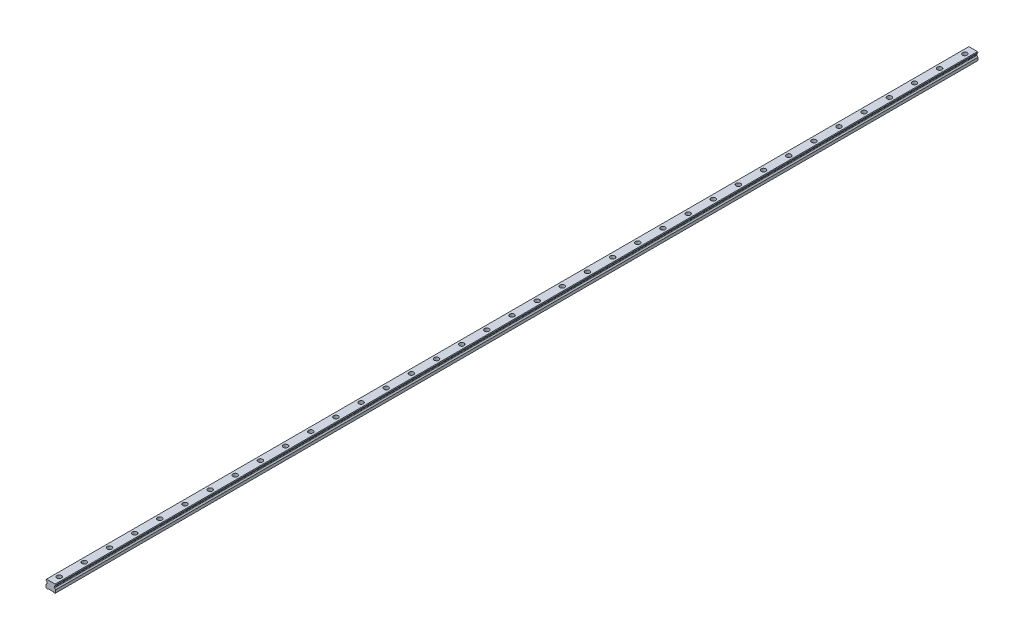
ISO-10303-21;
HEADER;
FILE_DESCRIPTION(('STEP AP214'),'2;1');
FILE_NAME('part.step','',(''),(''),'','','');
FILE_SCHEMA(('AUTOMOTIVE_DESIGN { 1 0 10303 214 1 1 1 1 }'));
ENDSEC;
DATA;
#1=APPLICATION_CONTEXT('core data for automotive mechanical design processes');
#2=APPLICATION_PROTOCOL_DEFINITION('international standard','automotive_design',2000,#1);
#3=PRODUCT_CONTEXT('',#1,'mechanical');
#4=PRODUCT('Part','Part','',(#3));
#5=PRODUCT_RELATED_PRODUCT_CATEGORY('part','',(#4));
#6=PRODUCT_DEFINITION_FORMATION('','',#4);
#7=PRODUCT_DEFINITION_CONTEXT('part definition',#1,'design');
#8=PRODUCT_DEFINITION('design','',#6,#7);
#9=PRODUCT_DEFINITION_SHAPE('','',#8);
#10=(LENGTH_UNIT() NAMED_UNIT(*) SI_UNIT(.MILLI.,.METRE.));
#11=(NAMED_UNIT(*) PLANE_ANGLE_UNIT() SI_UNIT($,.RADIAN.));
#12=(NAMED_UNIT(*) SI_UNIT($,.STERADIAN.) SOLID_ANGLE_UNIT());
#13=UNCERTAINTY_MEASURE_WITH_UNIT(LENGTH_MEASURE(1.E-05),#10,'distance_accuracy_value','');
#14=(GEOMETRIC_REPRESENTATION_CONTEXT(3) GLOBAL_UNCERTAINTY_ASSIGNED_CONTEXT((#13)) GLOBAL_UNIT_ASSIGNED_CONTEXT((#10,
#11,#12)) REPRESENTATION_CONTEXT('',''));
#15=CARTESIAN_POINT('',(0.,0.,0.));
#16=DIRECTION('',(0.,0.,1.));
#17=DIRECTION('',(1.,0.,0.));
#18=AXIS2_PLACEMENT_3D('',#15,#16,#17);
#19=CARTESIAN_POINT('',(0.,10.2,-1080.));
#20=DIRECTION('',(0.,1.,0.));
#21=DIRECTION('',(0.,0.,1.));
#22=AXIS2_PLACEMENT_3D('',#19,#20,#21);
#23=PLANE('',#22);
#24=CARTESIAN_POINT('',(0.,10.2,-1080.));
#25=DIRECTION('',(0.,1.,0.));
#26=DIRECTION('',(0.,0.,1.));
#27=AXIS2_PLACEMENT_3D('',#24,#25,#26);
#28=CIRCLE('',#27,3.49999999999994);
#29=CARTESIAN_POINT('',(0.,10.2,-1076.5));
#30=VERTEX_POINT('',#29);
#31=EDGE_CURVE('E638',#30,#30,#28,.T.);
#32=ORIENTED_EDGE('',*,*,#31,.F.);
#33=EDGE_LOOP('',(#32));
#34=FACE_BOUND('',#33,.T.);
#35=CARTESIAN_POINT('',(0.,10.2,-1080.));
#36=DIRECTION('',(0.,1.,0.));
#37=DIRECTION('',(0.,0.,1.));
#38=AXIS2_PLACEMENT_3D('',#35,#36,#37);
#39=CIRCLE('',#38,5.49999999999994);
#40=CARTESIAN_POINT('',(0.,10.2,-1074.5));
#41=VERTEX_POINT('',#40);
#42=EDGE_CURVE('E11',#41,#41,#39,.T.);
#43=ORIENTED_EDGE('',*,*,#42,.T.);
#44=EDGE_LOOP('',(#43));
#45=FACE_BOUND('',#44,.T.);
#46=ADVANCED_FACE('F39',(#34,#45),#23,.T.);
#47=CARTESIAN_POINT('',(0.,10.2,-1080.));
#48=DIRECTION('',(0.,1.,0.));
#49=DIRECTION('',(0.,0.,1.));
#50=AXIS2_PLACEMENT_3D('',#47,#48,#49);
#51=CYLINDRICAL_SURFACE('',#50,5.49999999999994);
#52=ORIENTED_EDGE('',*,*,#42,.F.);
#53=EDGE_LOOP('',(#52));
#54=FACE_BOUND('',#53,.T.);
#55=CARTESIAN_POINT('',(0.,19.2,-1080.));
#56=DIRECTION('',(0.,1.,0.));
#57=DIRECTION('',(0.,0.,1.));
#58=AXIS2_PLACEMENT_3D('',#55,#56,#57);
#59=CIRCLE('',#58,5.49999999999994);
#60=CARTESIAN_POINT('',(0.,19.2,-1074.5));
#61=VERTEX_POINT('',#60);
#62=EDGE_CURVE('E48',#61,#61,#59,.T.);
#63=ORIENTED_EDGE('',*,*,#62,.T.);
#64=EDGE_LOOP('',(#63));
#65=FACE_BOUND('',#64,.T.);
#66=ADVANCED_FACE('F1158',(#54,#65),#51,.F.);
#67=CARTESIAN_POINT('',(0.,10.2,-1020.));
#68=DIRECTION('',(0.,1.,0.));
#69=DIRECTION('',(0.,0.,1.));
#70=AXIS2_PLACEMENT_3D('',#67,#68,#69);
#71=PLANE('',#70);
#72=CARTESIAN_POINT('',(0.,10.2,-1020.));
#73=DIRECTION('',(0.,1.,0.));
#74=DIRECTION('',(0.,0.,1.));
#75=AXIS2_PLACEMENT_3D('',#72,#73,#74);
#76=CIRCLE('',#75,3.49999999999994);
#77=CARTESIAN_POINT('',(0.,10.2,-1016.5));
#78=VERTEX_POINT('',#77);
#79=EDGE_CURVE('E643',#78,#78,#76,.T.);
#80=ORIENTED_EDGE('',*,*,#79,.F.);
#81=EDGE_LOOP('',(#80));
#82=FACE_BOUND('',#81,.T.);
#83=CARTESIAN_POINT('',(0.,10.2,-1020.));
#84=DIRECTION('',(0.,1.,0.));
#85=DIRECTION('',(0.,0.,1.));
#86=AXIS2_PLACEMENT_3D('',#83,#84,#85);
#87=CIRCLE('',#86,5.49999999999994);
#88=CARTESIAN_POINT('',(0.,10.2,-1014.5));
#89=VERTEX_POINT('',#88);
#90=EDGE_CURVE('E622',#89,#89,#87,.T.);
#91=ORIENTED_EDGE('',*,*,#90,.T.);
#92=EDGE_LOOP('',(#91));
#93=FACE_BOUND('',#92,.T.);
#94=ADVANCED_FACE('F1160',(#82,#93),#71,.T.);
#95=CARTESIAN_POINT('',(0.,10.2,-1020.));
#96=DIRECTION('',(0.,1.,0.));
#97=DIRECTION('',(0.,0.,1.));
#98=AXIS2_PLACEMENT_3D('',#95,#96,#97);
#99=CYLINDRICAL_SURFACE('',#98,5.49999999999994);
#100=ORIENTED_EDGE('',*,*,#90,.F.);
#101=EDGE_LOOP('',(#100));
#102=FACE_BOUND('',#101,.T.);
#103=CARTESIAN_POINT('',(0.,19.2,-1020.));
#104=DIRECTION('',(0.,1.,0.));
#105=DIRECTION('',(0.,0.,1.));
#106=AXIS2_PLACEMENT_3D('',#103,#104,#105);
#107=CIRCLE('',#106,5.49999999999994);
#108=CARTESIAN_POINT('',(0.,19.2,-1014.5));
#109=VERTEX_POINT('',#108);
#110=EDGE_CURVE('E618',#109,#109,#107,.T.);
#111=ORIENTED_EDGE('',*,*,#110,.T.);
#112=EDGE_LOOP('',(#111));
#113=FACE_BOUND('',#112,.T.);
#114=ADVANCED_FACE('F1166',(#102,#113),#99,.F.);
#115=CARTESIAN_POINT('',(0.,10.2,-960.));
#116=DIRECTION('',(0.,1.,0.));
#117=DIRECTION('',(0.,0.,1.));
#118=AXIS2_PLACEMENT_3D('',#115,#116,#117);
#119=PLANE('',#118);
#120=CARTESIAN_POINT('',(0.,10.2,-960.));
#121=DIRECTION('',(0.,1.,0.));
#122=DIRECTION('',(0.,0.,1.));
#123=AXIS2_PLACEMENT_3D('',#120,#121,#122);
#124=CIRCLE('',#123,3.49999999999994);
#125=CARTESIAN_POINT('',(0.,10.2,-956.5));
#126=VERTEX_POINT('',#125);
#127=EDGE_CURVE('E648',#126,#126,#124,.T.);
#128=ORIENTED_EDGE('',*,*,#127,.F.);
#129=EDGE_LOOP('',(#128));
#130=FACE_BOUND('',#129,.T.);
#131=CARTESIAN_POINT('',(0.,10.2,-960.));
#132=DIRECTION('',(0.,1.,0.));
#133=DIRECTION('',(0.,0.,1.));
#134=AXIS2_PLACEMENT_3D('',#131,#132,#133);
#135=CIRCLE('',#134,5.49999999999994);
#136=CARTESIAN_POINT('',(0.,10.2,-954.5));
#137=VERTEX_POINT('',#136);
#138=EDGE_CURVE('E614',#137,#137,#135,.T.);
#139=ORIENTED_EDGE('',*,*,#138,.T.);
#140=EDGE_LOOP('',(#139));
#141=FACE_BOUND('',#140,.T.);
#142=ADVANCED_FACE('F1174',(#130,#141),#119,.T.);
#143=CARTESIAN_POINT('',(0.,10.2,-960.));
#144=DIRECTION('',(0.,1.,0.));
#145=DIRECTION('',(0.,0.,1.));
#146=AXIS2_PLACEMENT_3D('',#143,#144,#145);
#147=CYLINDRICAL_SURFACE('',#146,5.49999999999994);
#148=ORIENTED_EDGE('',*,*,#138,.F.);
#149=EDGE_LOOP('',(#148));
#150=FACE_BOUND('',#149,.T.);
#151=CARTESIAN_POINT('',(0.,19.2,-960.));
#152=DIRECTION('',(0.,1.,0.));
#153=DIRECTION('',(0.,0.,1.));
#154=AXIS2_PLACEMENT_3D('',#151,#152,#153);
#155=CIRCLE('',#154,5.49999999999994);
#156=CARTESIAN_POINT('',(0.,19.2,-954.5));
#157=VERTEX_POINT('',#156);
#158=EDGE_CURVE('E610',#157,#157,#155,.T.);
#159=ORIENTED_EDGE('',*,*,#158,.T.);
#160=EDGE_LOOP('',(#159));
#161=FACE_BOUND('',#160,.T.);
#162=ADVANCED_FACE('F1178',(#150,#161),#147,.F.);
#163=CARTESIAN_POINT('',(0.,10.2,-900.));
#164=DIRECTION('',(0.,1.,0.));
#165=DIRECTION('',(0.,0.,1.));
#166=AXIS2_PLACEMENT_3D('',#163,#164,#165);
#167=PLANE('',#166);
#168=CARTESIAN_POINT('',(0.,10.2,-900.));
#169=DIRECTION('',(0.,1.,0.));
#170=DIRECTION('',(0.,0.,1.));
#171=AXIS2_PLACEMENT_3D('',#168,#169,#170);
#172=CIRCLE('',#171,3.49999999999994);
#173=CARTESIAN_POINT('',(0.,10.2,-896.5));
#174=VERTEX_POINT('',#173);
#175=EDGE_CURVE('E653',#174,#174,#172,.T.);
#176=ORIENTED_EDGE('',*,*,#175,.F.);
#177=EDGE_LOOP('',(#176));
#178=FACE_BOUND('',#177,.T.);
#179=CARTESIAN_POINT('',(0.,10.2,-900.));
#180=DIRECTION('',(0.,1.,0.));
#181=DIRECTION('',(0.,0.,1.));
#182=AXIS2_PLACEMENT_3D('',#179,#180,#181);
#183=CIRCLE('',#182,5.49999999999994);
#184=CARTESIAN_POINT('',(0.,10.2,-894.5));
#185=VERTEX_POINT('',#184);
#186=EDGE_CURVE('E606',#185,#185,#183,.T.);
#187=ORIENTED_EDGE('',*,*,#186,.T.);
#188=EDGE_LOOP('',(#187));
#189=FACE_BOUND('',#188,.T.);
#190=ADVANCED_FACE('F1182',(#178,#189),#167,.T.);
#191=CARTESIAN_POINT('',(0.,10.2,-900.));
#192=DIRECTION('',(0.,1.,0.));
#193=DIRECTION('',(0.,0.,1.));
#194=AXIS2_PLACEMENT_3D('',#191,#192,#193);
#195=CYLINDRICAL_SURFACE('',#194,5.49999999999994);
#196=ORIENTED_EDGE('',*,*,#186,.F.);
#197=EDGE_LOOP('',(#196));
#198=FACE_BOUND('',#197,.T.);
#199=CARTESIAN_POINT('',(0.,19.2,-900.));
#200=DIRECTION('',(0.,1.,0.));
#201=DIRECTION('',(0.,0.,1.));
#202=AXIS2_PLACEMENT_3D('',#199,#200,#201);
#203=CIRCLE('',#202,5.49999999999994);
#204=CARTESIAN_POINT('',(0.,19.2,-894.5));
#205=VERTEX_POINT('',#204);
#206=EDGE_CURVE('E602',#205,#205,#203,.T.);
#207=ORIENTED_EDGE('',*,*,#206,.T.);
#208=EDGE_LOOP('',(#207));
#209=FACE_BOUND('',#208,.T.);
#210=ADVANCED_FACE('F1186',(#198,#209),#195,.F.);
#211=CARTESIAN_POINT('',(0.,10.2,-840.));
#212=DIRECTION('',(0.,1.,0.));
#213=DIRECTION('',(0.,0.,1.));
#214=AXIS2_PLACEMENT_3D('',#211,#212,#213);
#215=PLANE('',#214);
#216=CARTESIAN_POINT('',(0.,10.2,-840.));
#217=DIRECTION('',(0.,1.,0.));
#218=DIRECTION('',(0.,0.,1.));
#219=AXIS2_PLACEMENT_3D('',#216,#217,#218);
#220=CIRCLE('',#219,3.49999999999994);
#221=CARTESIAN_POINT('',(0.,10.2,-836.5));
#222=VERTEX_POINT('',#221);
#223=EDGE_CURVE('E658',#222,#222,#220,.T.);
#224=ORIENTED_EDGE('',*,*,#223,.F.);
#225=EDGE_LOOP('',(#224));
#226=FACE_BOUND('',#225,.T.);
#227=CARTESIAN_POINT('',(0.,10.2,-840.));
#228=DIRECTION('',(0.,1.,0.));
#229=DIRECTION('',(0.,0.,1.));
#230=AXIS2_PLACEMENT_3D('',#227,#228,#229);
#231=CIRCLE('',#230,5.49999999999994);
#232=CARTESIAN_POINT('',(0.,10.2,-834.5));
#233=VERTEX_POINT('',#232);
#234=EDGE_CURVE('E598',#233,#233,#231,.T.);
#235=ORIENTED_EDGE('',*,*,#234,.T.);
#236=EDGE_LOOP('',(#235));
#237=FACE_BOUND('',#236,.T.);
#238=ADVANCED_FACE('F1190',(#226,#237),#215,.T.);
#239=CARTESIAN_POINT('',(0.,10.2,-840.));
#240=DIRECTION('',(0.,1.,0.));
#241=DIRECTION('',(0.,0.,1.));
#242=AXIS2_PLACEMENT_3D('',#239,#240,#241);
#243=CYLINDRICAL_SURFACE('',#242,5.49999999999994);
#244=ORIENTED_EDGE('',*,*,#234,.F.);
#245=EDGE_LOOP('',(#244));
#246=FACE_BOUND('',#245,.T.);
#247=CARTESIAN_POINT('',(0.,19.2,-840.));
#248=DIRECTION('',(0.,1.,0.));
#249=DIRECTION('',(0.,0.,1.));
#250=AXIS2_PLACEMENT_3D('',#247,#248,#249);
#251=CIRCLE('',#250,5.49999999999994);
#252=CARTESIAN_POINT('',(0.,19.2,-834.5));
#253=VERTEX_POINT('',#252);
#254=EDGE_CURVE('E594',#253,#253,#251,.T.);
#255=ORIENTED_EDGE('',*,*,#254,.T.);
#256=EDGE_LOOP('',(#255));
#257=FACE_BOUND('',#256,.T.);
#258=ADVANCED_FACE('F1194',(#246,#257),#243,.F.);
#259=CARTESIAN_POINT('',(0.,10.2,-780.));
#260=DIRECTION('',(0.,1.,0.));
#261=DIRECTION('',(0.,0.,1.));
#262=AXIS2_PLACEMENT_3D('',#259,#260,#261);
#263=PLANE('',#262);
#264=CARTESIAN_POINT('',(0.,10.2,-780.));
#265=DIRECTION('',(0.,1.,0.));
#266=DIRECTION('',(0.,0.,1.));
#267=AXIS2_PLACEMENT_3D('',#264,#265,#266);
#268=CIRCLE('',#267,3.49999999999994);
#269=CARTESIAN_POINT('',(0.,10.2,-776.5));
#270=VERTEX_POINT('',#269);
#271=EDGE_CURVE('E663',#270,#270,#268,.T.);
#272=ORIENTED_EDGE('',*,*,#271,.F.);
#273=EDGE_LOOP('',(#272));
#274=FACE_BOUND('',#273,.T.);
#275=CARTESIAN_POINT('',(0.,10.2,-780.));
#276=DIRECTION('',(0.,1.,0.));
#277=DIRECTION('',(0.,0.,1.));
#278=AXIS2_PLACEMENT_3D('',#275,#276,#277);
#279=CIRCLE('',#278,5.49999999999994);
#280=CARTESIAN_POINT('',(0.,10.2,-774.5));
#281=VERTEX_POINT('',#280);
#282=EDGE_CURVE('E590',#281,#281,#279,.T.);
#283=ORIENTED_EDGE('',*,*,#282,.T.);
#284=EDGE_LOOP('',(#283));
#285=FACE_BOUND('',#284,.T.);
#286=ADVANCED_FACE('F1198',(#274,#285),#263,.T.);
#287=CARTESIAN_POINT('',(0.,10.2,-780.));
#288=DIRECTION('',(0.,1.,0.));
#289=DIRECTION('',(0.,0.,1.));
#290=AXIS2_PLACEMENT_3D('',#287,#288,#289);
#291=CYLINDRICAL_SURFACE('',#290,5.49999999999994);
#292=ORIENTED_EDGE('',*,*,#282,.F.);
#293=EDGE_LOOP('',(#292));
#294=FACE_BOUND('',#293,.T.);
#295=CARTESIAN_POINT('',(0.,19.2,-780.));
#296=DIRECTION('',(0.,1.,0.));
#297=DIRECTION('',(0.,0.,1.));
#298=AXIS2_PLACEMENT_3D('',#295,#296,#297);
#299=CIRCLE('',#298,5.49999999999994);
#300=CARTESIAN_POINT('',(0.,19.2,-774.5));
#301=VERTEX_POINT('',#300);
#302=EDGE_CURVE('E586',#301,#301,#299,.T.);
#303=ORIENTED_EDGE('',*,*,#302,.T.);
#304=EDGE_LOOP('',(#303));
#305=FACE_BOUND('',#304,.T.);
#306=ADVANCED_FACE('F1202',(#294,#305),#291,.F.);
#307=CARTESIAN_POINT('',(0.,10.2,-720.));
#308=DIRECTION('',(0.,1.,0.));
#309=DIRECTION('',(0.,0.,1.));
#310=AXIS2_PLACEMENT_3D('',#307,#308,#309);
#311=PLANE('',#310);
#312=CARTESIAN_POINT('',(0.,10.2,-720.));
#313=DIRECTION('',(0.,1.,0.));
#314=DIRECTION('',(0.,0.,1.));
#315=AXIS2_PLACEMENT_3D('',#312,#313,#314);
#316=CIRCLE('',#315,3.49999999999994);
#317=CARTESIAN_POINT('',(0.,10.2,-716.5));
#318=VERTEX_POINT('',#317);
#319=EDGE_CURVE('E668',#318,#318,#316,.T.);
#320=ORIENTED_EDGE('',*,*,#319,.F.);
#321=EDGE_LOOP('',(#320));
#322=FACE_BOUND('',#321,.T.);
#323=CARTESIAN_POINT('',(0.,10.2,-720.));
#324=DIRECTION('',(0.,1.,0.));
#325=DIRECTION('',(0.,0.,1.));
#326=AXIS2_PLACEMENT_3D('',#323,#324,#325);
#327=CIRCLE('',#326,5.49999999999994);
#328=CARTESIAN_POINT('',(0.,10.2,-714.5));
#329=VERTEX_POINT('',#328);
#330=EDGE_CURVE('E582',#329,#329,#327,.T.);
#331=ORIENTED_EDGE('',*,*,#330,.T.);
#332=EDGE_LOOP('',(#331));
#333=FACE_BOUND('',#332,.T.);
#334=ADVANCED_FACE('F1206',(#322,#333),#311,.T.);
#335=CARTESIAN_POINT('',(0.,10.2,-720.));
#336=DIRECTION('',(0.,1.,0.));
#337=DIRECTION('',(0.,0.,1.));
#338=AXIS2_PLACEMENT_3D('',#335,#336,#337);
#339=CYLINDRICAL_SURFACE('',#338,5.49999999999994);
#340=ORIENTED_EDGE('',*,*,#330,.F.);
#341=EDGE_LOOP('',(#340));
#342=FACE_BOUND('',#341,.T.);
#343=CARTESIAN_POINT('',(0.,19.2,-720.));
#344=DIRECTION('',(0.,1.,0.));
#345=DIRECTION('',(0.,0.,1.));
#346=AXIS2_PLACEMENT_3D('',#343,#344,#345);
#347=CIRCLE('',#346,5.49999999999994);
#348=CARTESIAN_POINT('',(0.,19.2,-714.5));
#349=VERTEX_POINT('',#348);
#350=EDGE_CURVE('E578',#349,#349,#347,.T.);
#351=ORIENTED_EDGE('',*,*,#350,.T.);
#352=EDGE_LOOP('',(#351));
#353=FACE_BOUND('',#352,.T.);
#354=ADVANCED_FACE('F1210',(#342,#353),#339,.F.);
#355=CARTESIAN_POINT('',(0.,10.2,-660.));
#356=DIRECTION('',(0.,1.,0.));
#357=DIRECTION('',(0.,0.,1.));
#358=AXIS2_PLACEMENT_3D('',#355,#356,#357);
#359=PLANE('',#358);
#360=CARTESIAN_POINT('',(0.,10.2,-660.));
#361=DIRECTION('',(0.,1.,0.));
#362=DIRECTION('',(0.,0.,1.));
#363=AXIS2_PLACEMENT_3D('',#360,#361,#362);
#364=CIRCLE('',#363,3.49999999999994);
#365=CARTESIAN_POINT('',(0.,10.2,-656.5));
#366=VERTEX_POINT('',#365);
#367=EDGE_CURVE('E673',#366,#366,#364,.T.);
#368=ORIENTED_EDGE('',*,*,#367,.F.);
#369=EDGE_LOOP('',(#368));
#370=FACE_BOUND('',#369,.T.);
#371=CARTESIAN_POINT('',(0.,10.2,-660.));
#372=DIRECTION('',(0.,1.,0.));
#373=DIRECTION('',(0.,0.,1.));
#374=AXIS2_PLACEMENT_3D('',#371,#372,#373);
#375=CIRCLE('',#374,5.49999999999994);
#376=CARTESIAN_POINT('',(0.,10.2,-654.5));
#377=VERTEX_POINT('',#376);
#378=EDGE_CURVE('E574',#377,#377,#375,.T.);
#379=ORIENTED_EDGE('',*,*,#378,.T.);
#380=EDGE_LOOP('',(#379));
#381=FACE_BOUND('',#380,.T.);
#382=ADVANCED_FACE('F1214',(#370,#381),#359,.T.);
#383=CARTESIAN_POINT('',(0.,10.2,-660.));
#384=DIRECTION('',(0.,1.,0.));
#385=DIRECTION('',(0.,0.,1.));
#386=AXIS2_PLACEMENT_3D('',#383,#384,#385);
#387=CYLINDRICAL_SURFACE('',#386,5.49999999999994);
#388=ORIENTED_EDGE('',*,*,#378,.F.);
#389=EDGE_LOOP('',(#388));
#390=FACE_BOUND('',#389,.T.);
#391=CARTESIAN_POINT('',(0.,19.2,-660.));
#392=DIRECTION('',(0.,1.,0.));
#393=DIRECTION('',(0.,0.,1.));
#394=AXIS2_PLACEMENT_3D('',#391,#392,#393);
#395=CIRCLE('',#394,5.49999999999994);
#396=CARTESIAN_POINT('',(0.,19.2,-654.5));
#397=VERTEX_POINT('',#396);
#398=EDGE_CURVE('E570',#397,#397,#395,.T.);
#399=ORIENTED_EDGE('',*,*,#398,.T.);
#400=EDGE_LOOP('',(#399));
#401=FACE_BOUND('',#400,.T.);
#402=ADVANCED_FACE('F1218',(#390,#401),#387,.F.);
#403=CARTESIAN_POINT('',(0.,10.2,-600.));
#404=DIRECTION('',(0.,1.,0.));
#405=DIRECTION('',(0.,0.,1.));
#406=AXIS2_PLACEMENT_3D('',#403,#404,#405);
#407=PLANE('',#406);
#408=CARTESIAN_POINT('',(0.,10.2,-600.));
#409=DIRECTION('',(0.,1.,0.));
#410=DIRECTION('',(0.,0.,1.));
#411=AXIS2_PLACEMENT_3D('',#408,#409,#410);
#412=CIRCLE('',#411,3.49999999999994);
#413=CARTESIAN_POINT('',(0.,10.2,-596.5));
#414=VERTEX_POINT('',#413);
#415=EDGE_CURVE('E678',#414,#414,#412,.T.);
#416=ORIENTED_EDGE('',*,*,#415,.F.);
#417=EDGE_LOOP('',(#416));
#418=FACE_BOUND('',#417,.T.);
#419=CARTESIAN_POINT('',(0.,10.2,-600.));
#420=DIRECTION('',(0.,1.,0.));
#421=DIRECTION('',(0.,0.,1.));
#422=AXIS2_PLACEMENT_3D('',#419,#420,#421);
#423=CIRCLE('',#422,5.49999999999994);
#424=CARTESIAN_POINT('',(0.,10.2,-594.5));
#425=VERTEX_POINT('',#424);
#426=EDGE_CURVE('E566',#425,#425,#423,.T.);
#427=ORIENTED_EDGE('',*,*,#426,.T.);
#428=EDGE_LOOP('',(#427));
#429=FACE_BOUND('',#428,.T.);
#430=ADVANCED_FACE('F1222',(#418,#429),#407,.T.);
#431=CARTESIAN_POINT('',(0.,10.2,-600.));
#432=DIRECTION('',(0.,1.,0.));
#433=DIRECTION('',(0.,0.,1.));
#434=AXIS2_PLACEMENT_3D('',#431,#432,#433);
#435=CYLINDRICAL_SURFACE('',#434,5.49999999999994);
#436=ORIENTED_EDGE('',*,*,#426,.F.);
#437=EDGE_LOOP('',(#436));
#438=FACE_BOUND('',#437,.T.);
#439=CARTESIAN_POINT('',(0.,19.2,-600.));
#440=DIRECTION('',(0.,1.,0.));
#441=DIRECTION('',(0.,0.,1.));
#442=AXIS2_PLACEMENT_3D('',#439,#440,#441);
#443=CIRCLE('',#442,5.49999999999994);
#444=CARTESIAN_POINT('',(0.,19.2,-594.5));
#445=VERTEX_POINT('',#444);
#446=EDGE_CURVE('E562',#445,#445,#443,.T.);
#447=ORIENTED_EDGE('',*,*,#446,.T.);
#448=EDGE_LOOP('',(#447));
#449=FACE_BOUND('',#448,.T.);
#450=ADVANCED_FACE('F1226',(#438,#449),#435,.F.);
#451=CARTESIAN_POINT('',(0.,10.2,-540.));
#452=DIRECTION('',(0.,1.,0.));
#453=DIRECTION('',(0.,0.,1.));
#454=AXIS2_PLACEMENT_3D('',#451,#452,#453);
#455=PLANE('',#454);
#456=CARTESIAN_POINT('',(0.,10.2,-540.));
#457=DIRECTION('',(0.,1.,0.));
#458=DIRECTION('',(0.,0.,1.));
#459=AXIS2_PLACEMENT_3D('',#456,#457,#458);
#460=CIRCLE('',#459,3.49999999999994);
#461=CARTESIAN_POINT('',(0.,10.2,-536.5));
#462=VERTEX_POINT('',#461);
#463=EDGE_CURVE('E683',#462,#462,#460,.T.);
#464=ORIENTED_EDGE('',*,*,#463,.F.);
#465=EDGE_LOOP('',(#464));
#466=FACE_BOUND('',#465,.T.);
#467=CARTESIAN_POINT('',(0.,10.2,-540.));
#468=DIRECTION('',(0.,1.,0.));
#469=DIRECTION('',(0.,0.,1.));
#470=AXIS2_PLACEMENT_3D('',#467,#468,#469);
#471=CIRCLE('',#470,5.49999999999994);
#472=CARTESIAN_POINT('',(0.,10.2,-534.5));
#473=VERTEX_POINT('',#472);
#474=EDGE_CURVE('E558',#473,#473,#471,.T.);
#475=ORIENTED_EDGE('',*,*,#474,.T.);
#476=EDGE_LOOP('',(#475));
#477=FACE_BOUND('',#476,.T.);
#478=ADVANCED_FACE('F1230',(#466,#477),#455,.T.);
#479=CARTESIAN_POINT('',(0.,10.2,-540.));
#480=DIRECTION('',(0.,1.,0.));
#481=DIRECTION('',(0.,0.,1.));
#482=AXIS2_PLACEMENT_3D('',#479,#480,#481);
#483=CYLINDRICAL_SURFACE('',#482,5.49999999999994);
#484=ORIENTED_EDGE('',*,*,#474,.F.);
#485=EDGE_LOOP('',(#484));
#486=FACE_BOUND('',#485,.T.);
#487=CARTESIAN_POINT('',(0.,19.2,-540.));
#488=DIRECTION('',(0.,1.,0.));
#489=DIRECTION('',(0.,0.,1.));
#490=AXIS2_PLACEMENT_3D('',#487,#488,#489);
#491=CIRCLE('',#490,5.49999999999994);
#492=CARTESIAN_POINT('',(0.,19.2,-534.5));
#493=VERTEX_POINT('',#492);
#494=EDGE_CURVE('E554',#493,#493,#491,.T.);
#495=ORIENTED_EDGE('',*,*,#494,.T.);
#496=EDGE_LOOP('',(#495));
#497=FACE_BOUND('',#496,.T.);
#498=ADVANCED_FACE('F1234',(#486,#497),#483,.F.);
#499=CARTESIAN_POINT('',(0.,10.2,-480.));
#500=DIRECTION('',(0.,1.,0.));
#501=DIRECTION('',(0.,0.,1.));
#502=AXIS2_PLACEMENT_3D('',#499,#500,#501);
#503=PLANE('',#502);
#504=CARTESIAN_POINT('',(0.,10.2,-480.));
#505=DIRECTION('',(0.,1.,0.));
#506=DIRECTION('',(0.,0.,1.));
#507=AXIS2_PLACEMENT_3D('',#504,#505,#506);
#508=CIRCLE('',#507,3.49999999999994);
#509=CARTESIAN_POINT('',(0.,10.2,-476.5));
#510=VERTEX_POINT('',#509);
#511=EDGE_CURVE('E688',#510,#510,#508,.T.);
#512=ORIENTED_EDGE('',*,*,#511,.F.);
#513=EDGE_LOOP('',(#512));
#514=FACE_BOUND('',#513,.T.);
#515=CARTESIAN_POINT('',(0.,10.2,-480.));
#516=DIRECTION('',(0.,1.,0.));
#517=DIRECTION('',(0.,0.,1.));
#518=AXIS2_PLACEMENT_3D('',#515,#516,#517);
#519=CIRCLE('',#518,5.49999999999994);
#520=CARTESIAN_POINT('',(0.,10.2,-474.5));
#521=VERTEX_POINT('',#520);
#522=EDGE_CURVE('E550',#521,#521,#519,.T.);
#523=ORIENTED_EDGE('',*,*,#522,.T.);
#524=EDGE_LOOP('',(#523));
#525=FACE_BOUND('',#524,.T.);
#526=ADVANCED_FACE('F1238',(#514,#525),#503,.T.);
#527=CARTESIAN_POINT('',(0.,10.2,-480.));
#528=DIRECTION('',(0.,1.,0.));
#529=DIRECTION('',(0.,0.,1.));
#530=AXIS2_PLACEMENT_3D('',#527,#528,#529);
#531=CYLINDRICAL_SURFACE('',#530,5.49999999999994);
#532=ORIENTED_EDGE('',*,*,#522,.F.);
#533=EDGE_LOOP('',(#532));
#534=FACE_BOUND('',#533,.T.);
#535=CARTESIAN_POINT('',(0.,19.2,-480.));
#536=DIRECTION('',(0.,1.,0.));
#537=DIRECTION('',(0.,0.,1.));
#538=AXIS2_PLACEMENT_3D('',#535,#536,#537);
#539=CIRCLE('',#538,5.49999999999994);
#540=CARTESIAN_POINT('',(0.,19.2,-474.5));
#541=VERTEX_POINT('',#540);
#542=EDGE_CURVE('E546',#541,#541,#539,.T.);
#543=ORIENTED_EDGE('',*,*,#542,.T.);
#544=EDGE_LOOP('',(#543));
#545=FACE_BOUND('',#544,.T.);
#546=ADVANCED_FACE('F1242',(#534,#545),#531,.F.);
#547=CARTESIAN_POINT('',(0.,10.2,-420.));
#548=DIRECTION('',(0.,1.,0.));
#549=DIRECTION('',(0.,0.,1.));
#550=AXIS2_PLACEMENT_3D('',#547,#548,#549);
#551=PLANE('',#550);
#552=CARTESIAN_POINT('',(0.,10.2,-420.));
#553=DIRECTION('',(0.,1.,0.));
#554=DIRECTION('',(0.,0.,1.));
#555=AXIS2_PLACEMENT_3D('',#552,#553,#554);
#556=CIRCLE('',#555,3.49999999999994);
#557=CARTESIAN_POINT('',(0.,10.2,-416.5));
#558=VERTEX_POINT('',#557);
#559=EDGE_CURVE('E693',#558,#558,#556,.T.);
#560=ORIENTED_EDGE('',*,*,#559,.F.);
#561=EDGE_LOOP('',(#560));
#562=FACE_BOUND('',#561,.T.);
#563=CARTESIAN_POINT('',(0.,10.2,-420.));
#564=DIRECTION('',(0.,1.,0.));
#565=DIRECTION('',(0.,0.,1.));
#566=AXIS2_PLACEMENT_3D('',#563,#564,#565);
#567=CIRCLE('',#566,5.49999999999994);
#568=CARTESIAN_POINT('',(0.,10.2,-414.5));
#569=VERTEX_POINT('',#568);
#570=EDGE_CURVE('E542',#569,#569,#567,.T.);
#571=ORIENTED_EDGE('',*,*,#570,.T.);
#572=EDGE_LOOP('',(#571));
#573=FACE_BOUND('',#572,.T.);
#574=ADVANCED_FACE('F1246',(#562,#573),#551,.T.);
#575=CARTESIAN_POINT('',(0.,10.2,-420.));
#576=DIRECTION('',(0.,1.,0.));
#577=DIRECTION('',(0.,0.,1.));
#578=AXIS2_PLACEMENT_3D('',#575,#576,#577);
#579=CYLINDRICAL_SURFACE('',#578,5.49999999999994);
#580=ORIENTED_EDGE('',*,*,#570,.F.);
#581=EDGE_LOOP('',(#580));
#582=FACE_BOUND('',#581,.T.);
#583=CARTESIAN_POINT('',(0.,19.2,-420.));
#584=DIRECTION('',(0.,1.,0.));
#585=DIRECTION('',(0.,0.,1.));
#586=AXIS2_PLACEMENT_3D('',#583,#584,#585);
#587=CIRCLE('',#586,5.49999999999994);
#588=CARTESIAN_POINT('',(0.,19.2,-414.5));
#589=VERTEX_POINT('',#588);
#590=EDGE_CURVE('E538',#589,#589,#587,.T.);
#591=ORIENTED_EDGE('',*,*,#590,.T.);
#592=EDGE_LOOP('',(#591));
#593=FACE_BOUND('',#592,.T.);
#594=ADVANCED_FACE('F1250',(#582,#593),#579,.F.);
#595=CARTESIAN_POINT('',(0.,10.2,-360.));
#596=DIRECTION('',(0.,1.,0.));
#597=DIRECTION('',(0.,0.,1.));
#598=AXIS2_PLACEMENT_3D('',#595,#596,#597);
#599=PLANE('',#598);
#600=CARTESIAN_POINT('',(0.,10.2,-360.));
#601=DIRECTION('',(0.,1.,0.));
#602=DIRECTION('',(0.,0.,1.));
#603=AXIS2_PLACEMENT_3D('',#600,#601,#602);
#604=CIRCLE('',#603,3.49999999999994);
#605=CARTESIAN_POINT('',(0.,10.2,-356.5));
#606=VERTEX_POINT('',#605);
#607=EDGE_CURVE('E698',#606,#606,#604,.T.);
#608=ORIENTED_EDGE('',*,*,#607,.F.);
#609=EDGE_LOOP('',(#608));
#610=FACE_BOUND('',#609,.T.);
#611=CARTESIAN_POINT('',(0.,10.2,-360.));
#612=DIRECTION('',(0.,1.,0.));
#613=DIRECTION('',(0.,0.,1.));
#614=AXIS2_PLACEMENT_3D('',#611,#612,#613);
#615=CIRCLE('',#614,5.49999999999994);
#616=CARTESIAN_POINT('',(0.,10.2,-354.5));
#617=VERTEX_POINT('',#616);
#618=EDGE_CURVE('E534',#617,#617,#615,.T.);
#619=ORIENTED_EDGE('',*,*,#618,.T.);
#620=EDGE_LOOP('',(#619));
#621=FACE_BOUND('',#620,.T.);
#622=ADVANCED_FACE('F1254',(#610,#621),#599,.T.);
#623=CARTESIAN_POINT('',(0.,10.2,-360.));
#624=DIRECTION('',(0.,1.,0.));
#625=DIRECTION('',(0.,0.,1.));
#626=AXIS2_PLACEMENT_3D('',#623,#624,#625);
#627=CYLINDRICAL_SURFACE('',#626,5.49999999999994);
#628=ORIENTED_EDGE('',*,*,#618,.F.);
#629=EDGE_LOOP('',(#628));
#630=FACE_BOUND('',#629,.T.);
#631=CARTESIAN_POINT('',(0.,19.2,-360.));
#632=DIRECTION('',(0.,1.,0.));
#633=DIRECTION('',(0.,0.,1.));
#634=AXIS2_PLACEMENT_3D('',#631,#632,#633);
#635=CIRCLE('',#634,5.49999999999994);
#636=CARTESIAN_POINT('',(0.,19.2,-354.5));
#637=VERTEX_POINT('',#636);
#638=EDGE_CURVE('E530',#637,#637,#635,.T.);
#639=ORIENTED_EDGE('',*,*,#638,.T.);
#640=EDGE_LOOP('',(#639));
#641=FACE_BOUND('',#640,.T.);
#642=ADVANCED_FACE('F1258',(#630,#641),#627,.F.);
#643=CARTESIAN_POINT('',(0.,10.2,-300.));
#644=DIRECTION('',(0.,1.,0.));
#645=DIRECTION('',(0.,0.,1.));
#646=AXIS2_PLACEMENT_3D('',#643,#644,#645);
#647=PLANE('',#646);
#648=CARTESIAN_POINT('',(0.,10.2,-300.));
#649=DIRECTION('',(0.,1.,0.));
#650=DIRECTION('',(0.,0.,1.));
#651=AXIS2_PLACEMENT_3D('',#648,#649,#650);
#652=CIRCLE('',#651,3.49999999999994);
#653=CARTESIAN_POINT('',(0.,10.2,-296.5));
#654=VERTEX_POINT('',#653);
#655=EDGE_CURVE('E703',#654,#654,#652,.T.);
#656=ORIENTED_EDGE('',*,*,#655,.F.);
#657=EDGE_LOOP('',(#656));
#658=FACE_BOUND('',#657,.T.);
#659=CARTESIAN_POINT('',(0.,10.2,-300.));
#660=DIRECTION('',(0.,1.,0.));
#661=DIRECTION('',(0.,0.,1.));
#662=AXIS2_PLACEMENT_3D('',#659,#660,#661);
#663=CIRCLE('',#662,5.49999999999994);
#664=CARTESIAN_POINT('',(0.,10.2,-294.5));
#665=VERTEX_POINT('',#664);
#666=EDGE_CURVE('E526',#665,#665,#663,.T.);
#667=ORIENTED_EDGE('',*,*,#666,.T.);
#668=EDGE_LOOP('',(#667));
#669=FACE_BOUND('',#668,.T.);
#670=ADVANCED_FACE('F1262',(#658,#669),#647,.T.);
#671=CARTESIAN_POINT('',(0.,10.2,-300.));
#672=DIRECTION('',(0.,1.,0.));
#673=DIRECTION('',(0.,0.,1.));
#674=AXIS2_PLACEMENT_3D('',#671,#672,#673);
#675=CYLINDRICAL_SURFACE('',#674,5.49999999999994);
#676=ORIENTED_EDGE('',*,*,#666,.F.);
#677=EDGE_LOOP('',(#676));
#678=FACE_BOUND('',#677,.T.);
#679=CARTESIAN_POINT('',(0.,19.2,-300.));
#680=DIRECTION('',(0.,1.,0.));
#681=DIRECTION('',(0.,0.,1.));
#682=AXIS2_PLACEMENT_3D('',#679,#680,#681);
#683=CIRCLE('',#682,5.49999999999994);
#684=CARTESIAN_POINT('',(0.,19.2,-294.5));
#685=VERTEX_POINT('',#684);
#686=EDGE_CURVE('E522',#685,#685,#683,.T.);
#687=ORIENTED_EDGE('',*,*,#686,.T.);
#688=EDGE_LOOP('',(#687));
#689=FACE_BOUND('',#688,.T.);
#690=ADVANCED_FACE('F1266',(#678,#689),#675,.F.);
#691=CARTESIAN_POINT('',(0.,10.2,-240.));
#692=DIRECTION('',(0.,1.,0.));
#693=DIRECTION('',(0.,0.,1.));
#694=AXIS2_PLACEMENT_3D('',#691,#692,#693);
#695=PLANE('',#694);
#696=CARTESIAN_POINT('',(0.,10.2,-240.));
#697=DIRECTION('',(0.,1.,0.));
#698=DIRECTION('',(0.,0.,1.));
#699=AXIS2_PLACEMENT_3D('',#696,#697,#698);
#700=CIRCLE('',#699,3.49999999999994);
#701=CARTESIAN_POINT('',(0.,10.2,-236.5));
#702=VERTEX_POINT('',#701);
#703=EDGE_CURVE('E708',#702,#702,#700,.T.);
#704=ORIENTED_EDGE('',*,*,#703,.F.);
#705=EDGE_LOOP('',(#704));
#706=FACE_BOUND('',#705,.T.);
#707=CARTESIAN_POINT('',(0.,10.2,-240.));
#708=DIRECTION('',(0.,1.,0.));
#709=DIRECTION('',(0.,0.,1.));
#710=AXIS2_PLACEMENT_3D('',#707,#708,#709);
#711=CIRCLE('',#710,5.49999999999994);
#712=CARTESIAN_POINT('',(0.,10.2,-234.5));
#713=VERTEX_POINT('',#712);
#714=EDGE_CURVE('E518',#713,#713,#711,.T.);
#715=ORIENTED_EDGE('',*,*,#714,.T.);
#716=EDGE_LOOP('',(#715));
#717=FACE_BOUND('',#716,.T.);
#718=ADVANCED_FACE('F1270',(#706,#717),#695,.T.);
#719=CARTESIAN_POINT('',(0.,10.2,-240.));
#720=DIRECTION('',(0.,1.,0.));
#721=DIRECTION('',(0.,0.,1.));
#722=AXIS2_PLACEMENT_3D('',#719,#720,#721);
#723=CYLINDRICAL_SURFACE('',#722,5.49999999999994);
#724=ORIENTED_EDGE('',*,*,#714,.F.);
#725=EDGE_LOOP('',(#724));
#726=FACE_BOUND('',#725,.T.);
#727=CARTESIAN_POINT('',(0.,19.2,-240.));
#728=DIRECTION('',(0.,1.,0.));
#729=DIRECTION('',(0.,0.,1.));
#730=AXIS2_PLACEMENT_3D('',#727,#728,#729);
#731=CIRCLE('',#730,5.49999999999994);
#732=CARTESIAN_POINT('',(0.,19.2,-234.5));
#733=VERTEX_POINT('',#732);
#734=EDGE_CURVE('E514',#733,#733,#731,.T.);
#735=ORIENTED_EDGE('',*,*,#734,.T.);
#736=EDGE_LOOP('',(#735));
#737=FACE_BOUND('',#736,.T.);
#738=ADVANCED_FACE('F1274',(#726,#737),#723,.F.);
#739=CARTESIAN_POINT('',(0.,10.2,-180.));
#740=DIRECTION('',(0.,1.,0.));
#741=DIRECTION('',(0.,0.,1.));
#742=AXIS2_PLACEMENT_3D('',#739,#740,#741);
#743=PLANE('',#742);
#744=CARTESIAN_POINT('',(0.,10.2,-180.));
#745=DIRECTION('',(0.,1.,0.));
#746=DIRECTION('',(0.,0.,1.));
#747=AXIS2_PLACEMENT_3D('',#744,#745,#746);
#748=CIRCLE('',#747,3.49999999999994);
#749=CARTESIAN_POINT('',(0.,10.2,-176.5));
#750=VERTEX_POINT('',#749);
#751=EDGE_CURVE('E713',#750,#750,#748,.T.);
#752=ORIENTED_EDGE('',*,*,#751,.F.);
#753=EDGE_LOOP('',(#752));
#754=FACE_BOUND('',#753,.T.);
#755=CARTESIAN_POINT('',(0.,10.2,-180.));
#756=DIRECTION('',(0.,1.,0.));
#757=DIRECTION('',(0.,0.,1.));
#758=AXIS2_PLACEMENT_3D('',#755,#756,#757);
#759=CIRCLE('',#758,5.49999999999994);
#760=CARTESIAN_POINT('',(0.,10.2,-174.5));
#761=VERTEX_POINT('',#760);
#762=EDGE_CURVE('E510',#761,#761,#759,.T.);
#763=ORIENTED_EDGE('',*,*,#762,.T.);
#764=EDGE_LOOP('',(#763));
#765=FACE_BOUND('',#764,.T.);
#766=ADVANCED_FACE('F1278',(#754,#765),#743,.T.);
#767=CARTESIAN_POINT('',(0.,10.2,-180.));
#768=DIRECTION('',(0.,1.,0.));
#769=DIRECTION('',(0.,0.,1.));
#770=AXIS2_PLACEMENT_3D('',#767,#768,#769);
#771=CYLINDRICAL_SURFACE('',#770,5.49999999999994);
#772=ORIENTED_EDGE('',*,*,#762,.F.);
#773=EDGE_LOOP('',(#772));
#774=FACE_BOUND('',#773,.T.);
#775=CARTESIAN_POINT('',(0.,19.2,-180.));
#776=DIRECTION('',(0.,1.,0.));
#777=DIRECTION('',(0.,0.,1.));
#778=AXIS2_PLACEMENT_3D('',#775,#776,#777);
#779=CIRCLE('',#778,5.49999999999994);
#780=CARTESIAN_POINT('',(0.,19.2,-174.5));
#781=VERTEX_POINT('',#780);
#782=EDGE_CURVE('E506',#781,#781,#779,.T.);
#783=ORIENTED_EDGE('',*,*,#782,.T.);
#784=EDGE_LOOP('',(#783));
#785=FACE_BOUND('',#784,.T.);
#786=ADVANCED_FACE('F1282',(#774,#785),#771,.F.);
#787=CARTESIAN_POINT('',(0.,10.2,-120.));
#788=DIRECTION('',(0.,1.,0.));
#789=DIRECTION('',(0.,0.,1.));
#790=AXIS2_PLACEMENT_3D('',#787,#788,#789);
#791=PLANE('',#790);
#792=CARTESIAN_POINT('',(0.,10.2,-120.));
#793=DIRECTION('',(0.,1.,0.));
#794=DIRECTION('',(0.,0.,1.));
#795=AXIS2_PLACEMENT_3D('',#792,#793,#794);
#796=CIRCLE('',#795,3.49999999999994);
#797=CARTESIAN_POINT('',(0.,10.2,-116.5));
#798=VERTEX_POINT('',#797);
#799=EDGE_CURVE('E718',#798,#798,#796,.T.);
#800=ORIENTED_EDGE('',*,*,#799,.F.);
#801=EDGE_LOOP('',(#800));
#802=FACE_BOUND('',#801,.T.);
#803=CARTESIAN_POINT('',(0.,10.2,-120.));
#804=DIRECTION('',(0.,1.,0.));
#805=DIRECTION('',(0.,0.,1.));
#806=AXIS2_PLACEMENT_3D('',#803,#804,#805);
#807=CIRCLE('',#806,5.49999999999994);
#808=CARTESIAN_POINT('',(0.,10.2,-114.5));
#809=VERTEX_POINT('',#808);
#810=EDGE_CURVE('E502',#809,#809,#807,.T.);
#811=ORIENTED_EDGE('',*,*,#810,.T.);
#812=EDGE_LOOP('',(#811));
#813=FACE_BOUND('',#812,.T.);
#814=ADVANCED_FACE('F1286',(#802,#813),#791,.T.);
#815=CARTESIAN_POINT('',(0.,10.2,-120.));
#816=DIRECTION('',(0.,1.,0.));
#817=DIRECTION('',(0.,0.,1.));
#818=AXIS2_PLACEMENT_3D('',#815,#816,#817);
#819=CYLINDRICAL_SURFACE('',#818,5.49999999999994);
#820=ORIENTED_EDGE('',*,*,#810,.F.);
#821=EDGE_LOOP('',(#820));
#822=FACE_BOUND('',#821,.T.);
#823=CARTESIAN_POINT('',(0.,19.2,-120.));
#824=DIRECTION('',(0.,1.,0.));
#825=DIRECTION('',(0.,0.,1.));
#826=AXIS2_PLACEMENT_3D('',#823,#824,#825);
#827=CIRCLE('',#826,5.49999999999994);
#828=CARTESIAN_POINT('',(0.,19.2,-114.5));
#829=VERTEX_POINT('',#828);
#830=EDGE_CURVE('E498',#829,#829,#827,.T.);
#831=ORIENTED_EDGE('',*,*,#830,.T.);
#832=EDGE_LOOP('',(#831));
#833=FACE_BOUND('',#832,.T.);
#834=ADVANCED_FACE('F1290',(#822,#833),#819,.F.);
#835=CARTESIAN_POINT('',(0.,10.2,-59.9999999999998));
#836=DIRECTION('',(0.,1.,0.));
#837=DIRECTION('',(0.,0.,1.));
#838=AXIS2_PLACEMENT_3D('',#835,#836,#837);
#839=PLANE('',#838);
#840=CARTESIAN_POINT('',(0.,10.2,-59.9999999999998));
#841=DIRECTION('',(0.,1.,0.));
#842=DIRECTION('',(0.,0.,1.));
#843=AXIS2_PLACEMENT_3D('',#840,#841,#842);
#844=CIRCLE('',#843,3.49999999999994);
#845=CARTESIAN_POINT('',(0.,10.2,-56.4999999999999));
#846=VERTEX_POINT('',#845);
#847=EDGE_CURVE('E723',#846,#846,#844,.T.);
#848=ORIENTED_EDGE('',*,*,#847,.F.);
#849=EDGE_LOOP('',(#848));
#850=FACE_BOUND('',#849,.T.);
#851=CARTESIAN_POINT('',(0.,10.2,-59.9999999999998));
#852=DIRECTION('',(0.,1.,0.));
#853=DIRECTION('',(0.,0.,1.));
#854=AXIS2_PLACEMENT_3D('',#851,#852,#853);
#855=CIRCLE('',#854,5.49999999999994);
#856=CARTESIAN_POINT('',(0.,10.2,-54.4999999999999));
#857=VERTEX_POINT('',#856);
#858=EDGE_CURVE('E494',#857,#857,#855,.T.);
#859=ORIENTED_EDGE('',*,*,#858,.T.);
#860=EDGE_LOOP('',(#859));
#861=FACE_BOUND('',#860,.T.);
#862=ADVANCED_FACE('F1294',(#850,#861),#839,.T.);
#863=CARTESIAN_POINT('',(0.,10.2,-59.9999999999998));
#864=DIRECTION('',(0.,1.,0.));
#865=DIRECTION('',(0.,0.,1.));
#866=AXIS2_PLACEMENT_3D('',#863,#864,#865);
#867=CYLINDRICAL_SURFACE('',#866,5.49999999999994);
#868=ORIENTED_EDGE('',*,*,#858,.F.);
#869=EDGE_LOOP('',(#868));
#870=FACE_BOUND('',#869,.T.);
#871=CARTESIAN_POINT('',(0.,19.2,-59.9999999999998));
#872=DIRECTION('',(0.,1.,0.));
#873=DIRECTION('',(0.,0.,1.));
#874=AXIS2_PLACEMENT_3D('',#871,#872,#873);
#875=CIRCLE('',#874,5.49999999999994);
#876=CARTESIAN_POINT('',(0.,19.2,-54.4999999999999));
#877=VERTEX_POINT('',#876);
#878=EDGE_CURVE('E490',#877,#877,#875,.T.);
#879=ORIENTED_EDGE('',*,*,#878,.T.);
#880=EDGE_LOOP('',(#879));
#881=FACE_BOUND('',#880,.T.);
#882=ADVANCED_FACE('F1298',(#870,#881),#867,.F.);
#883=CARTESIAN_POINT('',(0.,10.2,0.));
#884=DIRECTION('',(0.,1.,0.));
#885=DIRECTION('',(0.,0.,1.));
#886=AXIS2_PLACEMENT_3D('',#883,#884,#885);
#887=PLANE('',#886);
#888=CARTESIAN_POINT('',(0.,10.2,0.));
#889=DIRECTION('',(0.,1.,0.));
#890=DIRECTION('',(0.,0.,1.));
#891=AXIS2_PLACEMENT_3D('',#888,#889,#890);
#892=CIRCLE('',#891,3.49999999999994);
#893=CARTESIAN_POINT('',(0.,10.2,3.49999999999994));
#894=VERTEX_POINT('',#893);
#895=EDGE_CURVE('E728',#894,#894,#892,.T.);
#896=ORIENTED_EDGE('',*,*,#895,.F.);
#897=EDGE_LOOP('',(#896));
#898=FACE_BOUND('',#897,.T.);
#899=CARTESIAN_POINT('',(0.,10.2,0.));
#900=DIRECTION('',(0.,1.,0.));
#901=DIRECTION('',(0.,0.,1.));
#902=AXIS2_PLACEMENT_3D('',#899,#900,#901);
#903=CIRCLE('',#902,5.49999999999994);
#904=CARTESIAN_POINT('',(0.,10.2,5.49999999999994));
#905=VERTEX_POINT('',#904);
#906=EDGE_CURVE('E486',#905,#905,#903,.T.);
#907=ORIENTED_EDGE('',*,*,#906,.T.);
#908=EDGE_LOOP('',(#907));
#909=FACE_BOUND('',#908,.T.);
#910=ADVANCED_FACE('F1302',(#898,#909),#887,.T.);
#911=CARTESIAN_POINT('',(0.,10.2,0.));
#912=DIRECTION('',(0.,1.,0.));
#913=DIRECTION('',(0.,0.,1.));
#914=AXIS2_PLACEMENT_3D('',#911,#912,#913);
#915=CYLINDRICAL_SURFACE('',#914,5.49999999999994);
#916=ORIENTED_EDGE('',*,*,#906,.F.);
#917=EDGE_LOOP('',(#916));
#918=FACE_BOUND('',#917,.T.);
#919=CARTESIAN_POINT('',(0.,19.2,0.));
#920=DIRECTION('',(0.,1.,0.));
#921=DIRECTION('',(0.,0.,1.));
#922=AXIS2_PLACEMENT_3D('',#919,#920,#921);
#923=CIRCLE('',#922,5.49999999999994);
#924=CARTESIAN_POINT('',(0.,19.2,5.49999999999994));
#925=VERTEX_POINT('',#924);
#926=EDGE_CURVE('E482',#925,#925,#923,.T.);
#927=ORIENTED_EDGE('',*,*,#926,.T.);
#928=EDGE_LOOP('',(#927));
#929=FACE_BOUND('',#928,.T.);
#930=ADVANCED_FACE('F1306',(#918,#929),#915,.F.);
#931=CARTESIAN_POINT('',(0.,10.2,60.0000000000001));
#932=DIRECTION('',(0.,1.,0.));
#933=DIRECTION('',(0.,0.,1.));
#934=AXIS2_PLACEMENT_3D('',#931,#932,#933);
#935=PLANE('',#934);
#936=CARTESIAN_POINT('',(0.,10.2,60.0000000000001));
#937=DIRECTION('',(0.,1.,0.));
#938=DIRECTION('',(0.,0.,1.));
#939=AXIS2_PLACEMENT_3D('',#936,#937,#938);
#940=CIRCLE('',#939,3.49999999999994);
#941=CARTESIAN_POINT('',(0.,10.2,63.5));
#942=VERTEX_POINT('',#941);
#943=EDGE_CURVE('E733',#942,#942,#940,.T.);
#944=ORIENTED_EDGE('',*,*,#943,.F.);
#945=EDGE_LOOP('',(#944));
#946=FACE_BOUND('',#945,.T.);
#947=CARTESIAN_POINT('',(0.,10.2,60.0000000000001));
#948=DIRECTION('',(0.,1.,0.));
#949=DIRECTION('',(0.,0.,1.));
#950=AXIS2_PLACEMENT_3D('',#947,#948,#949);
#951=CIRCLE('',#950,5.49999999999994);
#952=CARTESIAN_POINT('',(0.,10.2,65.5));
#953=VERTEX_POINT('',#952);
#954=EDGE_CURVE('E478',#953,#953,#951,.T.);
#955=ORIENTED_EDGE('',*,*,#954,.T.);
#956=EDGE_LOOP('',(#955));
#957=FACE_BOUND('',#956,.T.);
#958=ADVANCED_FACE('F1310',(#946,#957),#935,.T.);
#959=CARTESIAN_POINT('',(0.,10.2,60.0000000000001));
#960=DIRECTION('',(0.,1.,0.));
#961=DIRECTION('',(0.,0.,1.));
#962=AXIS2_PLACEMENT_3D('',#959,#960,#961);
#963=CYLINDRICAL_SURFACE('',#962,5.49999999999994);
#964=ORIENTED_EDGE('',*,*,#954,.F.);
#965=EDGE_LOOP('',(#964));
#966=FACE_BOUND('',#965,.T.);
#967=CARTESIAN_POINT('',(0.,19.2,60.0000000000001));
#968=DIRECTION('',(0.,1.,0.));
#969=DIRECTION('',(0.,0.,1.));
#970=AXIS2_PLACEMENT_3D('',#967,#968,#969);
#971=CIRCLE('',#970,5.49999999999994);
#972=CARTESIAN_POINT('',(0.,19.2,65.5));
#973=VERTEX_POINT('',#972);
#974=EDGE_CURVE('E474',#973,#973,#971,.T.);
#975=ORIENTED_EDGE('',*,*,#974,.T.);
#976=EDGE_LOOP('',(#975));
#977=FACE_BOUND('',#976,.T.);
#978=ADVANCED_FACE('F1314',(#966,#977),#963,.F.);
#979=CARTESIAN_POINT('',(0.,10.2,120.));
#980=DIRECTION('',(0.,1.,0.));
#981=DIRECTION('',(0.,0.,1.));
#982=AXIS2_PLACEMENT_3D('',#979,#980,#981);
#983=PLANE('',#982);
#984=CARTESIAN_POINT('',(0.,10.2,120.));
#985=DIRECTION('',(0.,1.,0.));
#986=DIRECTION('',(0.,0.,1.));
#987=AXIS2_PLACEMENT_3D('',#984,#985,#986);
#988=CIRCLE('',#987,3.49999999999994);
#989=CARTESIAN_POINT('',(0.,10.2,123.5));
#990=VERTEX_POINT('',#989);
#991=EDGE_CURVE('E738',#990,#990,#988,.T.);
#992=ORIENTED_EDGE('',*,*,#991,.F.);
#993=EDGE_LOOP('',(#992));
#994=FACE_BOUND('',#993,.T.);
#995=CARTESIAN_POINT('',(0.,10.2,120.));
#996=DIRECTION('',(0.,1.,0.));
#997=DIRECTION('',(0.,0.,1.));
#998=AXIS2_PLACEMENT_3D('',#995,#996,#997);
#999=CIRCLE('',#998,5.49999999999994);
#1000=CARTESIAN_POINT('',(0.,10.2,125.5));
#1001=VERTEX_POINT('',#1000);
#1002=EDGE_CURVE('E470',#1001,#1001,#999,.T.);
#1003=ORIENTED_EDGE('',*,*,#1002,.T.);
#1004=EDGE_LOOP('',(#1003));
#1005=FACE_BOUND('',#1004,.T.);
#1006=ADVANCED_FACE('F1318',(#994,#1005),#983,.T.);
#1007=CARTESIAN_POINT('',(0.,10.2,120.));
#1008=DIRECTION('',(0.,1.,0.));
#1009=DIRECTION('',(0.,0.,1.));
#1010=AXIS2_PLACEMENT_3D('',#1007,#1008,#1009);
#1011=CYLINDRICAL_SURFACE('',#1010,5.49999999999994);
#1012=ORIENTED_EDGE('',*,*,#1002,.F.);
#1013=EDGE_LOOP('',(#1012));
#1014=FACE_BOUND('',#1013,.T.);
#1015=CARTESIAN_POINT('',(0.,19.2,120.));
#1016=DIRECTION('',(0.,1.,0.));
#1017=DIRECTION('',(0.,0.,1.));
#1018=AXIS2_PLACEMENT_3D('',#1015,#1016,#1017);
#1019=CIRCLE('',#1018,5.49999999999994);
#1020=CARTESIAN_POINT('',(0.,19.2,125.5));
#1021=VERTEX_POINT('',#1020);
#1022=EDGE_CURVE('E466',#1021,#1021,#1019,.T.);
#1023=ORIENTED_EDGE('',*,*,#1022,.T.);
#1024=EDGE_LOOP('',(#1023));
#1025=FACE_BOUND('',#1024,.T.);
#1026=ADVANCED_FACE('F1322',(#1014,#1025),#1011,.F.);
#1027=CARTESIAN_POINT('',(0.,10.2,180.));
#1028=DIRECTION('',(0.,1.,0.));
#1029=DIRECTION('',(0.,0.,1.));
#1030=AXIS2_PLACEMENT_3D('',#1027,#1028,#1029);
#1031=PLANE('',#1030);
#1032=CARTESIAN_POINT('',(0.,10.2,180.));
#1033=DIRECTION('',(0.,1.,0.));
#1034=DIRECTION('',(0.,0.,1.));
#1035=AXIS2_PLACEMENT_3D('',#1032,#1033,#1034);
#1036=CIRCLE('',#1035,3.49999999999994);
#1037=CARTESIAN_POINT('',(0.,10.2,183.5));
#1038=VERTEX_POINT('',#1037);
#1039=EDGE_CURVE('E743',#1038,#1038,#1036,.T.);
#1040=ORIENTED_EDGE('',*,*,#1039,.F.);
#1041=EDGE_LOOP('',(#1040));
#1042=FACE_BOUND('',#1041,.T.);
#1043=CARTESIAN_POINT('',(0.,10.2,180.));
#1044=DIRECTION('',(0.,1.,0.));
#1045=DIRECTION('',(0.,0.,1.));
#1046=AXIS2_PLACEMENT_3D('',#1043,#1044,#1045);
#1047=CIRCLE('',#1046,5.49999999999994);
#1048=CARTESIAN_POINT('',(0.,10.2,185.5));
#1049=VERTEX_POINT('',#1048);
#1050=EDGE_CURVE('E462',#1049,#1049,#1047,.T.);
#1051=ORIENTED_EDGE('',*,*,#1050,.T.);
#1052=EDGE_LOOP('',(#1051));
#1053=FACE_BOUND('',#1052,.T.);
#1054=ADVANCED_FACE('F1326',(#1042,#1053),#1031,.T.);
#1055=CARTESIAN_POINT('',(0.,10.2,180.));
#1056=DIRECTION('',(0.,1.,0.));
#1057=DIRECTION('',(0.,0.,1.));
#1058=AXIS2_PLACEMENT_3D('',#1055,#1056,#1057);
#1059=CYLINDRICAL_SURFACE('',#1058,5.49999999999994);
#1060=ORIENTED_EDGE('',*,*,#1050,.F.);
#1061=EDGE_LOOP('',(#1060));
#1062=FACE_BOUND('',#1061,.T.);
#1063=CARTESIAN_POINT('',(0.,19.2,180.));
#1064=DIRECTION('',(0.,1.,0.));
#1065=DIRECTION('',(0.,0.,1.));
#1066=AXIS2_PLACEMENT_3D('',#1063,#1064,#1065);
#1067=CIRCLE('',#1066,5.49999999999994);
#1068=CARTESIAN_POINT('',(0.,19.2,185.5));
#1069=VERTEX_POINT('',#1068);
#1070=EDGE_CURVE('E458',#1069,#1069,#1067,.T.);
#1071=ORIENTED_EDGE('',*,*,#1070,.T.);
#1072=EDGE_LOOP('',(#1071));
#1073=FACE_BOUND('',#1072,.T.);
#1074=ADVANCED_FACE('F1330',(#1062,#1073),#1059,.F.);
#1075=CARTESIAN_POINT('',(0.,10.2,240.));
#1076=DIRECTION('',(0.,1.,0.));
#1077=DIRECTION('',(0.,0.,1.));
#1078=AXIS2_PLACEMENT_3D('',#1075,#1076,#1077);
#1079=PLANE('',#1078);
#1080=CARTESIAN_POINT('',(0.,10.2,240.));
#1081=DIRECTION('',(0.,1.,0.));
#1082=DIRECTION('',(0.,0.,1.));
#1083=AXIS2_PLACEMENT_3D('',#1080,#1081,#1082);
#1084=CIRCLE('',#1083,3.49999999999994);
#1085=CARTESIAN_POINT('',(0.,10.2,243.5));
#1086=VERTEX_POINT('',#1085);
#1087=EDGE_CURVE('E748',#1086,#1086,#1084,.T.);
#1088=ORIENTED_EDGE('',*,*,#1087,.F.);
#1089=EDGE_LOOP('',(#1088));
#1090=FACE_BOUND('',#1089,.T.);
#1091=CARTESIAN_POINT('',(0.,10.2,240.));
#1092=DIRECTION('',(0.,1.,0.));
#1093=DIRECTION('',(0.,0.,1.));
#1094=AXIS2_PLACEMENT_3D('',#1091,#1092,#1093);
#1095=CIRCLE('',#1094,5.49999999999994);
#1096=CARTESIAN_POINT('',(0.,10.2,245.5));
#1097=VERTEX_POINT('',#1096);
#1098=EDGE_CURVE('E454',#1097,#1097,#1095,.T.);
#1099=ORIENTED_EDGE('',*,*,#1098,.T.);
#1100=EDGE_LOOP('',(#1099));
#1101=FACE_BOUND('',#1100,.T.);
#1102=ADVANCED_FACE('F1334',(#1090,#1101),#1079,.T.);
#1103=CARTESIAN_POINT('',(0.,10.2,240.));
#1104=DIRECTION('',(0.,1.,0.));
#1105=DIRECTION('',(0.,0.,1.));
#1106=AXIS2_PLACEMENT_3D('',#1103,#1104,#1105);
#1107=CYLINDRICAL_SURFACE('',#1106,5.49999999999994);
#1108=ORIENTED_EDGE('',*,*,#1098,.F.);
#1109=EDGE_LOOP('',(#1108));
#1110=FACE_BOUND('',#1109,.T.);
#1111=CARTESIAN_POINT('',(0.,19.2,240.));
#1112=DIRECTION('',(0.,1.,0.));
#1113=DIRECTION('',(0.,0.,1.));
#1114=AXIS2_PLACEMENT_3D('',#1111,#1112,#1113);
#1115=CIRCLE('',#1114,5.49999999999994);
#1116=CARTESIAN_POINT('',(0.,19.2,245.5));
#1117=VERTEX_POINT('',#1116);
#1118=EDGE_CURVE('E450',#1117,#1117,#1115,.T.);
#1119=ORIENTED_EDGE('',*,*,#1118,.T.);
#1120=EDGE_LOOP('',(#1119));
#1121=FACE_BOUND('',#1120,.T.);
#1122=ADVANCED_FACE('F1338',(#1110,#1121),#1107,.F.);
#1123=CARTESIAN_POINT('',(0.,10.2,300.));
#1124=DIRECTION('',(0.,1.,0.));
#1125=DIRECTION('',(0.,0.,1.));
#1126=AXIS2_PLACEMENT_3D('',#1123,#1124,#1125);
#1127=PLANE('',#1126);
#1128=CARTESIAN_POINT('',(0.,10.2,300.));
#1129=DIRECTION('',(0.,1.,0.));
#1130=DIRECTION('',(0.,0.,1.));
#1131=AXIS2_PLACEMENT_3D('',#1128,#1129,#1130);
#1132=CIRCLE('',#1131,3.49999999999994);
#1133=CARTESIAN_POINT('',(0.,10.2,303.5));
#1134=VERTEX_POINT('',#1133);
#1135=EDGE_CURVE('E753',#1134,#1134,#1132,.T.);
#1136=ORIENTED_EDGE('',*,*,#1135,.F.);
#1137=EDGE_LOOP('',(#1136));
#1138=FACE_BOUND('',#1137,.T.);
#1139=CARTESIAN_POINT('',(0.,10.2,300.));
#1140=DIRECTION('',(0.,1.,0.));
#1141=DIRECTION('',(0.,0.,1.));
#1142=AXIS2_PLACEMENT_3D('',#1139,#1140,#1141);
#1143=CIRCLE('',#1142,5.49999999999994);
#1144=CARTESIAN_POINT('',(0.,10.2,305.5));
#1145=VERTEX_POINT('',#1144);
#1146=EDGE_CURVE('E446',#1145,#1145,#1143,.T.);
#1147=ORIENTED_EDGE('',*,*,#1146,.T.);
#1148=EDGE_LOOP('',(#1147));
#1149=FACE_BOUND('',#1148,.T.);
#1150=ADVANCED_FACE('F1342',(#1138,#1149),#1127,.T.);
#1151=CARTESIAN_POINT('',(0.,10.2,300.));
#1152=DIRECTION('',(0.,1.,0.));
#1153=DIRECTION('',(0.,0.,1.));
#1154=AXIS2_PLACEMENT_3D('',#1151,#1152,#1153);
#1155=CYLINDRICAL_SURFACE('',#1154,5.49999999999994);
#1156=ORIENTED_EDGE('',*,*,#1146,.F.);
#1157=EDGE_LOOP('',(#1156));
#1158=FACE_BOUND('',#1157,.T.);
#1159=CARTESIAN_POINT('',(0.,19.2,300.));
#1160=DIRECTION('',(0.,1.,0.));
#1161=DIRECTION('',(0.,0.,1.));
#1162=AXIS2_PLACEMENT_3D('',#1159,#1160,#1161);
#1163=CIRCLE('',#1162,5.49999999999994);
#1164=CARTESIAN_POINT('',(0.,19.2,305.5));
#1165=VERTEX_POINT('',#1164);
#1166=EDGE_CURVE('E442',#1165,#1165,#1163,.T.);
#1167=ORIENTED_EDGE('',*,*,#1166,.T.);
#1168=EDGE_LOOP('',(#1167));
#1169=FACE_BOUND('',#1168,.T.);
#1170=ADVANCED_FACE('F1346',(#1158,#1169),#1155,.F.);
#1171=CARTESIAN_POINT('',(0.,10.2,360.));
#1172=DIRECTION('',(0.,1.,0.));
#1173=DIRECTION('',(0.,0.,1.));
#1174=AXIS2_PLACEMENT_3D('',#1171,#1172,#1173);
#1175=PLANE('',#1174);
#1176=CARTESIAN_POINT('',(0.,10.2,360.));
#1177=DIRECTION('',(0.,1.,0.));
#1178=DIRECTION('',(0.,0.,1.));
#1179=AXIS2_PLACEMENT_3D('',#1176,#1177,#1178);
#1180=CIRCLE('',#1179,3.49999999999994);
#1181=CARTESIAN_POINT('',(0.,10.2,363.5));
#1182=VERTEX_POINT('',#1181);
#1183=EDGE_CURVE('E758',#1182,#1182,#1180,.T.);
#1184=ORIENTED_EDGE('',*,*,#1183,.F.);
#1185=EDGE_LOOP('',(#1184));
#1186=FACE_BOUND('',#1185,.T.);
#1187=CARTESIAN_POINT('',(0.,10.2,360.));
#1188=DIRECTION('',(0.,1.,0.));
#1189=DIRECTION('',(0.,0.,1.));
#1190=AXIS2_PLACEMENT_3D('',#1187,#1188,#1189);
#1191=CIRCLE('',#1190,5.49999999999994);
#1192=CARTESIAN_POINT('',(0.,10.2,365.5));
#1193=VERTEX_POINT('',#1192);
#1194=EDGE_CURVE('E438',#1193,#1193,#1191,.T.);
#1195=ORIENTED_EDGE('',*,*,#1194,.T.);
#1196=EDGE_LOOP('',(#1195));
#1197=FACE_BOUND('',#1196,.T.);
#1198=ADVANCED_FACE('F1350',(#1186,#1197),#1175,.T.);
#1199=CARTESIAN_POINT('',(0.,10.2,360.));
#1200=DIRECTION('',(0.,1.,0.));
#1201=DIRECTION('',(0.,0.,1.));
#1202=AXIS2_PLACEMENT_3D('',#1199,#1200,#1201);
#1203=CYLINDRICAL_SURFACE('',#1202,5.49999999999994);
#1204=ORIENTED_EDGE('',*,*,#1194,.F.);
#1205=EDGE_LOOP('',(#1204));
#1206=FACE_BOUND('',#1205,.T.);
#1207=CARTESIAN_POINT('',(0.,19.2,360.));
#1208=DIRECTION('',(0.,1.,0.));
#1209=DIRECTION('',(0.,0.,1.));
#1210=AXIS2_PLACEMENT_3D('',#1207,#1208,#1209);
#1211=CIRCLE('',#1210,5.49999999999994);
#1212=CARTESIAN_POINT('',(0.,19.2,365.5));
#1213=VERTEX_POINT('',#1212);
#1214=EDGE_CURVE('E434',#1213,#1213,#1211,.T.);
#1215=ORIENTED_EDGE('',*,*,#1214,.T.);
#1216=EDGE_LOOP('',(#1215));
#1217=FACE_BOUND('',#1216,.T.);
#1218=ADVANCED_FACE('F1354',(#1206,#1217),#1203,.F.);
#1219=CARTESIAN_POINT('',(0.,10.2,420.));
#1220=DIRECTION('',(0.,1.,0.));
#1221=DIRECTION('',(0.,0.,1.));
#1222=AXIS2_PLACEMENT_3D('',#1219,#1220,#1221);
#1223=PLANE('',#1222);
#1224=CARTESIAN_POINT('',(0.,10.2,420.));
#1225=DIRECTION('',(0.,1.,0.));
#1226=DIRECTION('',(0.,0.,1.));
#1227=AXIS2_PLACEMENT_3D('',#1224,#1225,#1226);
#1228=CIRCLE('',#1227,3.49999999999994);
#1229=CARTESIAN_POINT('',(0.,10.2,423.5));
#1230=VERTEX_POINT('',#1229);
#1231=EDGE_CURVE('E763',#1230,#1230,#1228,.T.);
#1232=ORIENTED_EDGE('',*,*,#1231,.F.);
#1233=EDGE_LOOP('',(#1232));
#1234=FACE_BOUND('',#1233,.T.);
#1235=CARTESIAN_POINT('',(0.,10.2,420.));
#1236=DIRECTION('',(0.,1.,0.));
#1237=DIRECTION('',(0.,0.,1.));
#1238=AXIS2_PLACEMENT_3D('',#1235,#1236,#1237);
#1239=CIRCLE('',#1238,5.49999999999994);
#1240=CARTESIAN_POINT('',(0.,10.2,425.5));
#1241=VERTEX_POINT('',#1240);
#1242=EDGE_CURVE('E430',#1241,#1241,#1239,.T.);
#1243=ORIENTED_EDGE('',*,*,#1242,.T.);
#1244=EDGE_LOOP('',(#1243));
#1245=FACE_BOUND('',#1244,.T.);
#1246=ADVANCED_FACE('F1358',(#1234,#1245),#1223,.T.);
#1247=CARTESIAN_POINT('',(0.,10.2,420.));
#1248=DIRECTION('',(0.,1.,0.));
#1249=DIRECTION('',(0.,0.,1.));
#1250=AXIS2_PLACEMENT_3D('',#1247,#1248,#1249);
#1251=CYLINDRICAL_SURFACE('',#1250,5.49999999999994);
#1252=ORIENTED_EDGE('',*,*,#1242,.F.);
#1253=EDGE_LOOP('',(#1252));
#1254=FACE_BOUND('',#1253,.T.);
#1255=CARTESIAN_POINT('',(0.,19.2,420.));
#1256=DIRECTION('',(0.,1.,0.));
#1257=DIRECTION('',(0.,0.,1.));
#1258=AXIS2_PLACEMENT_3D('',#1255,#1256,#1257);
#1259=CIRCLE('',#1258,5.49999999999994);
#1260=CARTESIAN_POINT('',(0.,19.2,425.5));
#1261=VERTEX_POINT('',#1260);
#1262=EDGE_CURVE('E426',#1261,#1261,#1259,.T.);
#1263=ORIENTED_EDGE('',*,*,#1262,.T.);
#1264=EDGE_LOOP('',(#1263));
#1265=FACE_BOUND('',#1264,.T.);
#1266=ADVANCED_FACE('F1362',(#1254,#1265),#1251,.F.);
#1267=CARTESIAN_POINT('',(0.,10.2,480.));
#1268=DIRECTION('',(0.,1.,0.));
#1269=DIRECTION('',(0.,0.,1.));
#1270=AXIS2_PLACEMENT_3D('',#1267,#1268,#1269);
#1271=PLANE('',#1270);
#1272=CARTESIAN_POINT('',(0.,10.2,480.));
#1273=DIRECTION('',(0.,1.,0.));
#1274=DIRECTION('',(0.,0.,1.));
#1275=AXIS2_PLACEMENT_3D('',#1272,#1273,#1274);
#1276=CIRCLE('',#1275,3.49999999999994);
#1277=CARTESIAN_POINT('',(0.,10.2,483.5));
#1278=VERTEX_POINT('',#1277);
#1279=EDGE_CURVE('E768',#1278,#1278,#1276,.T.);
#1280=ORIENTED_EDGE('',*,*,#1279,.F.);
#1281=EDGE_LOOP('',(#1280));
#1282=FACE_BOUND('',#1281,.T.);
#1283=CARTESIAN_POINT('',(0.,10.2,480.));
#1284=DIRECTION('',(0.,1.,0.));
#1285=DIRECTION('',(0.,0.,1.));
#1286=AXIS2_PLACEMENT_3D('',#1283,#1284,#1285);
#1287=CIRCLE('',#1286,5.49999999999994);
#1288=CARTESIAN_POINT('',(0.,10.2,485.5));
#1289=VERTEX_POINT('',#1288);
#1290=EDGE_CURVE('E422',#1289,#1289,#1287,.T.);
#1291=ORIENTED_EDGE('',*,*,#1290,.T.);
#1292=EDGE_LOOP('',(#1291));
#1293=FACE_BOUND('',#1292,.T.);
#1294=ADVANCED_FACE('F1366',(#1282,#1293),#1271,.T.);
#1295=CARTESIAN_POINT('',(0.,10.2,480.));
#1296=DIRECTION('',(0.,1.,0.));
#1297=DIRECTION('',(0.,0.,1.));
#1298=AXIS2_PLACEMENT_3D('',#1295,#1296,#1297);
#1299=CYLINDRICAL_SURFACE('',#1298,5.49999999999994);
#1300=ORIENTED_EDGE('',*,*,#1290,.F.);
#1301=EDGE_LOOP('',(#1300));
#1302=FACE_BOUND('',#1301,.T.);
#1303=CARTESIAN_POINT('',(0.,19.2,480.));
#1304=DIRECTION('',(0.,1.,0.));
#1305=DIRECTION('',(0.,0.,1.));
#1306=AXIS2_PLACEMENT_3D('',#1303,#1304,#1305);
#1307=CIRCLE('',#1306,5.49999999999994);
#1308=CARTESIAN_POINT('',(0.,19.2,485.5));
#1309=VERTEX_POINT('',#1308);
#1310=EDGE_CURVE('E418',#1309,#1309,#1307,.T.);
#1311=ORIENTED_EDGE('',*,*,#1310,.T.);
#1312=EDGE_LOOP('',(#1311));
#1313=FACE_BOUND('',#1312,.T.);
#1314=ADVANCED_FACE('F1370',(#1302,#1313),#1299,.F.);
#1315=CARTESIAN_POINT('',(0.,10.2,540.));
#1316=DIRECTION('',(0.,1.,0.));
#1317=DIRECTION('',(0.,0.,1.));
#1318=AXIS2_PLACEMENT_3D('',#1315,#1316,#1317);
#1319=PLANE('',#1318);
#1320=CARTESIAN_POINT('',(0.,10.2,540.));
#1321=DIRECTION('',(0.,1.,0.));
#1322=DIRECTION('',(0.,0.,1.));
#1323=AXIS2_PLACEMENT_3D('',#1320,#1321,#1322);
#1324=CIRCLE('',#1323,3.49999999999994);
#1325=CARTESIAN_POINT('',(0.,10.2,543.5));
#1326=VERTEX_POINT('',#1325);
#1327=EDGE_CURVE('E773',#1326,#1326,#1324,.T.);
#1328=ORIENTED_EDGE('',*,*,#1327,.F.);
#1329=EDGE_LOOP('',(#1328));
#1330=FACE_BOUND('',#1329,.T.);
#1331=CARTESIAN_POINT('',(0.,10.2,540.));
#1332=DIRECTION('',(0.,1.,0.));
#1333=DIRECTION('',(0.,0.,1.));
#1334=AXIS2_PLACEMENT_3D('',#1331,#1332,#1333);
#1335=CIRCLE('',#1334,5.49999999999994);
#1336=CARTESIAN_POINT('',(0.,10.2,545.5));
#1337=VERTEX_POINT('',#1336);
#1338=EDGE_CURVE('E414',#1337,#1337,#1335,.T.);
#1339=ORIENTED_EDGE('',*,*,#1338,.T.);
#1340=EDGE_LOOP('',(#1339));
#1341=FACE_BOUND('',#1340,.T.);
#1342=ADVANCED_FACE('F1374',(#1330,#1341),#1319,.T.);
#1343=CARTESIAN_POINT('',(0.,10.2,540.));
#1344=DIRECTION('',(0.,1.,0.));
#1345=DIRECTION('',(0.,0.,1.));
#1346=AXIS2_PLACEMENT_3D('',#1343,#1344,#1345);
#1347=CYLINDRICAL_SURFACE('',#1346,5.49999999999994);
#1348=ORIENTED_EDGE('',*,*,#1338,.F.);
#1349=EDGE_LOOP('',(#1348));
#1350=FACE_BOUND('',#1349,.T.);
#1351=CARTESIAN_POINT('',(0.,19.2,540.));
#1352=DIRECTION('',(0.,1.,0.));
#1353=DIRECTION('',(0.,0.,1.));
#1354=AXIS2_PLACEMENT_3D('',#1351,#1352,#1353);
#1355=CIRCLE('',#1354,5.49999999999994);
#1356=CARTESIAN_POINT('',(0.,19.2,545.5));
#1357=VERTEX_POINT('',#1356);
#1358=EDGE_CURVE('E410',#1357,#1357,#1355,.T.);
#1359=ORIENTED_EDGE('',*,*,#1358,.T.);
#1360=EDGE_LOOP('',(#1359));
#1361=FACE_BOUND('',#1360,.T.);
#1362=ADVANCED_FACE('F1086',(#1350,#1361),#1347,.F.);
#1363=CARTESIAN_POINT('',(0.,10.2,600.));
#1364=DIRECTION('',(0.,1.,0.));
#1365=DIRECTION('',(0.,0.,1.));
#1366=AXIS2_PLACEMENT_3D('',#1363,#1364,#1365);
#1367=PLANE('',#1366);
#1368=CARTESIAN_POINT('',(0.,10.2,600.));
#1369=DIRECTION('',(0.,1.,0.));
#1370=DIRECTION('',(0.,0.,1.));
#1371=AXIS2_PLACEMENT_3D('',#1368,#1369,#1370);
#1372=CIRCLE('',#1371,3.49999999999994);
#1373=CARTESIAN_POINT('',(0.,10.2,603.5));
#1374=VERTEX_POINT('',#1373);
#1375=EDGE_CURVE('E778',#1374,#1374,#1372,.T.);
#1376=ORIENTED_EDGE('',*,*,#1375,.F.);
#1377=EDGE_LOOP('',(#1376));
#1378=FACE_BOUND('',#1377,.T.);
#1379=CARTESIAN_POINT('',(0.,10.2,600.));
#1380=DIRECTION('',(0.,1.,0.));
#1381=DIRECTION('',(0.,0.,1.));
#1382=AXIS2_PLACEMENT_3D('',#1379,#1380,#1381);
#1383=CIRCLE('',#1382,5.49999999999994);
#1384=CARTESIAN_POINT('',(0.,10.2,605.5));
#1385=VERTEX_POINT('',#1384);
#1386=EDGE_CURVE('E406',#1385,#1385,#1383,.T.);
#1387=ORIENTED_EDGE('',*,*,#1386,.T.);
#1388=EDGE_LOOP('',(#1387));
#1389=FACE_BOUND('',#1388,.T.);
#1390=ADVANCED_FACE('F1082',(#1378,#1389),#1367,.T.);
#1391=CARTESIAN_POINT('',(0.,10.2,600.));
#1392=DIRECTION('',(0.,1.,0.));
#1393=DIRECTION('',(0.,0.,1.));
#1394=AXIS2_PLACEMENT_3D('',#1391,#1392,#1393);
#1395=CYLINDRICAL_SURFACE('',#1394,5.49999999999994);
#1396=ORIENTED_EDGE('',*,*,#1386,.F.);
#1397=EDGE_LOOP('',(#1396));
#1398=FACE_BOUND('',#1397,.T.);
#1399=CARTESIAN_POINT('',(0.,19.2,600.));
#1400=DIRECTION('',(0.,1.,0.));
#1401=DIRECTION('',(0.,0.,1.));
#1402=AXIS2_PLACEMENT_3D('',#1399,#1400,#1401);
#1403=CIRCLE('',#1402,5.49999999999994);
#1404=CARTESIAN_POINT('',(0.,19.2,605.5));
#1405=VERTEX_POINT('',#1404);
#1406=EDGE_CURVE('E402',#1405,#1405,#1403,.T.);
#1407=ORIENTED_EDGE('',*,*,#1406,.T.);
#1408=EDGE_LOOP('',(#1407));
#1409=FACE_BOUND('',#1408,.T.);
#1410=ADVANCED_FACE('F1085',(#1398,#1409),#1395,.F.);
#1411=CARTESIAN_POINT('',(0.,10.2,660.));
#1412=DIRECTION('',(0.,1.,0.));
#1413=DIRECTION('',(0.,0.,1.));
#1414=AXIS2_PLACEMENT_3D('',#1411,#1412,#1413);
#1415=PLANE('',#1414);
#1416=CARTESIAN_POINT('',(0.,10.2,660.));
#1417=DIRECTION('',(0.,1.,0.));
#1418=DIRECTION('',(0.,0.,1.));
#1419=AXIS2_PLACEMENT_3D('',#1416,#1417,#1418);
#1420=CIRCLE('',#1419,3.49999999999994);
#1421=CARTESIAN_POINT('',(0.,10.2,663.5));
#1422=VERTEX_POINT('',#1421);
#1423=EDGE_CURVE('E783',#1422,#1422,#1420,.T.);
#1424=ORIENTED_EDGE('',*,*,#1423,.F.);
#1425=EDGE_LOOP('',(#1424));
#1426=FACE_BOUND('',#1425,.T.);
#1427=CARTESIAN_POINT('',(0.,10.2,660.));
#1428=DIRECTION('',(0.,1.,0.));
#1429=DIRECTION('',(0.,0.,1.));
#1430=AXIS2_PLACEMENT_3D('',#1427,#1428,#1429);
#1431=CIRCLE('',#1430,5.49999999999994);
#1432=CARTESIAN_POINT('',(0.,10.2,665.5));
#1433=VERTEX_POINT('',#1432);
#1434=EDGE_CURVE('E398',#1433,#1433,#1431,.T.);
#1435=ORIENTED_EDGE('',*,*,#1434,.T.);
#1436=EDGE_LOOP('',(#1435));
#1437=FACE_BOUND('',#1436,.T.);
#1438=ADVANCED_FACE('F1092',(#1426,#1437),#1415,.T.);
#1439=CARTESIAN_POINT('',(0.,10.2,660.));
#1440=DIRECTION('',(0.,1.,0.));
#1441=DIRECTION('',(0.,0.,1.));
#1442=AXIS2_PLACEMENT_3D('',#1439,#1440,#1441);
#1443=CYLINDRICAL_SURFACE('',#1442,5.49999999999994);
#1444=ORIENTED_EDGE('',*,*,#1434,.F.);
#1445=EDGE_LOOP('',(#1444));
#1446=FACE_BOUND('',#1445,.T.);
#1447=CARTESIAN_POINT('',(0.,19.2,660.));
#1448=DIRECTION('',(0.,1.,0.));
#1449=DIRECTION('',(0.,0.,1.));
#1450=AXIS2_PLACEMENT_3D('',#1447,#1448,#1449);
#1451=CIRCLE('',#1450,5.49999999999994);
#1452=CARTESIAN_POINT('',(0.,19.2,665.5));
#1453=VERTEX_POINT('',#1452);
#1454=EDGE_CURVE('E394',#1453,#1453,#1451,.T.);
#1455=ORIENTED_EDGE('',*,*,#1454,.T.);
#1456=EDGE_LOOP('',(#1455));
#1457=FACE_BOUND('',#1456,.T.);
#1458=ADVANCED_FACE('F1384',(#1446,#1457),#1443,.F.);
#1459=CARTESIAN_POINT('',(0.,10.2,720.));
#1460=DIRECTION('',(0.,1.,0.));
#1461=DIRECTION('',(0.,0.,1.));
#1462=AXIS2_PLACEMENT_3D('',#1459,#1460,#1461);
#1463=PLANE('',#1462);
#1464=CARTESIAN_POINT('',(0.,10.2,720.));
#1465=DIRECTION('',(0.,1.,0.));
#1466=DIRECTION('',(0.,0.,1.));
#1467=AXIS2_PLACEMENT_3D('',#1464,#1465,#1466);
#1468=CIRCLE('',#1467,3.49999999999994);
#1469=CARTESIAN_POINT('',(0.,10.2,723.5));
#1470=VERTEX_POINT('',#1469);
#1471=EDGE_CURVE('E788',#1470,#1470,#1468,.T.);
#1472=ORIENTED_EDGE('',*,*,#1471,.F.);
#1473=EDGE_LOOP('',(#1472));
#1474=FACE_BOUND('',#1473,.T.);
#1475=CARTESIAN_POINT('',(0.,10.2,720.));
#1476=DIRECTION('',(0.,1.,0.));
#1477=DIRECTION('',(0.,0.,1.));
#1478=AXIS2_PLACEMENT_3D('',#1475,#1476,#1477);
#1479=CIRCLE('',#1478,5.49999999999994);
#1480=CARTESIAN_POINT('',(0.,10.2,725.5));
#1481=VERTEX_POINT('',#1480);
#1482=EDGE_CURVE('E390',#1481,#1481,#1479,.T.);
#1483=ORIENTED_EDGE('',*,*,#1482,.T.);
#1484=EDGE_LOOP('',(#1483));
#1485=FACE_BOUND('',#1484,.T.);
#1486=ADVANCED_FACE('F1388',(#1474,#1485),#1463,.T.);
#1487=CARTESIAN_POINT('',(0.,10.2,720.));
#1488=DIRECTION('',(0.,1.,0.));
#1489=DIRECTION('',(0.,0.,1.));
#1490=AXIS2_PLACEMENT_3D('',#1487,#1488,#1489);
#1491=CYLINDRICAL_SURFACE('',#1490,5.49999999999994);
#1492=ORIENTED_EDGE('',*,*,#1482,.F.);
#1493=EDGE_LOOP('',(#1492));
#1494=FACE_BOUND('',#1493,.T.);
#1495=CARTESIAN_POINT('',(0.,19.2,720.));
#1496=DIRECTION('',(0.,1.,0.));
#1497=DIRECTION('',(0.,0.,1.));
#1498=AXIS2_PLACEMENT_3D('',#1495,#1496,#1497);
#1499=CIRCLE('',#1498,5.49999999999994);
#1500=CARTESIAN_POINT('',(0.,19.2,725.5));
#1501=VERTEX_POINT('',#1500);
#1502=EDGE_CURVE('E386',#1501,#1501,#1499,.T.);
#1503=ORIENTED_EDGE('',*,*,#1502,.T.);
#1504=EDGE_LOOP('',(#1503));
#1505=FACE_BOUND('',#1504,.T.);
#1506=ADVANCED_FACE('F1392',(#1494,#1505),#1491,.F.);
#1507=CARTESIAN_POINT('',(0.,10.2,780.));
#1508=DIRECTION('',(0.,1.,0.));
#1509=DIRECTION('',(0.,0.,1.));
#1510=AXIS2_PLACEMENT_3D('',#1507,#1508,#1509);
#1511=PLANE('',#1510);
#1512=CARTESIAN_POINT('',(0.,10.2,780.));
#1513=DIRECTION('',(0.,1.,0.));
#1514=DIRECTION('',(0.,0.,1.));
#1515=AXIS2_PLACEMENT_3D('',#1512,#1513,#1514);
#1516=CIRCLE('',#1515,3.49999999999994);
#1517=CARTESIAN_POINT('',(0.,10.2,783.5));
#1518=VERTEX_POINT('',#1517);
#1519=EDGE_CURVE('E793',#1518,#1518,#1516,.T.);
#1520=ORIENTED_EDGE('',*,*,#1519,.F.);
#1521=EDGE_LOOP('',(#1520));
#1522=FACE_BOUND('',#1521,.T.);
#1523=CARTESIAN_POINT('',(0.,10.2,780.));
#1524=DIRECTION('',(0.,1.,0.));
#1525=DIRECTION('',(0.,0.,1.));
#1526=AXIS2_PLACEMENT_3D('',#1523,#1524,#1525);
#1527=CIRCLE('',#1526,5.49999999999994);
#1528=CARTESIAN_POINT('',(0.,10.2,785.5));
#1529=VERTEX_POINT('',#1528);
#1530=EDGE_CURVE('E382',#1529,#1529,#1527,.T.);
#1531=ORIENTED_EDGE('',*,*,#1530,.T.);
#1532=EDGE_LOOP('',(#1531));
#1533=FACE_BOUND('',#1532,.T.);
#1534=ADVANCED_FACE('F1396',(#1522,#1533),#1511,.T.);
#1535=CARTESIAN_POINT('',(0.,10.2,780.));
#1536=DIRECTION('',(0.,1.,0.));
#1537=DIRECTION('',(0.,0.,1.));
#1538=AXIS2_PLACEMENT_3D('',#1535,#1536,#1537);
#1539=CYLINDRICAL_SURFACE('',#1538,5.49999999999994);
#1540=ORIENTED_EDGE('',*,*,#1530,.F.);
#1541=EDGE_LOOP('',(#1540));
#1542=FACE_BOUND('',#1541,.T.);
#1543=CARTESIAN_POINT('',(0.,19.2,780.));
#1544=DIRECTION('',(0.,1.,0.));
#1545=DIRECTION('',(0.,0.,1.));
#1546=AXIS2_PLACEMENT_3D('',#1543,#1544,#1545);
#1547=CIRCLE('',#1546,5.49999999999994);
#1548=CARTESIAN_POINT('',(0.,19.2,785.5));
#1549=VERTEX_POINT('',#1548);
#1550=EDGE_CURVE('E378',#1549,#1549,#1547,.T.);
#1551=ORIENTED_EDGE('',*,*,#1550,.T.);
#1552=EDGE_LOOP('',(#1551));
#1553=FACE_BOUND('',#1552,.T.);
#1554=ADVANCED_FACE('F1400',(#1542,#1553),#1539,.F.);
#1555=CARTESIAN_POINT('',(0.,10.2,840.));
#1556=DIRECTION('',(0.,1.,0.));
#1557=DIRECTION('',(0.,0.,1.));
#1558=AXIS2_PLACEMENT_3D('',#1555,#1556,#1557);
#1559=PLANE('',#1558);
#1560=CARTESIAN_POINT('',(0.,10.2,840.));
#1561=DIRECTION('',(0.,1.,0.));
#1562=DIRECTION('',(0.,0.,1.));
#1563=AXIS2_PLACEMENT_3D('',#1560,#1561,#1562);
#1564=CIRCLE('',#1563,3.49999999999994);
#1565=CARTESIAN_POINT('',(0.,10.2,843.5));
#1566=VERTEX_POINT('',#1565);
#1567=EDGE_CURVE('E797',#1566,#1566,#1564,.T.);
#1568=ORIENTED_EDGE('',*,*,#1567,.F.);
#1569=EDGE_LOOP('',(#1568));
#1570=FACE_BOUND('',#1569,.T.);
#1571=CARTESIAN_POINT('',(0.,10.2,840.));
#1572=DIRECTION('',(0.,1.,0.));
#1573=DIRECTION('',(0.,0.,1.));
#1574=AXIS2_PLACEMENT_3D('',#1571,#1572,#1573);
#1575=CIRCLE('',#1574,5.49999999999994);
#1576=CARTESIAN_POINT('',(0.,10.2,845.5));
#1577=VERTEX_POINT('',#1576);
#1578=EDGE_CURVE('E374',#1577,#1577,#1575,.T.);
#1579=ORIENTED_EDGE('',*,*,#1578,.T.);
#1580=EDGE_LOOP('',(#1579));
#1581=FACE_BOUND('',#1580,.T.);
#1582=ADVANCED_FACE('F1404',(#1570,#1581),#1559,.T.);
#1583=CARTESIAN_POINT('',(0.,10.2,840.));
#1584=DIRECTION('',(0.,1.,0.));
#1585=DIRECTION('',(0.,0.,1.));
#1586=AXIS2_PLACEMENT_3D('',#1583,#1584,#1585);
#1587=CYLINDRICAL_SURFACE('',#1586,5.49999999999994);
#1588=ORIENTED_EDGE('',*,*,#1578,.F.);
#1589=EDGE_LOOP('',(#1588));
#1590=FACE_BOUND('',#1589,.T.);
#1591=CARTESIAN_POINT('',(0.,19.2,840.));
#1592=DIRECTION('',(0.,1.,0.));
#1593=DIRECTION('',(0.,0.,1.));
#1594=AXIS2_PLACEMENT_3D('',#1591,#1592,#1593);
#1595=CIRCLE('',#1594,5.49999999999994);
#1596=CARTESIAN_POINT('',(0.,19.2,845.5));
#1597=VERTEX_POINT('',#1596);
#1598=EDGE_CURVE('E370',#1597,#1597,#1595,.T.);
#1599=ORIENTED_EDGE('',*,*,#1598,.T.);
#1600=EDGE_LOOP('',(#1599));
#1601=FACE_BOUND('',#1600,.T.);
#1602=ADVANCED_FACE('F1408',(#1590,#1601),#1587,.F.);
#1603=CARTESIAN_POINT('',(0.,10.2,900.));
#1604=DIRECTION('',(0.,1.,0.));
#1605=DIRECTION('',(0.,0.,1.));
#1606=AXIS2_PLACEMENT_3D('',#1603,#1604,#1605);
#1607=PLANE('',#1606);
#1608=CARTESIAN_POINT('',(0.,10.2,900.));
#1609=DIRECTION('',(0.,1.,0.));
#1610=DIRECTION('',(0.,0.,1.));
#1611=AXIS2_PLACEMENT_3D('',#1608,#1609,#1610);
#1612=CIRCLE('',#1611,3.49999999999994);
#1613=CARTESIAN_POINT('',(0.,10.2,903.5));
#1614=VERTEX_POINT('',#1613);
#1615=EDGE_CURVE('E801',#1614,#1614,#1612,.T.);
#1616=ORIENTED_EDGE('',*,*,#1615,.F.);
#1617=EDGE_LOOP('',(#1616));
#1618=FACE_BOUND('',#1617,.T.);
#1619=CARTESIAN_POINT('',(0.,10.2,900.));
#1620=DIRECTION('',(0.,1.,0.));
#1621=DIRECTION('',(0.,0.,1.));
#1622=AXIS2_PLACEMENT_3D('',#1619,#1620,#1621);
#1623=CIRCLE('',#1622,5.49999999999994);
#1624=CARTESIAN_POINT('',(0.,10.2,905.5));
#1625=VERTEX_POINT('',#1624);
#1626=EDGE_CURVE('E366',#1625,#1625,#1623,.T.);
#1627=ORIENTED_EDGE('',*,*,#1626,.T.);
#1628=EDGE_LOOP('',(#1627));
#1629=FACE_BOUND('',#1628,.T.);
#1630=ADVANCED_FACE('F1412',(#1618,#1629),#1607,.T.);
#1631=CARTESIAN_POINT('',(0.,10.2,900.));
#1632=DIRECTION('',(0.,1.,0.));
#1633=DIRECTION('',(0.,0.,1.));
#1634=AXIS2_PLACEMENT_3D('',#1631,#1632,#1633);
#1635=CYLINDRICAL_SURFACE('',#1634,5.49999999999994);
#1636=ORIENTED_EDGE('',*,*,#1626,.F.);
#1637=EDGE_LOOP('',(#1636));
#1638=FACE_BOUND('',#1637,.T.);
#1639=CARTESIAN_POINT('',(0.,19.2,900.));
#1640=DIRECTION('',(0.,1.,0.));
#1641=DIRECTION('',(0.,0.,1.));
#1642=AXIS2_PLACEMENT_3D('',#1639,#1640,#1641);
#1643=CIRCLE('',#1642,5.49999999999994);
#1644=CARTESIAN_POINT('',(0.,19.2,905.5));
#1645=VERTEX_POINT('',#1644);
#1646=EDGE_CURVE('E362',#1645,#1645,#1643,.T.);
#1647=ORIENTED_EDGE('',*,*,#1646,.T.);
#1648=EDGE_LOOP('',(#1647));
#1649=FACE_BOUND('',#1648,.T.);
#1650=ADVANCED_FACE('F1416',(#1638,#1649),#1635,.F.);
#1651=CARTESIAN_POINT('',(0.,10.2,960.));
#1652=DIRECTION('',(0.,1.,0.));
#1653=DIRECTION('',(0.,0.,1.));
#1654=AXIS2_PLACEMENT_3D('',#1651,#1652,#1653);
#1655=PLANE('',#1654);
#1656=CARTESIAN_POINT('',(0.,10.2,960.));
#1657=DIRECTION('',(0.,1.,0.));
#1658=DIRECTION('',(0.,0.,1.));
#1659=AXIS2_PLACEMENT_3D('',#1656,#1657,#1658);
#1660=CIRCLE('',#1659,3.49999999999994);
#1661=CARTESIAN_POINT('',(0.,10.2,963.5));
#1662=VERTEX_POINT('',#1661);
#1663=EDGE_CURVE('E815',#1662,#1662,#1660,.T.);
#1664=ORIENTED_EDGE('',*,*,#1663,.F.);
#1665=EDGE_LOOP('',(#1664));
#1666=FACE_BOUND('',#1665,.T.);
#1667=CARTESIAN_POINT('',(0.,10.2,960.));
#1668=DIRECTION('',(0.,1.,0.));
#1669=DIRECTION('',(0.,0.,1.));
#1670=AXIS2_PLACEMENT_3D('',#1667,#1668,#1669);
#1671=CIRCLE('',#1670,5.49999999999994);
#1672=CARTESIAN_POINT('',(0.,10.2,965.5));
#1673=VERTEX_POINT('',#1672);
#1674=EDGE_CURVE('E358',#1673,#1673,#1671,.T.);
#1675=ORIENTED_EDGE('',*,*,#1674,.T.);
#1676=EDGE_LOOP('',(#1675));
#1677=FACE_BOUND('',#1676,.T.);
#1678=ADVANCED_FACE('F1420',(#1666,#1677),#1655,.T.);
#1679=CARTESIAN_POINT('',(0.,10.2,960.));
#1680=DIRECTION('',(0.,1.,0.));
#1681=DIRECTION('',(0.,0.,1.));
#1682=AXIS2_PLACEMENT_3D('',#1679,#1680,#1681);
#1683=CYLINDRICAL_SURFACE('',#1682,5.49999999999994);
#1684=ORIENTED_EDGE('',*,*,#1674,.F.);
#1685=EDGE_LOOP('',(#1684));
#1686=FACE_BOUND('',#1685,.T.);
#1687=CARTESIAN_POINT('',(0.,19.2,960.));
#1688=DIRECTION('',(0.,1.,0.));
#1689=DIRECTION('',(0.,0.,1.));
#1690=AXIS2_PLACEMENT_3D('',#1687,#1688,#1689);
#1691=CIRCLE('',#1690,5.49999999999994);
#1692=CARTESIAN_POINT('',(0.,19.2,965.5));
#1693=VERTEX_POINT('',#1692);
#1694=EDGE_CURVE('E354',#1693,#1693,#1691,.T.);
#1695=ORIENTED_EDGE('',*,*,#1694,.T.);
#1696=EDGE_LOOP('',(#1695));
#1697=FACE_BOUND('',#1696,.T.);
#1698=ADVANCED_FACE('F1424',(#1686,#1697),#1683,.F.);
#1699=CARTESIAN_POINT('',(11.5,0.,1100.));
#1700=DIRECTION('',(0.,1.,0.));
#1701=DIRECTION('',(-1.,0.,0.));
#1702=AXIS2_PLACEMENT_3D('',#1699,#1700,#1701);
#1703=PLANE('',#1702);
#1704=DIRECTION('',(1.,0.,0.));
#1705=VECTOR('',#1704,1.);
#1706=CARTESIAN_POINT('',(11.5,0.,-1100.));
#1707=LINE('',#1706,#1705);
#1708=CARTESIAN_POINT('',(-10.2500000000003,0.,-1100.));
#1709=VERTEX_POINT('',#1708);
#1710=CARTESIAN_POINT('',(-7.,0.,-1100.));
#1711=VERTEX_POINT('',#1710);
#1712=EDGE_CURVE('E229',#1709,#1711,#1707,.T.);
#1713=ORIENTED_EDGE('',*,*,#1712,.T.);
#1714=DIRECTION('',(0.,0.,1.));
#1715=VECTOR('',#1714,1.);
#1716=CARTESIAN_POINT('',(-7.,0.,-1100.));
#1717=LINE('',#1716,#1715);
#1718=CARTESIAN_POINT('',(-7.,0.,1100.));
#1719=VERTEX_POINT('',#1718);
#1720=EDGE_CURVE('E856',#1711,#1719,#1717,.T.);
#1721=ORIENTED_EDGE('',*,*,#1720,.T.);
#1722=DIRECTION('',(1.,0.,0.));
#1723=VECTOR('',#1722,1.);
#1724=CARTESIAN_POINT('',(11.5,0.,1100.));
#1725=LINE('',#1724,#1723);
#1726=CARTESIAN_POINT('',(-10.2500000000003,0.,1100.));
#1727=VERTEX_POINT('',#1726);
#1728=EDGE_CURVE('E925',#1727,#1719,#1725,.T.);
#1729=ORIENTED_EDGE('',*,*,#1728,.F.);
#1730=DIRECTION('',(0.,0.,-1.));
#1731=VECTOR('',#1730,1.);
#1732=CARTESIAN_POINT('',(-10.2500000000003,0.,1100.));
#1733=LINE('',#1732,#1731);
#1734=EDGE_CURVE('E290',#1727,#1709,#1733,.T.);
#1735=ORIENTED_EDGE('',*,*,#1734,.T.);
#1736=EDGE_LOOP('',(#1713,#1721,#1729,#1735));
#1737=FACE_BOUND('',#1736,.T.);
#1738=ADVANCED_FACE('F1428',(#1737),#1703,.F.);
#1739=CARTESIAN_POINT('',(-11.5,19.2,1100.));
#1740=DIRECTION('',(1.,0.,0.));
#1741=DIRECTION('',(0.,1.,0.));
#1742=AXIS2_PLACEMENT_3D('',#1739,#1740,#1741);
#1743=PLANE('',#1742);
#1744=DIRECTION('',(0.,-1.,0.));
#1745=VECTOR('',#1744,1.);
#1746=CARTESIAN_POINT('',(-11.5,19.2,1100.));
#1747=LINE('',#1746,#1745);
#1748=CARTESIAN_POINT('',(-11.5,17.9500000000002,1100.));
#1749=VERTEX_POINT('',#1748);
#1750=CARTESIAN_POINT('',(-11.5,16.7,1100.));
#1751=VERTEX_POINT('',#1750);
#1752=EDGE_CURVE('E921',#1749,#1751,#1747,.T.);
#1753=ORIENTED_EDGE('',*,*,#1752,.F.);
#1754=DIRECTION('',(0.,0.,-1.));
#1755=VECTOR('',#1754,1.);
#1756=CARTESIAN_POINT('',(-11.5,17.9500000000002,1100.));
#1757=LINE('',#1756,#1755);
#1758=CARTESIAN_POINT('',(-11.5,17.9500000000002,-1100.));
#1759=VERTEX_POINT('',#1758);
#1760=EDGE_CURVE('E252',#1749,#1759,#1757,.T.);
#1761=ORIENTED_EDGE('',*,*,#1760,.T.);
#1762=DIRECTION('',(0.,-1.,0.));
#1763=VECTOR('',#1762,1.);
#1764=CARTESIAN_POINT('',(-11.5,19.2,-1100.));
#1765=LINE('',#1764,#1763);
#1766=CARTESIAN_POINT('',(-11.5,16.7,-1100.));
#1767=VERTEX_POINT('',#1766);
#1768=EDGE_CURVE('E230',#1759,#1767,#1765,.T.);
#1769=ORIENTED_EDGE('',*,*,#1768,.T.);
#1770=DIRECTION('',(0.,0.,1.));
#1771=VECTOR('',#1770,1.);
#1772=CARTESIAN_POINT('',(-11.5,16.7,-1100.));
#1773=LINE('',#1772,#1771);
#1774=EDGE_CURVE('E877',#1767,#1751,#1773,.T.);
#1775=ORIENTED_EDGE('',*,*,#1774,.T.);
#1776=EDGE_LOOP('',(#1753,#1761,#1769,#1775));
#1777=FACE_BOUND('',#1776,.T.);
#1778=ADVANCED_FACE('F950',(#1777),#1743,.F.);
#1779=CARTESIAN_POINT('',(11.5,19.2,1100.));
#1780=DIRECTION('',(-1.,0.,0.));
#1781=DIRECTION('',(0.,0.,1.));
#1782=AXIS2_PLACEMENT_3D('',#1779,#1780,#1781);
#1783=PLANE('',#1782);
#1784=DIRECTION('',(0.,1.,0.));
#1785=VECTOR('',#1784,1.);
#1786=CARTESIAN_POINT('',(11.5,19.2,1100.));
#1787=LINE('',#1786,#1785);
#1788=CARTESIAN_POINT('',(11.5,1.24999999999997,1100.));
#1789=VERTEX_POINT('',#1788);
#1790=CARTESIAN_POINT('',(11.5,7.95,1100.));
#1791=VERTEX_POINT('',#1790);
#1792=EDGE_CURVE('E930',#1789,#1791,#1787,.T.);
#1793=ORIENTED_EDGE('',*,*,#1792,.F.);
#1794=DIRECTION('',(0.,0.,-1.));
#1795=VECTOR('',#1794,1.);
#1796=CARTESIAN_POINT('',(11.5,1.24999999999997,1100.));
#1797=LINE('',#1796,#1795);
#1798=CARTESIAN_POINT('',(11.5,1.24999999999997,-1100.));
#1799=VERTEX_POINT('',#1798);
#1800=EDGE_CURVE('E297',#1789,#1799,#1797,.T.);
#1801=ORIENTED_EDGE('',*,*,#1800,.T.);
#1802=DIRECTION('',(0.,1.,0.));
#1803=VECTOR('',#1802,1.);
#1804=CARTESIAN_POINT('',(11.5,19.2,-1100.));
#1805=LINE('',#1804,#1803);
#1806=CARTESIAN_POINT('',(11.5,7.95,-1100.));
#1807=VERTEX_POINT('',#1806);
#1808=EDGE_CURVE('E243',#1799,#1807,#1805,.T.);
#1809=ORIENTED_EDGE('',*,*,#1808,.T.);
#1810=DIRECTION('',(0.,0.,1.));
#1811=VECTOR('',#1810,1.);
#1812=CARTESIAN_POINT('',(11.5,7.95,-1100.));
#1813=LINE('',#1812,#1811);
#1814=EDGE_CURVE('E906',#1807,#1791,#1813,.T.);
#1815=ORIENTED_EDGE('',*,*,#1814,.T.);
#1816=EDGE_LOOP('',(#1793,#1801,#1809,#1815));
#1817=FACE_BOUND('',#1816,.T.);
#1818=ADVANCED_FACE('F1459',(#1817),#1783,.F.);
#1819=CARTESIAN_POINT('',(-11.5,7.95,-1100.));
#1820=VERTEX_POINT('',#1819);
#1821=CARTESIAN_POINT('',(-11.5,1.24999999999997,-1100.));
#1822=VERTEX_POINT('',#1821);
#1823=EDGE_CURVE('E239',#1820,#1822,#1765,.T.);
#1824=ORIENTED_EDGE('',*,*,#1823,.T.);
#1825=DIRECTION('',(0.,0.,1.));
#1826=VECTOR('',#1825,1.);
#1827=CARTESIAN_POINT('',(-11.5,1.24999999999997,1100.));
#1828=LINE('',#1827,#1826);
#1829=CARTESIAN_POINT('',(-11.5,1.24999999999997,1100.));
#1830=VERTEX_POINT('',#1829);
#1831=EDGE_CURVE('E294',#1822,#1830,#1828,.T.);
#1832=ORIENTED_EDGE('',*,*,#1831,.T.);
#1833=CARTESIAN_POINT('',(-11.5,7.95,1100.));
#1834=VERTEX_POINT('',#1833);
#1835=EDGE_CURVE('E251',#1834,#1830,#1747,.T.);
#1836=ORIENTED_EDGE('',*,*,#1835,.F.);
#1837=DIRECTION('',(0.,0.,1.));
#1838=VECTOR('',#1837,1.);
#1839=CARTESIAN_POINT('',(-11.5,7.95,-1100.));
#1840=LINE('',#1839,#1838);
#1841=EDGE_CURVE('E889',#1820,#1834,#1840,.T.);
#1842=ORIENTED_EDGE('',*,*,#1841,.F.);
#1843=EDGE_LOOP('',(#1824,#1832,#1836,#1842));
#1844=FACE_BOUND('',#1843,.T.);
#1845=ADVANCED_FACE('F978',(#1844),#1743,.F.);
#1846=CARTESIAN_POINT('',(7.,0.,1100.));
#1847=VERTEX_POINT('',#1846);
#1848=CARTESIAN_POINT('',(10.25,0.,1100.));
#1849=VERTEX_POINT('',#1848);
#1850=EDGE_CURVE('E219',#1847,#1849,#1725,.T.);
#1851=ORIENTED_EDGE('',*,*,#1850,.F.);
#1852=DIRECTION('',(0.,0.,1.));
#1853=VECTOR('',#1852,1.);
#1854=CARTESIAN_POINT('',(7.,0.,-1100.));
#1855=LINE('',#1854,#1853);
#1856=CARTESIAN_POINT('',(7.,0.,-1100.));
#1857=VERTEX_POINT('',#1856);
#1858=EDGE_CURVE('E206',#1857,#1847,#1855,.T.);
#1859=ORIENTED_EDGE('',*,*,#1858,.F.);
#1860=CARTESIAN_POINT('',(10.25,0.,-1100.));
#1861=VERTEX_POINT('',#1860);
#1862=EDGE_CURVE('E217',#1857,#1861,#1707,.T.);
#1863=ORIENTED_EDGE('',*,*,#1862,.T.);
#1864=DIRECTION('',(0.,0.,1.));
#1865=VECTOR('',#1864,1.);
#1866=CARTESIAN_POINT('',(10.25,0.,1100.));
#1867=LINE('',#1866,#1865);
#1868=EDGE_CURVE('E287',#1861,#1849,#1867,.T.);
#1869=ORIENTED_EDGE('',*,*,#1868,.T.);
#1870=EDGE_LOOP('',(#1851,#1859,#1863,#1869));
#1871=FACE_BOUND('',#1870,.T.);
#1872=ADVANCED_FACE('F215',(#1871),#1703,.F.);
#1873=CARTESIAN_POINT('',(11.5,16.7,-1100.));
#1874=VERTEX_POINT('',#1873);
#1875=CARTESIAN_POINT('',(11.5,17.9499999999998,-1100.));
#1876=VERTEX_POINT('',#1875);
#1877=EDGE_CURVE('E236',#1874,#1876,#1805,.T.);
#1878=ORIENTED_EDGE('',*,*,#1877,.T.);
#1879=DIRECTION('',(0.,0.,1.));
#1880=VECTOR('',#1879,1.);
#1881=CARTESIAN_POINT('',(11.5,17.9499999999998,1100.));
#1882=LINE('',#1881,#1880);
#1883=CARTESIAN_POINT('',(11.5,17.9499999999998,1100.));
#1884=VERTEX_POINT('',#1883);
#1885=EDGE_CURVE('E301',#1876,#1884,#1882,.T.);
#1886=ORIENTED_EDGE('',*,*,#1885,.T.);
#1887=CARTESIAN_POINT('',(11.5,16.7,1100.));
#1888=VERTEX_POINT('',#1887);
#1889=EDGE_CURVE('E929',#1888,#1884,#1787,.T.);
#1890=ORIENTED_EDGE('',*,*,#1889,.F.);
#1891=DIRECTION('',(0.,0.,1.));
#1892=VECTOR('',#1891,1.);
#1893=CARTESIAN_POINT('',(11.5,16.7,-1100.));
#1894=LINE('',#1893,#1892);
#1895=EDGE_CURVE('E882',#1874,#1888,#1894,.T.);
#1896=ORIENTED_EDGE('',*,*,#1895,.F.);
#1897=EDGE_LOOP('',(#1878,#1886,#1890,#1896));
#1898=FACE_BOUND('',#1897,.T.);
#1899=ADVANCED_FACE('F1099',(#1898),#1783,.F.);
#1900=CARTESIAN_POINT('',(11.5,19.2,1100.));
#1901=DIRECTION('',(0.,-1.,0.));
#1902=DIRECTION('',(0.,0.,-1.));
#1903=AXIS2_PLACEMENT_3D('',#1900,#1901,#1902);
#1904=PLANE('',#1903);
#1905=CARTESIAN_POINT('',(0.,19.2,1020.));
#1906=DIRECTION('',(0.,1.,0.));
#1907=DIRECTION('',(0.,0.,1.));
#1908=AXIS2_PLACEMENT_3D('',#1905,#1906,#1907);
#1909=CIRCLE('',#1908,5.49999999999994);
#1910=CARTESIAN_POINT('',(0.,19.2,1025.5));
#1911=VERTEX_POINT('',#1910);
#1912=EDGE_CURVE('E819',#1911,#1911,#1909,.T.);
#1913=ORIENTED_EDGE('',*,*,#1912,.F.);
#1914=EDGE_LOOP('',(#1913));
#1915=FACE_BOUND('',#1914,.T.);
#1916=CARTESIAN_POINT('',(0.,19.2,1080.));
#1917=DIRECTION('',(0.,1.,0.));
#1918=DIRECTION('',(0.,0.,1.));
#1919=AXIS2_PLACEMENT_3D('',#1916,#1917,#1918);
#1920=CIRCLE('',#1919,5.49999999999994);
#1921=CARTESIAN_POINT('',(0.,19.2,1085.5));
#1922=VERTEX_POINT('',#1921);
#1923=EDGE_CURVE('E835',#1922,#1922,#1920,.T.);
#1924=ORIENTED_EDGE('',*,*,#1923,.F.);
#1925=EDGE_LOOP('',(#1924));
#1926=FACE_BOUND('',#1925,.T.);
#1927=DIRECTION('',(-1.,0.,0.));
#1928=VECTOR('',#1927,1.);
#1929=CARTESIAN_POINT('',(11.5,19.2,-1100.));
#1930=LINE('',#1929,#1928);
#1931=CARTESIAN_POINT('',(10.2499999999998,19.2,-1100.));
#1932=VERTEX_POINT('',#1931);
#1933=CARTESIAN_POINT('',(-10.25,19.2,-1100.));
#1934=VERTEX_POINT('',#1933);
#1935=EDGE_CURVE('E247',#1932,#1934,#1930,.T.);
#1936=ORIENTED_EDGE('',*,*,#1935,.T.);
#1937=DIRECTION('',(0.,0.,1.));
#1938=VECTOR('',#1937,1.);
#1939=CARTESIAN_POINT('',(-10.25,19.2,1100.));
#1940=LINE('',#1939,#1938);
#1941=CARTESIAN_POINT('',(-10.25,19.2,1100.));
#1942=VERTEX_POINT('',#1941);
#1943=EDGE_CURVE('E272',#1934,#1942,#1940,.T.);
#1944=ORIENTED_EDGE('',*,*,#1943,.T.);
#1945=DIRECTION('',(-1.,0.,0.));
#1946=VECTOR('',#1945,1.);
#1947=CARTESIAN_POINT('',(11.5,19.2,1100.));
#1948=LINE('',#1947,#1946);
#1949=CARTESIAN_POINT('',(10.2499999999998,19.2,1100.));
#1950=VERTEX_POINT('',#1949);
#1951=EDGE_CURVE('E257',#1950,#1942,#1948,.T.);
#1952=ORIENTED_EDGE('',*,*,#1951,.F.);
#1953=DIRECTION('',(0.,0.,-1.));
#1954=VECTOR('',#1953,1.);
#1955=CARTESIAN_POINT('',(10.2499999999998,19.2,1100.));
#1956=LINE('',#1955,#1954);
#1957=EDGE_CURVE('E268',#1950,#1932,#1956,.T.);
#1958=ORIENTED_EDGE('',*,*,#1957,.T.);
#1959=EDGE_LOOP('',(#1936,#1944,#1952,#1958));
#1960=FACE_BOUND('',#1959,.T.);
#1961=ORIENTED_EDGE('',*,*,#1694,.F.);
#1962=EDGE_LOOP('',(#1961));
#1963=FACE_BOUND('',#1962,.T.);
#1964=ORIENTED_EDGE('',*,*,#1646,.F.);
#1965=EDGE_LOOP('',(#1964));
#1966=FACE_BOUND('',#1965,.T.);
#1967=ORIENTED_EDGE('',*,*,#1598,.F.);
#1968=EDGE_LOOP('',(#1967));
#1969=FACE_BOUND('',#1968,.T.);
#1970=ORIENTED_EDGE('',*,*,#1550,.F.);
#1971=EDGE_LOOP('',(#1970));
#1972=FACE_BOUND('',#1971,.T.);
#1973=ORIENTED_EDGE('',*,*,#1502,.F.);
#1974=EDGE_LOOP('',(#1973));
#1975=FACE_BOUND('',#1974,.T.);
#1976=ORIENTED_EDGE('',*,*,#1454,.F.);
#1977=EDGE_LOOP('',(#1976));
#1978=FACE_BOUND('',#1977,.T.);
#1979=ORIENTED_EDGE('',*,*,#1406,.F.);
#1980=EDGE_LOOP('',(#1979));
#1981=FACE_BOUND('',#1980,.T.);
#1982=ORIENTED_EDGE('',*,*,#1358,.F.);
#1983=EDGE_LOOP('',(#1982));
#1984=FACE_BOUND('',#1983,.T.);
#1985=ORIENTED_EDGE('',*,*,#1310,.F.);
#1986=EDGE_LOOP('',(#1985));
#1987=FACE_BOUND('',#1986,.T.);
#1988=ORIENTED_EDGE('',*,*,#1262,.F.);
#1989=EDGE_LOOP('',(#1988));
#1990=FACE_BOUND('',#1989,.T.);
#1991=ORIENTED_EDGE('',*,*,#1214,.F.);
#1992=EDGE_LOOP('',(#1991));
#1993=FACE_BOUND('',#1992,.T.);
#1994=ORIENTED_EDGE('',*,*,#1166,.F.);
#1995=EDGE_LOOP('',(#1994));
#1996=FACE_BOUND('',#1995,.T.);
#1997=ORIENTED_EDGE('',*,*,#1118,.F.);
#1998=EDGE_LOOP('',(#1997));
#1999=FACE_BOUND('',#1998,.T.);
#2000=ORIENTED_EDGE('',*,*,#1070,.F.);
#2001=EDGE_LOOP('',(#2000));
#2002=FACE_BOUND('',#2001,.T.);
#2003=ORIENTED_EDGE('',*,*,#1022,.F.);
#2004=EDGE_LOOP('',(#2003));
#2005=FACE_BOUND('',#2004,.T.);
#2006=ORIENTED_EDGE('',*,*,#974,.F.);
#2007=EDGE_LOOP('',(#2006));
#2008=FACE_BOUND('',#2007,.T.);
#2009=ORIENTED_EDGE('',*,*,#926,.F.);
#2010=EDGE_LOOP('',(#2009));
#2011=FACE_BOUND('',#2010,.T.);
#2012=ORIENTED_EDGE('',*,*,#878,.F.);
#2013=EDGE_LOOP('',(#2012));
#2014=FACE_BOUND('',#2013,.T.);
#2015=ORIENTED_EDGE('',*,*,#830,.F.);
#2016=EDGE_LOOP('',(#2015));
#2017=FACE_BOUND('',#2016,.T.);
#2018=ORIENTED_EDGE('',*,*,#782,.F.);
#2019=EDGE_LOOP('',(#2018));
#2020=FACE_BOUND('',#2019,.T.);
#2021=ORIENTED_EDGE('',*,*,#734,.F.);
#2022=EDGE_LOOP('',(#2021));
#2023=FACE_BOUND('',#2022,.T.);
#2024=ORIENTED_EDGE('',*,*,#686,.F.);
#2025=EDGE_LOOP('',(#2024));
#2026=FACE_BOUND('',#2025,.T.);
#2027=ORIENTED_EDGE('',*,*,#638,.F.);
#2028=EDGE_LOOP('',(#2027));
#2029=FACE_BOUND('',#2028,.T.);
#2030=ORIENTED_EDGE('',*,*,#590,.F.);
#2031=EDGE_LOOP('',(#2030));
#2032=FACE_BOUND('',#2031,.T.);
#2033=ORIENTED_EDGE('',*,*,#542,.F.);
#2034=EDGE_LOOP('',(#2033));
#2035=FACE_BOUND('',#2034,.T.);
#2036=ORIENTED_EDGE('',*,*,#494,.F.);
#2037=EDGE_LOOP('',(#2036));
#2038=FACE_BOUND('',#2037,.T.);
#2039=ORIENTED_EDGE('',*,*,#446,.F.);
#2040=EDGE_LOOP('',(#2039));
#2041=FACE_BOUND('',#2040,.T.);
#2042=ORIENTED_EDGE('',*,*,#398,.F.);
#2043=EDGE_LOOP('',(#2042));
#2044=FACE_BOUND('',#2043,.T.);
#2045=ORIENTED_EDGE('',*,*,#350,.F.);
#2046=EDGE_LOOP('',(#2045));
#2047=FACE_BOUND('',#2046,.T.);
#2048=ORIENTED_EDGE('',*,*,#302,.F.);
#2049=EDGE_LOOP('',(#2048));
#2050=FACE_BOUND('',#2049,.T.);
#2051=ORIENTED_EDGE('',*,*,#254,.F.);
#2052=EDGE_LOOP('',(#2051));
#2053=FACE_BOUND('',#2052,.T.);
#2054=ORIENTED_EDGE('',*,*,#206,.F.);
#2055=EDGE_LOOP('',(#2054));
#2056=FACE_BOUND('',#2055,.T.);
#2057=ORIENTED_EDGE('',*,*,#158,.F.);
#2058=EDGE_LOOP('',(#2057));
#2059=FACE_BOUND('',#2058,.T.);
#2060=ORIENTED_EDGE('',*,*,#110,.F.);
#2061=EDGE_LOOP('',(#2060));
#2062=FACE_BOUND('',#2061,.T.);
#2063=ORIENTED_EDGE('',*,*,#62,.F.);
#2064=EDGE_LOOP('',(#2063));
#2065=FACE_BOUND('',#2064,.T.);
#2066=ADVANCED_FACE('F1096',(#1915,#1926,#1960,#1963,#1966,#1969,#1972,#1975,#1978,#1981,#1984,
#1987,#1990,#1993,#1996,#1999,#2002,#2005,#2008,#2011,#2014,#2017,#2020,#2023,#2026,#2029,#2032,
#2035,#2038,#2041,#2044,#2047,#2050,#2053,#2056,#2059,#2062,#2065),#1904,.F.);
#2067=CARTESIAN_POINT('',(0.,0.,1100.));
#2068=DIRECTION('',(0.,0.,-1.));
#2069=DIRECTION('',(-1.,0.,0.));
#2070=AXIS2_PLACEMENT_3D('',#2067,#2068,#2069);
#2071=PLANE('',#2070);
#2072=ORIENTED_EDGE('',*,*,#1728,.T.);
#2073=DIRECTION('',(-0.707106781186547,-0.707106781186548,0.));
#2074=VECTOR('',#2073,1.);
#2075=CARTESIAN_POINT('',(-7.,0.,1100.));
#2076=LINE('',#2075,#2074);
#2077=CARTESIAN_POINT('',(-5.75,1.25,1100.));
#2078=VERTEX_POINT('',#2077);
#2079=EDGE_CURVE('E211',#2078,#1719,#2076,.T.);
#2080=ORIENTED_EDGE('',*,*,#2079,.F.);
#2081=DIRECTION('',(-1.,0.,0.));
#2082=VECTOR('',#2081,1.);
#2083=CARTESIAN_POINT('',(-5.75,1.25,1100.));
#2084=LINE('',#2083,#2082);
#2085=CARTESIAN_POINT('',(5.75,1.25,1100.));
#2086=VERTEX_POINT('',#2085);
#2087=EDGE_CURVE('E850',#2086,#2078,#2084,.T.);
#2088=ORIENTED_EDGE('',*,*,#2087,.F.);
#2089=DIRECTION('',(-0.707106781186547,0.707106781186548,0.));
#2090=VECTOR('',#2089,1.);
#2091=CARTESIAN_POINT('',(5.75,1.25,1100.));
#2092=LINE('',#2091,#2090);
#2093=EDGE_CURVE('E840',#1847,#2086,#2092,.T.);
#2094=ORIENTED_EDGE('',*,*,#2093,.F.);
#2095=ORIENTED_EDGE('',*,*,#1850,.T.);
#2096=DIRECTION('',(-0.707106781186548,-0.707106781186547,0.));
#2097=VECTOR('',#2096,1.);
#2098=CARTESIAN_POINT('',(11.5,1.24999999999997,1100.));
#2099=LINE('',#2098,#2097);
#2100=EDGE_CURVE('E278',#1849,#1789,#2099,.F.);
#2101=ORIENTED_EDGE('',*,*,#2100,.T.);
#2102=ORIENTED_EDGE('',*,*,#1792,.T.);
#2103=DIRECTION('',(0.707106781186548,-0.707106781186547,0.));
#2104=VECTOR('',#2103,1.);
#2105=CARTESIAN_POINT('',(11.5,7.95,1100.));
#2106=LINE('',#2105,#2104);
#2107=CARTESIAN_POINT('',(8.94944985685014,10.5005501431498,1100.));
#2108=VERTEX_POINT('',#2107);
#2109=EDGE_CURVE('E860',#2108,#1791,#2106,.T.);
#2110=ORIENTED_EDGE('',*,*,#2109,.F.);
#2111=CARTESIAN_POINT('',(9.83333333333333,11.384433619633,1100.));
#2112=DIRECTION('',(0.,0.,-1.));
#2113=DIRECTION('',(-1.,0.,0.));
#2114=AXIS2_PLACEMENT_3D('',#2111,#2112,#2113);
#2115=CIRCLE('',#2114,1.25);
#2116=CARTESIAN_POINT('',(8.58333333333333,11.384433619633,1100.));
#2117=VERTEX_POINT('',#2116);
#2118=EDGE_CURVE('E331',#2108,#2117,#2115,.T.);
#2119=ORIENTED_EDGE('',*,*,#2118,.T.);
#2120=DIRECTION('',(0.,-1.,0.));
#2121=VECTOR('',#2120,1.);
#2122=CARTESIAN_POINT('',(8.58333333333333,10.8666666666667,1100.));
#2123=LINE('',#2122,#2121);
#2124=CARTESIAN_POINT('',(8.58333333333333,13.265566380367,1100.));
#2125=VERTEX_POINT('',#2124);
#2126=EDGE_CURVE('E898',#2125,#2117,#2123,.T.);
#2127=ORIENTED_EDGE('',*,*,#2126,.F.);
#2128=CARTESIAN_POINT('',(9.83333333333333,13.265566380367,1100.));
#2129=DIRECTION('',(0.,0.,-1.));
#2130=DIRECTION('',(-1.,0.,0.));
#2131=AXIS2_PLACEMENT_3D('',#2128,#2129,#2130);
#2132=CIRCLE('',#2131,1.25);
#2133=CARTESIAN_POINT('',(8.94944985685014,14.1494498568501,1100.));
#2134=VERTEX_POINT('',#2133);
#2135=EDGE_CURVE('E337',#2125,#2134,#2132,.T.);
#2136=ORIENTED_EDGE('',*,*,#2135,.T.);
#2137=DIRECTION('',(-0.707106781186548,-0.707106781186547,0.));
#2138=VECTOR('',#2137,1.);
#2139=CARTESIAN_POINT('',(8.58333333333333,13.7833333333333,1100.));
#2140=LINE('',#2139,#2138);
#2141=EDGE_CURVE('E909',#1888,#2134,#2140,.T.);
#2142=ORIENTED_EDGE('',*,*,#2141,.F.);
#2143=ORIENTED_EDGE('',*,*,#1889,.T.);
#2144=DIRECTION('',(0.707106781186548,-0.707106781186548,0.));
#2145=VECTOR('',#2144,1.);
#2146=CARTESIAN_POINT('',(10.2499999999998,19.2,1100.));
#2147=LINE('',#2146,#2145);
#2148=EDGE_CURVE('E275',#1884,#1950,#2147,.F.);
#2149=ORIENTED_EDGE('',*,*,#2148,.T.);
#2150=ORIENTED_EDGE('',*,*,#1951,.T.);
#2151=DIRECTION('',(0.70710678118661,0.707106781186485,0.));
#2152=VECTOR('',#2151,1.);
#2153=CARTESIAN_POINT('',(-11.5,17.9500000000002,1100.));
#2154=LINE('',#2153,#2152);
#2155=EDGE_CURVE('E284',#1942,#1749,#2154,.F.);
#2156=ORIENTED_EDGE('',*,*,#2155,.T.);
#2157=ORIENTED_EDGE('',*,*,#1752,.T.);
#2158=DIRECTION('',(-0.707106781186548,0.707106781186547,0.));
#2159=VECTOR('',#2158,1.);
#2160=CARTESIAN_POINT('',(-8.58333333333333,13.7833333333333,1100.));
#2161=LINE('',#2160,#2159);
#2162=CARTESIAN_POINT('',(-8.94944985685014,14.1494498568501,1100.));
#2163=VERTEX_POINT('',#2162);
#2164=EDGE_CURVE('E878',#2163,#1751,#2161,.T.);
#2165=ORIENTED_EDGE('',*,*,#2164,.F.);
#2166=CARTESIAN_POINT('',(-9.83333333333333,13.265566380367,1100.));
#2167=DIRECTION('',(0.,0.,-1.));
#2168=DIRECTION('',(-1.,0.,0.));
#2169=AXIS2_PLACEMENT_3D('',#2166,#2167,#2168);
#2170=CIRCLE('',#2169,1.25);
#2171=CARTESIAN_POINT('',(-8.58333333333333,13.265566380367,1100.));
#2172=VERTEX_POINT('',#2171);
#2173=EDGE_CURVE('E349',#2163,#2172,#2170,.T.);
#2174=ORIENTED_EDGE('',*,*,#2173,.T.);
#2175=DIRECTION('',(0.,1.,0.));
#2176=VECTOR('',#2175,1.);
#2177=CARTESIAN_POINT('',(-8.58333333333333,10.8666666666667,1100.));
#2178=LINE('',#2177,#2176);
#2179=CARTESIAN_POINT('',(-8.58333333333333,11.384433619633,1100.));
#2180=VERTEX_POINT('',#2179);
#2181=EDGE_CURVE('E870',#2180,#2172,#2178,.T.);
#2182=ORIENTED_EDGE('',*,*,#2181,.F.);
#2183=CARTESIAN_POINT('',(-9.83333333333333,11.384433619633,1100.));
#2184=DIRECTION('',(0.,0.,-1.));
#2185=DIRECTION('',(-1.,0.,0.));
#2186=AXIS2_PLACEMENT_3D('',#2183,#2184,#2185);
#2187=CIRCLE('',#2186,1.25);
#2188=CARTESIAN_POINT('',(-8.94944985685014,10.5005501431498,1100.));
#2189=VERTEX_POINT('',#2188);
#2190=EDGE_CURVE('E343',#2180,#2189,#2187,.T.);
#2191=ORIENTED_EDGE('',*,*,#2190,.T.);
#2192=DIRECTION('',(0.707106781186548,0.707106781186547,0.));
#2193=VECTOR('',#2192,1.);
#2194=CARTESIAN_POINT('',(-11.5,7.95,1100.));
#2195=LINE('',#2194,#2193);
#2196=EDGE_CURVE('E881',#1834,#2189,#2195,.T.);
#2197=ORIENTED_EDGE('',*,*,#2196,.F.);
#2198=ORIENTED_EDGE('',*,*,#1835,.T.);
#2199=DIRECTION('',(-0.707106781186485,0.707106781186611,0.));
#2200=VECTOR('',#2199,1.);
#2201=CARTESIAN_POINT('',(-10.2500000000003,0.,1100.));
#2202=LINE('',#2201,#2200);
#2203=EDGE_CURVE('E281',#1830,#1727,#2202,.F.);
#2204=ORIENTED_EDGE('',*,*,#2203,.T.);
#2205=EDGE_LOOP('',(#2072,#2080,#2088,#2094,#2095,#2101,#2102,#2110,#2119,#2127,#2136,#2142,
#2143,#2149,#2150,#2156,#2157,#2165,#2174,#2182,#2191,#2197,#2198,#2204));
#2206=FACE_BOUND('',#2205,.T.);
#2207=ADVANCED_FACE('F938',(#2206),#2071,.F.);
#2208=CARTESIAN_POINT('',(0.,0.,-1100.));
#2209=DIRECTION('',(0.,0.,-1.));
#2210=DIRECTION('',(-1.,0.,0.));
#2211=AXIS2_PLACEMENT_3D('',#2208,#2209,#2210);
#2212=PLANE('',#2211);
#2213=DIRECTION('',(-0.707106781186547,-0.707106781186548,0.));
#2214=VECTOR('',#2213,1.);
#2215=CARTESIAN_POINT('',(-7.,0.,-1100.));
#2216=LINE('',#2215,#2214);
#2217=CARTESIAN_POINT('',(-5.75,1.25,-1100.));
#2218=VERTEX_POINT('',#2217);
#2219=EDGE_CURVE('E221',#2218,#1711,#2216,.T.);
#2220=ORIENTED_EDGE('',*,*,#2219,.T.);
#2221=ORIENTED_EDGE('',*,*,#1712,.F.);
#2222=DIRECTION('',(0.707106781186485,-0.707106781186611,0.));
#2223=VECTOR('',#2222,1.);
#2224=CARTESIAN_POINT('',(-5.12500000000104,-5.12500000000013,-1100.));
#2225=LINE('',#2224,#2223);
#2226=EDGE_CURVE('E262',#1709,#1822,#2225,.F.);
#2227=ORIENTED_EDGE('',*,*,#2226,.T.);
#2228=ORIENTED_EDGE('',*,*,#1823,.F.);
#2229=DIRECTION('',(0.707106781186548,0.707106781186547,0.));
#2230=VECTOR('',#2229,1.);
#2231=CARTESIAN_POINT('',(-11.5,7.95,-1100.));
#2232=LINE('',#2231,#2230);
#2233=CARTESIAN_POINT('',(-8.94944985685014,10.5005501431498,-1100.));
#2234=VERTEX_POINT('',#2233);
#2235=EDGE_CURVE('E869',#1820,#2234,#2232,.T.);
#2236=ORIENTED_EDGE('',*,*,#2235,.T.);
#2237=CARTESIAN_POINT('',(-9.83333333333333,11.384433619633,-1100.));
#2238=DIRECTION('',(0.,0.,-1.));
#2239=DIRECTION('',(-1.,0.,0.));
#2240=AXIS2_PLACEMENT_3D('',#2237,#2238,#2239);
#2241=CIRCLE('',#2240,1.25);
#2242=CARTESIAN_POINT('',(-8.58333333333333,11.384433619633,-1100.));
#2243=VERTEX_POINT('',#2242);
#2244=EDGE_CURVE('E346',#2234,#2243,#2241,.F.);
#2245=ORIENTED_EDGE('',*,*,#2244,.T.);
#2246=DIRECTION('',(0.,1.,0.));
#2247=VECTOR('',#2246,1.);
#2248=CARTESIAN_POINT('',(-8.58333333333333,10.8666666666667,-1100.));
#2249=LINE('',#2248,#2247);
#2250=CARTESIAN_POINT('',(-8.58333333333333,13.265566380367,-1100.));
#2251=VERTEX_POINT('',#2250);
#2252=EDGE_CURVE('E874',#2243,#2251,#2249,.T.);
#2253=ORIENTED_EDGE('',*,*,#2252,.T.);
#2254=CARTESIAN_POINT('',(-9.83333333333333,13.265566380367,-1100.));
#2255=DIRECTION('',(0.,0.,-1.));
#2256=DIRECTION('',(-1.,0.,0.));
#2257=AXIS2_PLACEMENT_3D('',#2254,#2255,#2256);
#2258=CIRCLE('',#2257,1.25);
#2259=CARTESIAN_POINT('',(-8.94944985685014,14.1494498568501,-1100.));
#2260=VERTEX_POINT('',#2259);
#2261=EDGE_CURVE('E64',#2251,#2260,#2258,.F.);
#2262=ORIENTED_EDGE('',*,*,#2261,.T.);
#2263=DIRECTION('',(-0.707106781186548,0.707106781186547,0.));
#2264=VECTOR('',#2263,1.);
#2265=CARTESIAN_POINT('',(-8.58333333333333,13.7833333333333,-1100.));
#2266=LINE('',#2265,#2264);
#2267=EDGE_CURVE('E866',#2260,#1767,#2266,.T.);
#2268=ORIENTED_EDGE('',*,*,#2267,.T.);
#2269=ORIENTED_EDGE('',*,*,#1768,.F.);
#2270=DIRECTION('',(-0.70710678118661,-0.707106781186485,0.));
#2271=VECTOR('',#2270,1.);
#2272=CARTESIAN_POINT('',(-14.7249999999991,14.7250000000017,-1100.));
#2273=LINE('',#2272,#2271);
#2274=EDGE_CURVE('E265',#1759,#1934,#2273,.F.);
#2275=ORIENTED_EDGE('',*,*,#2274,.T.);
#2276=ORIENTED_EDGE('',*,*,#1935,.F.);
#2277=DIRECTION('',(-0.707106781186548,0.707106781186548,0.));
#2278=VECTOR('',#2277,1.);
#2279=CARTESIAN_POINT('',(14.7249999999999,14.7249999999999,-1100.));
#2280=LINE('',#2279,#2278);
#2281=EDGE_CURVE('E256',#1932,#1876,#2280,.F.);
#2282=ORIENTED_EDGE('',*,*,#2281,.T.);
#2283=ORIENTED_EDGE('',*,*,#1877,.F.);
#2284=DIRECTION('',(-0.707106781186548,-0.707106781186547,0.));
#2285=VECTOR('',#2284,1.);
#2286=CARTESIAN_POINT('',(8.58333333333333,13.7833333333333,-1100.));
#2287=LINE('',#2286,#2285);
#2288=CARTESIAN_POINT('',(8.94944985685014,14.1494498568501,-1100.));
#2289=VERTEX_POINT('',#2288);
#2290=EDGE_CURVE('E897',#1874,#2289,#2287,.T.);
#2291=ORIENTED_EDGE('',*,*,#2290,.T.);
#2292=CARTESIAN_POINT('',(9.83333333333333,13.265566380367,-1100.));
#2293=DIRECTION('',(0.,0.,-1.));
#2294=DIRECTION('',(-1.,0.,0.));
#2295=AXIS2_PLACEMENT_3D('',#2292,#2293,#2294);
#2296=CIRCLE('',#2295,1.25);
#2297=CARTESIAN_POINT('',(8.58333333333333,13.265566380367,-1100.));
#2298=VERTEX_POINT('',#2297);
#2299=EDGE_CURVE('E340',#2289,#2298,#2296,.F.);
#2300=ORIENTED_EDGE('',*,*,#2299,.T.);
#2301=DIRECTION('',(0.,-1.,0.));
#2302=VECTOR('',#2301,1.);
#2303=CARTESIAN_POINT('',(8.58333333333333,10.8666666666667,-1100.));
#2304=LINE('',#2303,#2302);
#2305=CARTESIAN_POINT('',(8.58333333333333,11.384433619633,-1100.));
#2306=VERTEX_POINT('',#2305);
#2307=EDGE_CURVE('E902',#2298,#2306,#2304,.T.);
#2308=ORIENTED_EDGE('',*,*,#2307,.T.);
#2309=CARTESIAN_POINT('',(9.83333333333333,11.384433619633,-1100.));
#2310=DIRECTION('',(0.,0.,-1.));
#2311=DIRECTION('',(-1.,0.,0.));
#2312=AXIS2_PLACEMENT_3D('',#2309,#2310,#2311);
#2313=CIRCLE('',#2312,1.25);
#2314=CARTESIAN_POINT('',(8.94944985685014,10.5005501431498,-1100.));
#2315=VERTEX_POINT('',#2314);
#2316=EDGE_CURVE('E334',#2306,#2315,#2313,.F.);
#2317=ORIENTED_EDGE('',*,*,#2316,.T.);
#2318=DIRECTION('',(0.707106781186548,-0.707106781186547,0.));
#2319=VECTOR('',#2318,1.);
#2320=CARTESIAN_POINT('',(11.5,7.95,-1100.));
#2321=LINE('',#2320,#2319);
#2322=EDGE_CURVE('E894',#2315,#1807,#2321,.T.);
#2323=ORIENTED_EDGE('',*,*,#2322,.T.);
#2324=ORIENTED_EDGE('',*,*,#1808,.F.);
#2325=DIRECTION('',(0.707106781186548,0.707106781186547,0.));
#2326=VECTOR('',#2325,1.);
#2327=CARTESIAN_POINT('',(5.125,-5.12500000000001,-1100.));
#2328=LINE('',#2327,#2326);
#2329=EDGE_CURVE('E226',#1799,#1861,#2328,.F.);
#2330=ORIENTED_EDGE('',*,*,#2329,.T.);
#2331=ORIENTED_EDGE('',*,*,#1862,.F.);
#2332=DIRECTION('',(-0.707106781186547,0.707106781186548,0.));
#2333=VECTOR('',#2332,1.);
#2334=CARTESIAN_POINT('',(5.75,1.25,-1100.));
#2335=LINE('',#2334,#2333);
#2336=CARTESIAN_POINT('',(5.75,1.25,-1100.));
#2337=VERTEX_POINT('',#2336);
#2338=EDGE_CURVE('E202',#1857,#2337,#2335,.T.);
#2339=ORIENTED_EDGE('',*,*,#2338,.T.);
#2340=DIRECTION('',(-1.,0.,0.));
#2341=VECTOR('',#2340,1.);
#2342=CARTESIAN_POINT('',(-5.75,1.25,-1100.));
#2343=LINE('',#2342,#2341);
#2344=EDGE_CURVE('E56',#2337,#2218,#2343,.T.);
#2345=ORIENTED_EDGE('',*,*,#2344,.T.);
#2346=EDGE_LOOP('',(#2220,#2221,#2227,#2228,#2236,#2245,#2253,#2262,#2268,#2269,#2275,#2276,
#2282,#2283,#2291,#2300,#2308,#2317,#2323,#2324,#2330,#2331,#2339,#2345));
#2347=FACE_BOUND('',#2346,.T.);
#2348=ADVANCED_FACE('F224',(#2347),#2212,.T.);
#2349=CARTESIAN_POINT('',(11.5,7.95,-1100.));
#2350=DIRECTION('',(-0.707106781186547,-0.707106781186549,0.));
#2351=DIRECTION('',(0.707106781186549,-0.707106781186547,0.));
#2352=AXIS2_PLACEMENT_3D('',#2349,#2350,#2351);
#2353=PLANE('',#2352);
#2354=ORIENTED_EDGE('',*,*,#2322,.F.);
#2355=DIRECTION('',(0.,0.,1.));
#2356=VECTOR('',#2355,1.);
#2357=CARTESIAN_POINT('',(8.94944985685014,10.5005501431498,1100.));
#2358=LINE('',#2357,#2356);
#2359=EDGE_CURVE('E303',#2315,#2108,#2358,.T.);
#2360=ORIENTED_EDGE('',*,*,#2359,.T.);
#2361=ORIENTED_EDGE('',*,*,#2109,.T.);
#2362=ORIENTED_EDGE('',*,*,#1814,.F.);
#2363=EDGE_LOOP('',(#2354,#2360,#2361,#2362));
#2364=FACE_BOUND('',#2363,.T.);
#2365=ADVANCED_FACE('F1467',(#2364),#2353,.F.);
#2366=CARTESIAN_POINT('',(8.58333333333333,10.8666666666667,-1100.));
#2367=DIRECTION('',(-1.,0.,0.));
#2368=DIRECTION('',(0.,0.,1.));
#2369=AXIS2_PLACEMENT_3D('',#2366,#2367,#2368);
#2370=PLANE('',#2369);
#2371=ORIENTED_EDGE('',*,*,#2126,.T.);
#2372=DIRECTION('',(0.,0.,1.));
#2373=VECTOR('',#2372,1.);
#2374=CARTESIAN_POINT('',(8.58333333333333,11.384433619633,-1100.));
#2375=LINE('',#2374,#2373);
#2376=EDGE_CURVE('E311',#2117,#2306,#2375,.F.);
#2377=ORIENTED_EDGE('',*,*,#2376,.T.);
#2378=ORIENTED_EDGE('',*,*,#2307,.F.);
#2379=DIRECTION('',(0.,0.,1.));
#2380=VECTOR('',#2379,1.);
#2381=CARTESIAN_POINT('',(8.58333333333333,13.265566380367,1100.));
#2382=LINE('',#2381,#2380);
#2383=EDGE_CURVE('E307',#2298,#2125,#2382,.T.);
#2384=ORIENTED_EDGE('',*,*,#2383,.T.);
#2385=EDGE_LOOP('',(#2371,#2377,#2378,#2384));
#2386=FACE_BOUND('',#2385,.T.);
#2387=ADVANCED_FACE('F1472',(#2386),#2370,.F.);
#2388=CARTESIAN_POINT('',(8.58333333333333,13.7833333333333,-1100.));
#2389=DIRECTION('',(-0.707106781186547,0.707106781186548,0.));
#2390=DIRECTION('',(-0.707106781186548,-0.707106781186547,0.));
#2391=AXIS2_PLACEMENT_3D('',#2388,#2389,#2390);
#2392=PLANE('',#2391);
#2393=ORIENTED_EDGE('',*,*,#2141,.T.);
#2394=DIRECTION('',(0.,0.,1.));
#2395=VECTOR('',#2394,1.);
#2396=CARTESIAN_POINT('',(8.94944985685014,14.1494498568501,-1100.));
#2397=LINE('',#2396,#2395);
#2398=EDGE_CURVE('E314',#2134,#2289,#2397,.F.);
#2399=ORIENTED_EDGE('',*,*,#2398,.T.);
#2400=ORIENTED_EDGE('',*,*,#2290,.F.);
#2401=ORIENTED_EDGE('',*,*,#1895,.T.);
#2402=EDGE_LOOP('',(#2393,#2399,#2400,#2401));
#2403=FACE_BOUND('',#2402,.T.);
#2404=ADVANCED_FACE('F1474',(#2403),#2392,.F.);
#2405=CARTESIAN_POINT('',(-8.58333333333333,13.7833333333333,-1100.));
#2406=DIRECTION('',(0.707106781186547,0.707106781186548,0.));
#2407=DIRECTION('',(-0.707106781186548,0.707106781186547,0.));
#2408=AXIS2_PLACEMENT_3D('',#2405,#2406,#2407);
#2409=PLANE('',#2408);
#2410=ORIENTED_EDGE('',*,*,#2267,.F.);
#2411=DIRECTION('',(0.,0.,1.));
#2412=VECTOR('',#2411,1.);
#2413=CARTESIAN_POINT('',(-8.94944985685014,14.1494498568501,1100.));
#2414=LINE('',#2413,#2412);
#2415=EDGE_CURVE('E327',#2260,#2163,#2414,.T.);
#2416=ORIENTED_EDGE('',*,*,#2415,.T.);
#2417=ORIENTED_EDGE('',*,*,#2164,.T.);
#2418=ORIENTED_EDGE('',*,*,#1774,.F.);
#2419=EDGE_LOOP('',(#2410,#2416,#2417,#2418));
#2420=FACE_BOUND('',#2419,.T.);
#2421=ADVANCED_FACE('F955',(#2420),#2409,.F.);
#2422=CARTESIAN_POINT('',(-8.58333333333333,10.8666666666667,-1100.));
#2423=DIRECTION('',(1.,0.,0.));
#2424=DIRECTION('',(0.,0.,-1.));
#2425=AXIS2_PLACEMENT_3D('',#2422,#2423,#2424);
#2426=PLANE('',#2425);
#2427=ORIENTED_EDGE('',*,*,#2252,.F.);
#2428=DIRECTION('',(0.,0.,1.));
#2429=VECTOR('',#2428,1.);
#2430=CARTESIAN_POINT('',(-8.58333333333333,11.384433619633,1100.));
#2431=LINE('',#2430,#2429);
#2432=EDGE_CURVE('E320',#2243,#2180,#2431,.T.);
#2433=ORIENTED_EDGE('',*,*,#2432,.T.);
#2434=ORIENTED_EDGE('',*,*,#2181,.T.);
#2435=DIRECTION('',(0.,0.,1.));
#2436=VECTOR('',#2435,1.);
#2437=CARTESIAN_POINT('',(-8.58333333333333,13.265566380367,-1100.));
#2438=LINE('',#2437,#2436);
#2439=EDGE_CURVE('E317',#2172,#2251,#2438,.F.);
#2440=ORIENTED_EDGE('',*,*,#2439,.T.);
#2441=EDGE_LOOP('',(#2427,#2433,#2434,#2440));
#2442=FACE_BOUND('',#2441,.T.);
#2443=ADVANCED_FACE('F963',(#2442),#2426,.F.);
#2444=CARTESIAN_POINT('',(-11.5,7.95,-1100.));
#2445=DIRECTION('',(0.707106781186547,-0.707106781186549,0.));
#2446=DIRECTION('',(0.707106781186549,0.707106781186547,0.));
#2447=AXIS2_PLACEMENT_3D('',#2444,#2445,#2446);
#2448=PLANE('',#2447);
#2449=ORIENTED_EDGE('',*,*,#2196,.T.);
#2450=DIRECTION('',(0.,0.,1.));
#2451=VECTOR('',#2450,1.);
#2452=CARTESIAN_POINT('',(-8.94944985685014,10.5005501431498,-1100.));
#2453=LINE('',#2452,#2451);
#2454=EDGE_CURVE('E324',#2189,#2234,#2453,.F.);
#2455=ORIENTED_EDGE('',*,*,#2454,.T.);
#2456=ORIENTED_EDGE('',*,*,#2235,.F.);
#2457=ORIENTED_EDGE('',*,*,#1841,.T.);
#2458=EDGE_LOOP('',(#2449,#2455,#2456,#2457));
#2459=FACE_BOUND('',#2458,.T.);
#2460=ADVANCED_FACE('F973',(#2459),#2448,.F.);
#2461=CARTESIAN_POINT('',(-11.5,17.9500000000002,1100.));
#2462=DIRECTION('',(0.707106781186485,-0.70710678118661,0.));
#2463=DIRECTION('',(0.,0.,-1.));
#2464=AXIS2_PLACEMENT_3D('',#2461,#2462,#2463);
#2465=PLANE('',#2464);
#2466=ORIENTED_EDGE('',*,*,#2155,.F.);
#2467=ORIENTED_EDGE('',*,*,#1943,.F.);
#2468=ORIENTED_EDGE('',*,*,#2274,.F.);
#2469=ORIENTED_EDGE('',*,*,#1760,.F.);
#2470=EDGE_LOOP('',(#2466,#2467,#2468,#2469));
#2471=FACE_BOUND('',#2470,.T.);
#2472=ADVANCED_FACE('F947',(#2471),#2465,.F.);
#2473=CARTESIAN_POINT('',(-10.2500000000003,0.,1100.));
#2474=DIRECTION('',(0.70710678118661,0.707106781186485,0.));
#2475=DIRECTION('',(0.,0.,-1.));
#2476=AXIS2_PLACEMENT_3D('',#2473,#2474,#2475);
#2477=PLANE('',#2476);
#2478=ORIENTED_EDGE('',*,*,#2203,.F.);
#2479=ORIENTED_EDGE('',*,*,#1831,.F.);
#2480=ORIENTED_EDGE('',*,*,#2226,.F.);
#2481=ORIENTED_EDGE('',*,*,#1734,.F.);
#2482=EDGE_LOOP('',(#2478,#2479,#2480,#2481));
#2483=FACE_BOUND('',#2482,.T.);
#2484=ADVANCED_FACE('F1450',(#2483),#2477,.F.);
#2485=CARTESIAN_POINT('',(11.5,1.24999999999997,1100.));
#2486=DIRECTION('',(-0.707106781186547,0.707106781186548,0.));
#2487=DIRECTION('',(0.,0.,-1.));
#2488=AXIS2_PLACEMENT_3D('',#2485,#2486,#2487);
#2489=PLANE('',#2488);
#2490=ORIENTED_EDGE('',*,*,#2100,.F.);
#2491=ORIENTED_EDGE('',*,*,#1868,.F.);
#2492=ORIENTED_EDGE('',*,*,#2329,.F.);
#2493=ORIENTED_EDGE('',*,*,#1800,.F.);
#2494=EDGE_LOOP('',(#2490,#2491,#2492,#2493));
#2495=FACE_BOUND('',#2494,.T.);
#2496=ADVANCED_FACE('F1446',(#2495),#2489,.F.);
#2497=CARTESIAN_POINT('',(10.2499999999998,19.2,1100.));
#2498=DIRECTION('',(-0.707106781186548,-0.707106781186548,0.));
#2499=DIRECTION('',(0.,0.,-1.));
#2500=AXIS2_PLACEMENT_3D('',#2497,#2498,#2499);
#2501=PLANE('',#2500);
#2502=ORIENTED_EDGE('',*,*,#2148,.F.);
#2503=ORIENTED_EDGE('',*,*,#1885,.F.);
#2504=ORIENTED_EDGE('',*,*,#2281,.F.);
#2505=ORIENTED_EDGE('',*,*,#1957,.F.);
#2506=EDGE_LOOP('',(#2502,#2503,#2504,#2505));
#2507=FACE_BOUND('',#2506,.T.);
#2508=ADVANCED_FACE('F1442',(#2507),#2501,.F.);
#2509=CARTESIAN_POINT('',(9.83333333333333,11.384433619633,-1100.));
#2510=DIRECTION('',(0.,0.,-1.));
#2511=DIRECTION('',(-1.,0.,0.));
#2512=AXIS2_PLACEMENT_3D('',#2509,#2510,#2511);
#2513=CYLINDRICAL_SURFACE('',#2512,1.25);
#2514=ORIENTED_EDGE('',*,*,#2316,.F.);
#2515=ORIENTED_EDGE('',*,*,#2376,.F.);
#2516=ORIENTED_EDGE('',*,*,#2118,.F.);
#2517=ORIENTED_EDGE('',*,*,#2359,.F.);
#2518=EDGE_LOOP('',(#2514,#2515,#2516,#2517));
#2519=FACE_BOUND('',#2518,.T.);
#2520=ADVANCED_FACE('F1438',(#2519),#2513,.F.);
#2521=CARTESIAN_POINT('',(9.83333333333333,13.265566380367,-1100.));
#2522=DIRECTION('',(0.,0.,-1.));
#2523=DIRECTION('',(-1.,0.,0.));
#2524=AXIS2_PLACEMENT_3D('',#2521,#2522,#2523);
#2525=CYLINDRICAL_SURFACE('',#2524,1.25);
#2526=ORIENTED_EDGE('',*,*,#2299,.F.);
#2527=ORIENTED_EDGE('',*,*,#2398,.F.);
#2528=ORIENTED_EDGE('',*,*,#2135,.F.);
#2529=ORIENTED_EDGE('',*,*,#2383,.F.);
#2530=EDGE_LOOP('',(#2526,#2527,#2528,#2529));
#2531=FACE_BOUND('',#2530,.T.);
#2532=ADVANCED_FACE('F1435',(#2531),#2525,.F.);
#2533=CARTESIAN_POINT('',(-9.83333333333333,11.384433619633,-1100.));
#2534=DIRECTION('',(0.,0.,-1.));
#2535=DIRECTION('',(-1.,0.,0.));
#2536=AXIS2_PLACEMENT_3D('',#2533,#2534,#2535);
#2537=CYLINDRICAL_SURFACE('',#2536,1.25);
#2538=ORIENTED_EDGE('',*,*,#2244,.F.);
#2539=ORIENTED_EDGE('',*,*,#2454,.F.);
#2540=ORIENTED_EDGE('',*,*,#2190,.F.);
#2541=ORIENTED_EDGE('',*,*,#2432,.F.);
#2542=EDGE_LOOP('',(#2538,#2539,#2540,#2541));
#2543=FACE_BOUND('',#2542,.T.);
#2544=ADVANCED_FACE('F967',(#2543),#2537,.F.);
#2545=CARTESIAN_POINT('',(-9.83333333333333,13.265566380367,-1100.));
#2546=DIRECTION('',(0.,0.,-1.));
#2547=DIRECTION('',(-1.,0.,0.));
#2548=AXIS2_PLACEMENT_3D('',#2545,#2546,#2547);
#2549=CYLINDRICAL_SURFACE('',#2548,1.25);
#2550=ORIENTED_EDGE('',*,*,#2261,.F.);
#2551=ORIENTED_EDGE('',*,*,#2439,.F.);
#2552=ORIENTED_EDGE('',*,*,#2173,.F.);
#2553=ORIENTED_EDGE('',*,*,#2415,.F.);
#2554=EDGE_LOOP('',(#2550,#2551,#2552,#2553));
#2555=FACE_BOUND('',#2554,.T.);
#2556=ADVANCED_FACE('F958',(#2555),#2549,.F.);
#2557=CARTESIAN_POINT('',(-7.,0.,-1100.));
#2558=DIRECTION('',(-0.707106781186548,0.707106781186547,0.));
#2559=DIRECTION('',(-0.707106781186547,-0.707106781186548,0.));
#2560=AXIS2_PLACEMENT_3D('',#2557,#2558,#2559);
#2561=PLANE('',#2560);
#2562=ORIENTED_EDGE('',*,*,#2079,.T.);
#2563=ORIENTED_EDGE('',*,*,#1720,.F.);
#2564=ORIENTED_EDGE('',*,*,#2219,.F.);
#2565=DIRECTION('',(0.,0.,1.));
#2566=VECTOR('',#2565,1.);
#2567=CARTESIAN_POINT('',(-5.75,1.25,-1100.));
#2568=LINE('',#2567,#2566);
#2569=EDGE_CURVE('E861',#2218,#2078,#2568,.T.);
#2570=ORIENTED_EDGE('',*,*,#2569,.T.);
#2571=EDGE_LOOP('',(#2562,#2563,#2564,#2570));
#2572=FACE_BOUND('',#2571,.T.);
#2573=ADVANCED_FACE('F1432',(#2572),#2561,.F.);
#2574=CARTESIAN_POINT('',(-5.75,1.25,-1100.));
#2575=DIRECTION('',(0.,1.,0.));
#2576=DIRECTION('',(0.,0.,1.));
#2577=AXIS2_PLACEMENT_3D('',#2574,#2575,#2576);
#2578=PLANE('',#2577);
#2579=CARTESIAN_POINT('',(0.,1.25,1020.));
#2580=DIRECTION('',(0.,1.,0.));
#2581=DIRECTION('',(0.,0.,1.));
#2582=AXIS2_PLACEMENT_3D('',#2579,#2580,#2581);
#2583=CIRCLE('',#2582,3.49999999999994);
#2584=CARTESIAN_POINT('',(0.,1.25,1023.5));
#2585=VERTEX_POINT('',#2584);
#2586=EDGE_CURVE('E633',#2585,#2585,#2583,.T.);
#2587=ORIENTED_EDGE('',*,*,#2586,.T.);
#2588=EDGE_LOOP('',(#2587));
#2589=FACE_BOUND('',#2588,.T.);
#2590=CARTESIAN_POINT('',(0.,1.25,960.));
#2591=DIRECTION('',(0.,1.,0.));
#2592=DIRECTION('',(0.,0.,1.));
#2593=AXIS2_PLACEMENT_3D('',#2590,#2591,#2592);
#2594=CIRCLE('',#2593,3.49999999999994);
#2595=CARTESIAN_POINT('',(0.,1.25,963.5));
#2596=VERTEX_POINT('',#2595);
#2597=EDGE_CURVE('E42',#2596,#2596,#2594,.T.);
#2598=ORIENTED_EDGE('',*,*,#2597,.T.);
#2599=EDGE_LOOP('',(#2598));
#2600=FACE_BOUND('',#2599,.T.);
#2601=CARTESIAN_POINT('',(0.,1.25,900.));
#2602=DIRECTION('',(0.,1.,0.));
#2603=DIRECTION('',(0.,0.,1.));
#2604=AXIS2_PLACEMENT_3D('',#2601,#2602,#2603);
#2605=CIRCLE('',#2604,3.49999999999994);
#2606=CARTESIAN_POINT('',(0.,1.25,903.5));
#2607=VERTEX_POINT('',#2606);
#2608=EDGE_CURVE('E798',#2607,#2607,#2605,.T.);
#2609=ORIENTED_EDGE('',*,*,#2608,.T.);
#2610=EDGE_LOOP('',(#2609));
#2611=FACE_BOUND('',#2610,.T.);
#2612=CARTESIAN_POINT('',(0.,1.25,840.));
#2613=DIRECTION('',(0.,1.,0.));
#2614=DIRECTION('',(0.,0.,1.));
#2615=AXIS2_PLACEMENT_3D('',#2612,#2613,#2614);
#2616=CIRCLE('',#2615,3.49999999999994);
#2617=CARTESIAN_POINT('',(0.,1.25,843.5));
#2618=VERTEX_POINT('',#2617);
#2619=EDGE_CURVE('E794',#2618,#2618,#2616,.T.);
#2620=ORIENTED_EDGE('',*,*,#2619,.T.);
#2621=EDGE_LOOP('',(#2620));
#2622=FACE_BOUND('',#2621,.T.);
#2623=CARTESIAN_POINT('',(0.,1.25,780.));
#2624=DIRECTION('',(0.,1.,0.));
#2625=DIRECTION('',(0.,0.,1.));
#2626=AXIS2_PLACEMENT_3D('',#2623,#2624,#2625);
#2627=CIRCLE('',#2626,3.49999999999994);
#2628=CARTESIAN_POINT('',(0.,1.25,783.5));
#2629=VERTEX_POINT('',#2628);
#2630=EDGE_CURVE('E789',#2629,#2629,#2627,.T.);
#2631=ORIENTED_EDGE('',*,*,#2630,.T.);
#2632=EDGE_LOOP('',(#2631));
#2633=FACE_BOUND('',#2632,.T.);
#2634=CARTESIAN_POINT('',(0.,1.25,720.));
#2635=DIRECTION('',(0.,1.,0.));
#2636=DIRECTION('',(0.,0.,1.));
#2637=AXIS2_PLACEMENT_3D('',#2634,#2635,#2636);
#2638=CIRCLE('',#2637,3.49999999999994);
#2639=CARTESIAN_POINT('',(0.,1.25,723.5));
#2640=VERTEX_POINT('',#2639);
#2641=EDGE_CURVE('E784',#2640,#2640,#2638,.T.);
#2642=ORIENTED_EDGE('',*,*,#2641,.T.);
#2643=EDGE_LOOP('',(#2642));
#2644=FACE_BOUND('',#2643,.T.);
#2645=CARTESIAN_POINT('',(0.,1.25,660.));
#2646=DIRECTION('',(0.,1.,0.));
#2647=DIRECTION('',(0.,0.,1.));
#2648=AXIS2_PLACEMENT_3D('',#2645,#2646,#2647);
#2649=CIRCLE('',#2648,3.49999999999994);
#2650=CARTESIAN_POINT('',(0.,1.25,663.5));
#2651=VERTEX_POINT('',#2650);
#2652=EDGE_CURVE('E779',#2651,#2651,#2649,.T.);
#2653=ORIENTED_EDGE('',*,*,#2652,.T.);
#2654=EDGE_LOOP('',(#2653));
#2655=FACE_BOUND('',#2654,.T.);
#2656=CARTESIAN_POINT('',(0.,1.25,600.));
#2657=DIRECTION('',(0.,1.,0.));
#2658=DIRECTION('',(0.,0.,1.));
#2659=AXIS2_PLACEMENT_3D('',#2656,#2657,#2658);
#2660=CIRCLE('',#2659,3.49999999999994);
#2661=CARTESIAN_POINT('',(0.,1.25,603.5));
#2662=VERTEX_POINT('',#2661);
#2663=EDGE_CURVE('E774',#2662,#2662,#2660,.T.);
#2664=ORIENTED_EDGE('',*,*,#2663,.T.);
#2665=EDGE_LOOP('',(#2664));
#2666=FACE_BOUND('',#2665,.T.);
#2667=CARTESIAN_POINT('',(0.,1.25,540.));
#2668=DIRECTION('',(0.,1.,0.));
#2669=DIRECTION('',(0.,0.,1.));
#2670=AXIS2_PLACEMENT_3D('',#2667,#2668,#2669);
#2671=CIRCLE('',#2670,3.49999999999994);
#2672=CARTESIAN_POINT('',(0.,1.25,543.5));
#2673=VERTEX_POINT('',#2672);
#2674=EDGE_CURVE('E769',#2673,#2673,#2671,.T.);
#2675=ORIENTED_EDGE('',*,*,#2674,.T.);
#2676=EDGE_LOOP('',(#2675));
#2677=FACE_BOUND('',#2676,.T.);
#2678=CARTESIAN_POINT('',(0.,1.25,480.));
#2679=DIRECTION('',(0.,1.,0.));
#2680=DIRECTION('',(0.,0.,1.));
#2681=AXIS2_PLACEMENT_3D('',#2678,#2679,#2680);
#2682=CIRCLE('',#2681,3.49999999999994);
#2683=CARTESIAN_POINT('',(0.,1.25,483.5));
#2684=VERTEX_POINT('',#2683);
#2685=EDGE_CURVE('E764',#2684,#2684,#2682,.T.);
#2686=ORIENTED_EDGE('',*,*,#2685,.T.);
#2687=EDGE_LOOP('',(#2686));
#2688=FACE_BOUND('',#2687,.T.);
#2689=CARTESIAN_POINT('',(0.,1.25,420.));
#2690=DIRECTION('',(0.,1.,0.));
#2691=DIRECTION('',(0.,0.,1.));
#2692=AXIS2_PLACEMENT_3D('',#2689,#2690,#2691);
#2693=CIRCLE('',#2692,3.49999999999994);
#2694=CARTESIAN_POINT('',(0.,1.25,423.5));
#2695=VERTEX_POINT('',#2694);
#2696=EDGE_CURVE('E759',#2695,#2695,#2693,.T.);
#2697=ORIENTED_EDGE('',*,*,#2696,.T.);
#2698=EDGE_LOOP('',(#2697));
#2699=FACE_BOUND('',#2698,.T.);
#2700=CARTESIAN_POINT('',(0.,1.25,360.));
#2701=DIRECTION('',(0.,1.,0.));
#2702=DIRECTION('',(0.,0.,1.));
#2703=AXIS2_PLACEMENT_3D('',#2700,#2701,#2702);
#2704=CIRCLE('',#2703,3.49999999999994);
#2705=CARTESIAN_POINT('',(0.,1.25,363.5));
#2706=VERTEX_POINT('',#2705);
#2707=EDGE_CURVE('E754',#2706,#2706,#2704,.T.);
#2708=ORIENTED_EDGE('',*,*,#2707,.T.);
#2709=EDGE_LOOP('',(#2708));
#2710=FACE_BOUND('',#2709,.T.);
#2711=CARTESIAN_POINT('',(0.,1.25,300.));
#2712=DIRECTION('',(0.,1.,0.));
#2713=DIRECTION('',(0.,0.,1.));
#2714=AXIS2_PLACEMENT_3D('',#2711,#2712,#2713);
#2715=CIRCLE('',#2714,3.49999999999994);
#2716=CARTESIAN_POINT('',(0.,1.25,303.5));
#2717=VERTEX_POINT('',#2716);
#2718=EDGE_CURVE('E749',#2717,#2717,#2715,.T.);
#2719=ORIENTED_EDGE('',*,*,#2718,.T.);
#2720=EDGE_LOOP('',(#2719));
#2721=FACE_BOUND('',#2720,.T.);
#2722=CARTESIAN_POINT('',(0.,1.25,240.));
#2723=DIRECTION('',(0.,1.,0.));
#2724=DIRECTION('',(0.,0.,1.));
#2725=AXIS2_PLACEMENT_3D('',#2722,#2723,#2724);
#2726=CIRCLE('',#2725,3.49999999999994);
#2727=CARTESIAN_POINT('',(0.,1.25,243.5));
#2728=VERTEX_POINT('',#2727);
#2729=EDGE_CURVE('E744',#2728,#2728,#2726,.T.);
#2730=ORIENTED_EDGE('',*,*,#2729,.T.);
#2731=EDGE_LOOP('',(#2730));
#2732=FACE_BOUND('',#2731,.T.);
#2733=CARTESIAN_POINT('',(0.,1.25,180.));
#2734=DIRECTION('',(0.,1.,0.));
#2735=DIRECTION('',(0.,0.,1.));
#2736=AXIS2_PLACEMENT_3D('',#2733,#2734,#2735);
#2737=CIRCLE('',#2736,3.49999999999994);
#2738=CARTESIAN_POINT('',(0.,1.25,183.5));
#2739=VERTEX_POINT('',#2738);
#2740=EDGE_CURVE('E739',#2739,#2739,#2737,.T.);
#2741=ORIENTED_EDGE('',*,*,#2740,.T.);
#2742=EDGE_LOOP('',(#2741));
#2743=FACE_BOUND('',#2742,.T.);
#2744=CARTESIAN_POINT('',(0.,1.25,120.));
#2745=DIRECTION('',(0.,1.,0.));
#2746=DIRECTION('',(0.,0.,1.));
#2747=AXIS2_PLACEMENT_3D('',#2744,#2745,#2746);
#2748=CIRCLE('',#2747,3.49999999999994);
#2749=CARTESIAN_POINT('',(0.,1.25,123.5));
#2750=VERTEX_POINT('',#2749);
#2751=EDGE_CURVE('E734',#2750,#2750,#2748,.T.);
#2752=ORIENTED_EDGE('',*,*,#2751,.T.);
#2753=EDGE_LOOP('',(#2752));
#2754=FACE_BOUND('',#2753,.T.);
#2755=CARTESIAN_POINT('',(0.,1.25,60.0000000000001));
#2756=DIRECTION('',(0.,1.,0.));
#2757=DIRECTION('',(0.,0.,1.));
#2758=AXIS2_PLACEMENT_3D('',#2755,#2756,#2757);
#2759=CIRCLE('',#2758,3.49999999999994);
#2760=CARTESIAN_POINT('',(0.,1.25,63.5));
#2761=VERTEX_POINT('',#2760);
#2762=EDGE_CURVE('E729',#2761,#2761,#2759,.T.);
#2763=ORIENTED_EDGE('',*,*,#2762,.T.);
#2764=EDGE_LOOP('',(#2763));
#2765=FACE_BOUND('',#2764,.T.);
#2766=CARTESIAN_POINT('',(0.,1.25,0.));
#2767=DIRECTION('',(0.,1.,0.));
#2768=DIRECTION('',(0.,0.,1.));
#2769=AXIS2_PLACEMENT_3D('',#2766,#2767,#2768);
#2770=CIRCLE('',#2769,3.49999999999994);
#2771=CARTESIAN_POINT('',(0.,1.25,3.49999999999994));
#2772=VERTEX_POINT('',#2771);
#2773=EDGE_CURVE('E724',#2772,#2772,#2770,.T.);
#2774=ORIENTED_EDGE('',*,*,#2773,.T.);
#2775=EDGE_LOOP('',(#2774));
#2776=FACE_BOUND('',#2775,.T.);
#2777=CARTESIAN_POINT('',(0.,1.25,-59.9999999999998));
#2778=DIRECTION('',(0.,1.,0.));
#2779=DIRECTION('',(0.,0.,1.));
#2780=AXIS2_PLACEMENT_3D('',#2777,#2778,#2779);
#2781=CIRCLE('',#2780,3.49999999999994);
#2782=CARTESIAN_POINT('',(0.,1.25,-56.4999999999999));
#2783=VERTEX_POINT('',#2782);
#2784=EDGE_CURVE('E719',#2783,#2783,#2781,.T.);
#2785=ORIENTED_EDGE('',*,*,#2784,.T.);
#2786=EDGE_LOOP('',(#2785));
#2787=FACE_BOUND('',#2786,.T.);
#2788=CARTESIAN_POINT('',(0.,1.25,-120.));
#2789=DIRECTION('',(0.,1.,0.));
#2790=DIRECTION('',(0.,0.,1.));
#2791=AXIS2_PLACEMENT_3D('',#2788,#2789,#2790);
#2792=CIRCLE('',#2791,3.49999999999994);
#2793=CARTESIAN_POINT('',(0.,1.25,-116.5));
#2794=VERTEX_POINT('',#2793);
#2795=EDGE_CURVE('E714',#2794,#2794,#2792,.T.);
#2796=ORIENTED_EDGE('',*,*,#2795,.T.);
#2797=EDGE_LOOP('',(#2796));
#2798=FACE_BOUND('',#2797,.T.);
#2799=CARTESIAN_POINT('',(0.,1.25,-180.));
#2800=DIRECTION('',(0.,1.,0.));
#2801=DIRECTION('',(0.,0.,1.));
#2802=AXIS2_PLACEMENT_3D('',#2799,#2800,#2801);
#2803=CIRCLE('',#2802,3.49999999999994);
#2804=CARTESIAN_POINT('',(0.,1.25,-176.5));
#2805=VERTEX_POINT('',#2804);
#2806=EDGE_CURVE('E709',#2805,#2805,#2803,.T.);
#2807=ORIENTED_EDGE('',*,*,#2806,.T.);
#2808=EDGE_LOOP('',(#2807));
#2809=FACE_BOUND('',#2808,.T.);
#2810=CARTESIAN_POINT('',(0.,1.25,-240.));
#2811=DIRECTION('',(0.,1.,0.));
#2812=DIRECTION('',(0.,0.,1.));
#2813=AXIS2_PLACEMENT_3D('',#2810,#2811,#2812);
#2814=CIRCLE('',#2813,3.49999999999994);
#2815=CARTESIAN_POINT('',(0.,1.25,-236.5));
#2816=VERTEX_POINT('',#2815);
#2817=EDGE_CURVE('E704',#2816,#2816,#2814,.T.);
#2818=ORIENTED_EDGE('',*,*,#2817,.T.);
#2819=EDGE_LOOP('',(#2818));
#2820=FACE_BOUND('',#2819,.T.);
#2821=CARTESIAN_POINT('',(0.,1.25,-300.));
#2822=DIRECTION('',(0.,1.,0.));
#2823=DIRECTION('',(0.,0.,1.));
#2824=AXIS2_PLACEMENT_3D('',#2821,#2822,#2823);
#2825=CIRCLE('',#2824,3.49999999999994);
#2826=CARTESIAN_POINT('',(0.,1.25,-296.5));
#2827=VERTEX_POINT('',#2826);
#2828=EDGE_CURVE('E699',#2827,#2827,#2825,.T.);
#2829=ORIENTED_EDGE('',*,*,#2828,.T.);
#2830=EDGE_LOOP('',(#2829));
#2831=FACE_BOUND('',#2830,.T.);
#2832=CARTESIAN_POINT('',(0.,1.25,-360.));
#2833=DIRECTION('',(0.,1.,0.));
#2834=DIRECTION('',(0.,0.,1.));
#2835=AXIS2_PLACEMENT_3D('',#2832,#2833,#2834);
#2836=CIRCLE('',#2835,3.49999999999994);
#2837=CARTESIAN_POINT('',(0.,1.25,-356.5));
#2838=VERTEX_POINT('',#2837);
#2839=EDGE_CURVE('E694',#2838,#2838,#2836,.T.);
#2840=ORIENTED_EDGE('',*,*,#2839,.T.);
#2841=EDGE_LOOP('',(#2840));
#2842=FACE_BOUND('',#2841,.T.);
#2843=CARTESIAN_POINT('',(0.,1.25,-420.));
#2844=DIRECTION('',(0.,1.,0.));
#2845=DIRECTION('',(0.,0.,1.));
#2846=AXIS2_PLACEMENT_3D('',#2843,#2844,#2845);
#2847=CIRCLE('',#2846,3.49999999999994);
#2848=CARTESIAN_POINT('',(0.,1.25,-416.5));
#2849=VERTEX_POINT('',#2848);
#2850=EDGE_CURVE('E689',#2849,#2849,#2847,.T.);
#2851=ORIENTED_EDGE('',*,*,#2850,.T.);
#2852=EDGE_LOOP('',(#2851));
#2853=FACE_BOUND('',#2852,.T.);
#2854=CARTESIAN_POINT('',(0.,1.25,-480.));
#2855=DIRECTION('',(0.,1.,0.));
#2856=DIRECTION('',(0.,0.,1.));
#2857=AXIS2_PLACEMENT_3D('',#2854,#2855,#2856);
#2858=CIRCLE('',#2857,3.49999999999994);
#2859=CARTESIAN_POINT('',(0.,1.25,-476.5));
#2860=VERTEX_POINT('',#2859);
#2861=EDGE_CURVE('E684',#2860,#2860,#2858,.T.);
#2862=ORIENTED_EDGE('',*,*,#2861,.T.);
#2863=EDGE_LOOP('',(#2862));
#2864=FACE_BOUND('',#2863,.T.);
#2865=CARTESIAN_POINT('',(0.,1.25,-540.));
#2866=DIRECTION('',(0.,1.,0.));
#2867=DIRECTION('',(0.,0.,1.));
#2868=AXIS2_PLACEMENT_3D('',#2865,#2866,#2867);
#2869=CIRCLE('',#2868,3.49999999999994);
#2870=CARTESIAN_POINT('',(0.,1.25,-536.5));
#2871=VERTEX_POINT('',#2870);
#2872=EDGE_CURVE('E679',#2871,#2871,#2869,.T.);
#2873=ORIENTED_EDGE('',*,*,#2872,.T.);
#2874=EDGE_LOOP('',(#2873));
#2875=FACE_BOUND('',#2874,.T.);
#2876=CARTESIAN_POINT('',(0.,1.25,-600.));
#2877=DIRECTION('',(0.,1.,0.));
#2878=DIRECTION('',(0.,0.,1.));
#2879=AXIS2_PLACEMENT_3D('',#2876,#2877,#2878);
#2880=CIRCLE('',#2879,3.49999999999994);
#2881=CARTESIAN_POINT('',(0.,1.25,-596.5));
#2882=VERTEX_POINT('',#2881);
#2883=EDGE_CURVE('E674',#2882,#2882,#2880,.T.);
#2884=ORIENTED_EDGE('',*,*,#2883,.T.);
#2885=EDGE_LOOP('',(#2884));
#2886=FACE_BOUND('',#2885,.T.);
#2887=CARTESIAN_POINT('',(0.,1.25,-660.));
#2888=DIRECTION('',(0.,1.,0.));
#2889=DIRECTION('',(0.,0.,1.));
#2890=AXIS2_PLACEMENT_3D('',#2887,#2888,#2889);
#2891=CIRCLE('',#2890,3.49999999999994);
#2892=CARTESIAN_POINT('',(0.,1.25,-656.5));
#2893=VERTEX_POINT('',#2892);
#2894=EDGE_CURVE('E669',#2893,#2893,#2891,.T.);
#2895=ORIENTED_EDGE('',*,*,#2894,.T.);
#2896=EDGE_LOOP('',(#2895));
#2897=FACE_BOUND('',#2896,.T.);
#2898=CARTESIAN_POINT('',(0.,1.25,-720.));
#2899=DIRECTION('',(0.,1.,0.));
#2900=DIRECTION('',(0.,0.,1.));
#2901=AXIS2_PLACEMENT_3D('',#2898,#2899,#2900);
#2902=CIRCLE('',#2901,3.49999999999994);
#2903=CARTESIAN_POINT('',(0.,1.25,-716.5));
#2904=VERTEX_POINT('',#2903);
#2905=EDGE_CURVE('E664',#2904,#2904,#2902,.T.);
#2906=ORIENTED_EDGE('',*,*,#2905,.T.);
#2907=EDGE_LOOP('',(#2906));
#2908=FACE_BOUND('',#2907,.T.);
#2909=CARTESIAN_POINT('',(0.,1.25,-780.));
#2910=DIRECTION('',(0.,1.,0.));
#2911=DIRECTION('',(0.,0.,1.));
#2912=AXIS2_PLACEMENT_3D('',#2909,#2910,#2911);
#2913=CIRCLE('',#2912,3.49999999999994);
#2914=CARTESIAN_POINT('',(0.,1.25,-776.5));
#2915=VERTEX_POINT('',#2914);
#2916=EDGE_CURVE('E659',#2915,#2915,#2913,.T.);
#2917=ORIENTED_EDGE('',*,*,#2916,.T.);
#2918=EDGE_LOOP('',(#2917));
#2919=FACE_BOUND('',#2918,.T.);
#2920=CARTESIAN_POINT('',(0.,1.25,-840.));
#2921=DIRECTION('',(0.,1.,0.));
#2922=DIRECTION('',(0.,0.,1.));
#2923=AXIS2_PLACEMENT_3D('',#2920,#2921,#2922);
#2924=CIRCLE('',#2923,3.49999999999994);
#2925=CARTESIAN_POINT('',(0.,1.25,-836.5));
#2926=VERTEX_POINT('',#2925);
#2927=EDGE_CURVE('E654',#2926,#2926,#2924,.T.);
#2928=ORIENTED_EDGE('',*,*,#2927,.T.);
#2929=EDGE_LOOP('',(#2928));
#2930=FACE_BOUND('',#2929,.T.);
#2931=CARTESIAN_POINT('',(0.,1.25,-900.));
#2932=DIRECTION('',(0.,1.,0.));
#2933=DIRECTION('',(0.,0.,1.));
#2934=AXIS2_PLACEMENT_3D('',#2931,#2932,#2933);
#2935=CIRCLE('',#2934,3.49999999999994);
#2936=CARTESIAN_POINT('',(0.,1.25,-896.5));
#2937=VERTEX_POINT('',#2936);
#2938=EDGE_CURVE('E649',#2937,#2937,#2935,.T.);
#2939=ORIENTED_EDGE('',*,*,#2938,.T.);
#2940=EDGE_LOOP('',(#2939));
#2941=FACE_BOUND('',#2940,.T.);
#2942=CARTESIAN_POINT('',(0.,1.25,-960.));
#2943=DIRECTION('',(0.,1.,0.));
#2944=DIRECTION('',(0.,0.,1.));
#2945=AXIS2_PLACEMENT_3D('',#2942,#2943,#2944);
#2946=CIRCLE('',#2945,3.49999999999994);
#2947=CARTESIAN_POINT('',(0.,1.25,-956.5));
#2948=VERTEX_POINT('',#2947);
#2949=EDGE_CURVE('E644',#2948,#2948,#2946,.T.);
#2950=ORIENTED_EDGE('',*,*,#2949,.T.);
#2951=EDGE_LOOP('',(#2950));
#2952=FACE_BOUND('',#2951,.T.);
#2953=CARTESIAN_POINT('',(0.,1.25,-1020.));
#2954=DIRECTION('',(0.,1.,0.));
#2955=DIRECTION('',(0.,0.,1.));
#2956=AXIS2_PLACEMENT_3D('',#2953,#2954,#2955);
#2957=CIRCLE('',#2956,3.49999999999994);
#2958=CARTESIAN_POINT('',(0.,1.25,-1016.5));
#2959=VERTEX_POINT('',#2958);
#2960=EDGE_CURVE('E639',#2959,#2959,#2957,.T.);
#2961=ORIENTED_EDGE('',*,*,#2960,.T.);
#2962=EDGE_LOOP('',(#2961));
#2963=FACE_BOUND('',#2962,.T.);
#2964=CARTESIAN_POINT('',(0.,1.25,-1080.));
#2965=DIRECTION('',(0.,1.,0.));
#2966=DIRECTION('',(0.,0.,1.));
#2967=AXIS2_PLACEMENT_3D('',#2964,#2965,#2966);
#2968=CIRCLE('',#2967,3.49999999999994);
#2969=CARTESIAN_POINT('',(0.,1.25,-1076.5));
#2970=VERTEX_POINT('',#2969);
#2971=EDGE_CURVE('E634',#2970,#2970,#2968,.T.);
#2972=ORIENTED_EDGE('',*,*,#2971,.T.);
#2973=EDGE_LOOP('',(#2972));
#2974=FACE_BOUND('',#2973,.T.);
#2975=CARTESIAN_POINT('',(0.,1.25,1080.));
#2976=DIRECTION('',(0.,1.,0.));
#2977=DIRECTION('',(0.,0.,1.));
#2978=AXIS2_PLACEMENT_3D('',#2975,#2976,#2977);
#2979=CIRCLE('',#2978,3.49999999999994);
#2980=CARTESIAN_POINT('',(0.,1.25,1083.5));
#2981=VERTEX_POINT('',#2980);
#2982=EDGE_CURVE('E831',#2981,#2981,#2979,.T.);
#2983=ORIENTED_EDGE('',*,*,#2982,.T.);
#2984=EDGE_LOOP('',(#2983));
#2985=FACE_BOUND('',#2984,.T.);
#2986=ORIENTED_EDGE('',*,*,#2087,.T.);
#2987=ORIENTED_EDGE('',*,*,#2569,.F.);
#2988=ORIENTED_EDGE('',*,*,#2344,.F.);
#2989=DIRECTION('',(0.,0.,1.));
#2990=VECTOR('',#2989,1.);
#2991=CARTESIAN_POINT('',(5.75,1.25,-1100.));
#2992=LINE('',#2991,#2990);
#2993=EDGE_CURVE('E208',#2337,#2086,#2992,.T.);
#2994=ORIENTED_EDGE('',*,*,#2993,.T.);
#2995=EDGE_LOOP('',(#2986,#2987,#2988,#2994));
#2996=FACE_BOUND('',#2995,.T.);
#2997=ADVANCED_FACE('F1490',(#2589,#2600,#2611,#2622,#2633,#2644,#2655,#2666,#2677,#2688,#2699,
#2710,#2721,#2732,#2743,#2754,#2765,#2776,#2787,#2798,#2809,#2820,#2831,#2842,#2853,#2864,#2875,
#2886,#2897,#2908,#2919,#2930,#2941,#2952,#2963,#2974,#2985,#2996),#2578,.F.);
#2998=CARTESIAN_POINT('',(5.75,1.25,-1100.));
#2999=DIRECTION('',(0.707106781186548,0.707106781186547,0.));
#3000=DIRECTION('',(-0.707106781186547,0.707106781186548,0.));
#3001=AXIS2_PLACEMENT_3D('',#2998,#2999,#3000);
#3002=PLANE('',#3001);
#3003=ORIENTED_EDGE('',*,*,#2093,.T.);
#3004=ORIENTED_EDGE('',*,*,#2993,.F.);
#3005=ORIENTED_EDGE('',*,*,#2338,.F.);
#3006=ORIENTED_EDGE('',*,*,#1858,.T.);
#3007=EDGE_LOOP('',(#3003,#3004,#3005,#3006));
#3008=FACE_BOUND('',#3007,.T.);
#3009=ADVANCED_FACE('F205',(#3008),#3002,.F.);
#3010=CARTESIAN_POINT('',(0.,10.2,1080.));
#3011=DIRECTION('',(0.,1.,0.));
#3012=DIRECTION('',(0.,0.,1.));
#3013=AXIS2_PLACEMENT_3D('',#3010,#3011,#3012);
#3014=CYLINDRICAL_SURFACE('',#3013,5.49999999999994);
#3015=CARTESIAN_POINT('',(0.,10.2,1080.));
#3016=DIRECTION('',(0.,1.,0.));
#3017=DIRECTION('',(0.,0.,1.));
#3018=AXIS2_PLACEMENT_3D('',#3015,#3016,#3017);
#3019=CIRCLE('',#3018,5.49999999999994);
#3020=CARTESIAN_POINT('',(0.,10.2,1085.5));
#3021=VERTEX_POINT('',#3020);
#3022=EDGE_CURVE('E836',#3021,#3021,#3019,.T.);
#3023=ORIENTED_EDGE('',*,*,#3022,.F.);
#3024=EDGE_LOOP('',(#3023));
#3025=FACE_BOUND('',#3024,.T.);
#3026=ORIENTED_EDGE('',*,*,#1923,.T.);
#3027=EDGE_LOOP('',(#3026));
#3028=FACE_BOUND('',#3027,.T.);
#3029=ADVANCED_FACE('F1489',(#3025,#3028),#3014,.F.);
#3030=CARTESIAN_POINT('',(0.,10.2,1080.));
#3031=DIRECTION('',(0.,1.,0.));
#3032=DIRECTION('',(0.,0.,1.));
#3033=AXIS2_PLACEMENT_3D('',#3030,#3031,#3032);
#3034=PLANE('',#3033);
#3035=CARTESIAN_POINT('',(0.,10.2,1080.));
#3036=DIRECTION('',(0.,1.,0.));
#3037=DIRECTION('',(0.,0.,1.));
#3038=AXIS2_PLACEMENT_3D('',#3035,#3036,#3037);
#3039=CIRCLE('',#3038,3.49999999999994);
#3040=CARTESIAN_POINT('',(0.,10.2,1083.5));
#3041=VERTEX_POINT('',#3040);
#3042=EDGE_CURVE('E827',#3041,#3041,#3039,.T.);
#3043=ORIENTED_EDGE('',*,*,#3042,.F.);
#3044=EDGE_LOOP('',(#3043));
#3045=FACE_BOUND('',#3044,.T.);
#3046=ORIENTED_EDGE('',*,*,#3022,.T.);
#3047=EDGE_LOOP('',(#3046));
#3048=FACE_BOUND('',#3047,.T.);
#3049=ADVANCED_FACE('F1499',(#3045,#3048),#3034,.T.);
#3050=CARTESIAN_POINT('',(0.,0.,1080.));
#3051=DIRECTION('',(0.,1.,0.));
#3052=DIRECTION('',(0.,0.,1.));
#3053=AXIS2_PLACEMENT_3D('',#3050,#3051,#3052);
#3054=CYLINDRICAL_SURFACE('',#3053,3.49999999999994);
#3055=ORIENTED_EDGE('',*,*,#3042,.T.);
#3056=EDGE_LOOP('',(#3055));
#3057=FACE_BOUND('',#3056,.T.);
#3058=ORIENTED_EDGE('',*,*,#2982,.F.);
#3059=EDGE_LOOP('',(#3058));
#3060=FACE_BOUND('',#3059,.T.);
#3061=ADVANCED_FACE('F1503',(#3057,#3060),#3054,.F.);
#3062=CARTESIAN_POINT('',(0.,10.2,1020.));
#3063=DIRECTION('',(0.,1.,0.));
#3064=DIRECTION('',(0.,0.,1.));
#3065=AXIS2_PLACEMENT_3D('',#3062,#3063,#3064);
#3066=CYLINDRICAL_SURFACE('',#3065,5.49999999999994);
#3067=CARTESIAN_POINT('',(0.,10.2,1020.));
#3068=DIRECTION('',(0.,1.,0.));
#3069=DIRECTION('',(0.,0.,1.));
#3070=AXIS2_PLACEMENT_3D('',#3067,#3068,#3069);
#3071=CIRCLE('',#3070,5.49999999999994);
#3072=CARTESIAN_POINT('',(0.,10.2,1025.5));
#3073=VERTEX_POINT('',#3072);
#3074=EDGE_CURVE('E823',#3073,#3073,#3071,.T.);
#3075=ORIENTED_EDGE('',*,*,#3074,.F.);
#3076=EDGE_LOOP('',(#3075));
#3077=FACE_BOUND('',#3076,.T.);
#3078=ORIENTED_EDGE('',*,*,#1912,.T.);
#3079=EDGE_LOOP('',(#3078));
#3080=FACE_BOUND('',#3079,.T.);
#3081=ADVANCED_FACE('F1507',(#3077,#3080),#3066,.F.);
#3082=CARTESIAN_POINT('',(0.,10.2,1020.));
#3083=DIRECTION('',(0.,1.,0.));
#3084=DIRECTION('',(0.,0.,1.));
#3085=AXIS2_PLACEMENT_3D('',#3082,#3083,#3084);
#3086=PLANE('',#3085);
#3087=CARTESIAN_POINT('',(0.,10.2,1020.));
#3088=DIRECTION('',(0.,1.,0.));
#3089=DIRECTION('',(0.,0.,1.));
#3090=AXIS2_PLACEMENT_3D('',#3087,#3088,#3089);
#3091=CIRCLE('',#3090,3.49999999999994);
#3092=CARTESIAN_POINT('',(0.,10.2,1023.5));
#3093=VERTEX_POINT('',#3092);
#3094=EDGE_CURVE('E629',#3093,#3093,#3091,.T.);
#3095=ORIENTED_EDGE('',*,*,#3094,.F.);
#3096=EDGE_LOOP('',(#3095));
#3097=FACE_BOUND('',#3096,.T.);
#3098=ORIENTED_EDGE('',*,*,#3074,.T.);
#3099=EDGE_LOOP('',(#3098));
#3100=FACE_BOUND('',#3099,.T.);
#3101=ADVANCED_FACE('F1511',(#3097,#3100),#3086,.T.);
#3102=CARTESIAN_POINT('',(0.,0.,1020.));
#3103=DIRECTION('',(0.,1.,0.));
#3104=DIRECTION('',(0.,0.,1.));
#3105=AXIS2_PLACEMENT_3D('',#3102,#3103,#3104);
#3106=CYLINDRICAL_SURFACE('',#3105,3.49999999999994);
#3107=ORIENTED_EDGE('',*,*,#3094,.T.);
#3108=EDGE_LOOP('',(#3107));
#3109=FACE_BOUND('',#3108,.T.);
#3110=ORIENTED_EDGE('',*,*,#2586,.F.);
#3111=EDGE_LOOP('',(#3110));
#3112=FACE_BOUND('',#3111,.T.);
#3113=ADVANCED_FACE('F1515',(#3109,#3112),#3106,.F.);
#3114=CARTESIAN_POINT('',(0.,0.,-1080.));
#3115=DIRECTION('',(0.,1.,0.));
#3116=DIRECTION('',(0.,0.,1.));
#3117=AXIS2_PLACEMENT_3D('',#3114,#3115,#3116);
#3118=CYLINDRICAL_SURFACE('',#3117,3.49999999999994);
#3119=ORIENTED_EDGE('',*,*,#31,.T.);
#3120=EDGE_LOOP('',(#3119));
#3121=FACE_BOUND('',#3120,.T.);
#3122=ORIENTED_EDGE('',*,*,#2971,.F.);
#3123=EDGE_LOOP('',(#3122));
#3124=FACE_BOUND('',#3123,.T.);
#3125=ADVANCED_FACE('F1517',(#3121,#3124),#3118,.F.);
#3126=CARTESIAN_POINT('',(0.,0.,-1020.));
#3127=DIRECTION('',(0.,1.,0.));
#3128=DIRECTION('',(0.,0.,1.));
#3129=AXIS2_PLACEMENT_3D('',#3126,#3127,#3128);
#3130=CYLINDRICAL_SURFACE('',#3129,3.49999999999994);
#3131=ORIENTED_EDGE('',*,*,#79,.T.);
#3132=EDGE_LOOP('',(#3131));
#3133=FACE_BOUND('',#3132,.T.);
#3134=ORIENTED_EDGE('',*,*,#2960,.F.);
#3135=EDGE_LOOP('',(#3134));
#3136=FACE_BOUND('',#3135,.T.);
#3137=ADVANCED_FACE('F1520',(#3133,#3136),#3130,.F.);
#3138=CARTESIAN_POINT('',(0.,0.,-960.));
#3139=DIRECTION('',(0.,1.,0.));
#3140=DIRECTION('',(0.,0.,1.));
#3141=AXIS2_PLACEMENT_3D('',#3138,#3139,#3140);
#3142=CYLINDRICAL_SURFACE('',#3141,3.49999999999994);
#3143=ORIENTED_EDGE('',*,*,#127,.T.);
#3144=EDGE_LOOP('',(#3143));
#3145=FACE_BOUND('',#3144,.T.);
#3146=ORIENTED_EDGE('',*,*,#2949,.F.);
#3147=EDGE_LOOP('',(#3146));
#3148=FACE_BOUND('',#3147,.T.);
#3149=ADVANCED_FACE('F1524',(#3145,#3148),#3142,.F.);
#3150=CARTESIAN_POINT('',(0.,0.,-900.));
#3151=DIRECTION('',(0.,1.,0.));
#3152=DIRECTION('',(0.,0.,1.));
#3153=AXIS2_PLACEMENT_3D('',#3150,#3151,#3152);
#3154=CYLINDRICAL_SURFACE('',#3153,3.49999999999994);
#3155=ORIENTED_EDGE('',*,*,#175,.T.);
#3156=EDGE_LOOP('',(#3155));
#3157=FACE_BOUND('',#3156,.T.);
#3158=ORIENTED_EDGE('',*,*,#2938,.F.);
#3159=EDGE_LOOP('',(#3158));
#3160=FACE_BOUND('',#3159,.T.);
#3161=ADVANCED_FACE('F1527',(#3157,#3160),#3154,.F.);
#3162=CARTESIAN_POINT('',(0.,0.,-840.));
#3163=DIRECTION('',(0.,1.,0.));
#3164=DIRECTION('',(0.,0.,1.));
#3165=AXIS2_PLACEMENT_3D('',#3162,#3163,#3164);
#3166=CYLINDRICAL_SURFACE('',#3165,3.49999999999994);
#3167=ORIENTED_EDGE('',*,*,#223,.T.);
#3168=EDGE_LOOP('',(#3167));
#3169=FACE_BOUND('',#3168,.T.);
#3170=ORIENTED_EDGE('',*,*,#2927,.F.);
#3171=EDGE_LOOP('',(#3170));
#3172=FACE_BOUND('',#3171,.T.);
#3173=ADVANCED_FACE('F1531',(#3169,#3172),#3166,.F.);
#3174=CARTESIAN_POINT('',(0.,0.,-780.));
#3175=DIRECTION('',(0.,1.,0.));
#3176=DIRECTION('',(0.,0.,1.));
#3177=AXIS2_PLACEMENT_3D('',#3174,#3175,#3176);
#3178=CYLINDRICAL_SURFACE('',#3177,3.49999999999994);
#3179=ORIENTED_EDGE('',*,*,#271,.T.);
#3180=EDGE_LOOP('',(#3179));
#3181=FACE_BOUND('',#3180,.T.);
#3182=ORIENTED_EDGE('',*,*,#2916,.F.);
#3183=EDGE_LOOP('',(#3182));
#3184=FACE_BOUND('',#3183,.T.);
#3185=ADVANCED_FACE('F1535',(#3181,#3184),#3178,.F.);
#3186=CARTESIAN_POINT('',(0.,0.,-720.));
#3187=DIRECTION('',(0.,1.,0.));
#3188=DIRECTION('',(0.,0.,1.));
#3189=AXIS2_PLACEMENT_3D('',#3186,#3187,#3188);
#3190=CYLINDRICAL_SURFACE('',#3189,3.49999999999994);
#3191=ORIENTED_EDGE('',*,*,#319,.T.);
#3192=EDGE_LOOP('',(#3191));
#3193=FACE_BOUND('',#3192,.T.);
#3194=ORIENTED_EDGE('',*,*,#2905,.F.);
#3195=EDGE_LOOP('',(#3194));
#3196=FACE_BOUND('',#3195,.T.);
#3197=ADVANCED_FACE('F1539',(#3193,#3196),#3190,.F.);
#3198=CARTESIAN_POINT('',(0.,0.,-660.));
#3199=DIRECTION('',(0.,1.,0.));
#3200=DIRECTION('',(0.,0.,1.));
#3201=AXIS2_PLACEMENT_3D('',#3198,#3199,#3200);
#3202=CYLINDRICAL_SURFACE('',#3201,3.49999999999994);
#3203=ORIENTED_EDGE('',*,*,#367,.T.);
#3204=EDGE_LOOP('',(#3203));
#3205=FACE_BOUND('',#3204,.T.);
#3206=ORIENTED_EDGE('',*,*,#2894,.F.);
#3207=EDGE_LOOP('',(#3206));
#3208=FACE_BOUND('',#3207,.T.);
#3209=ADVANCED_FACE('F1543',(#3205,#3208),#3202,.F.);
#3210=CARTESIAN_POINT('',(0.,0.,-600.));
#3211=DIRECTION('',(0.,1.,0.));
#3212=DIRECTION('',(0.,0.,1.));
#3213=AXIS2_PLACEMENT_3D('',#3210,#3211,#3212);
#3214=CYLINDRICAL_SURFACE('',#3213,3.49999999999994);
#3215=ORIENTED_EDGE('',*,*,#415,.T.);
#3216=EDGE_LOOP('',(#3215));
#3217=FACE_BOUND('',#3216,.T.);
#3218=ORIENTED_EDGE('',*,*,#2883,.F.);
#3219=EDGE_LOOP('',(#3218));
#3220=FACE_BOUND('',#3219,.T.);
#3221=ADVANCED_FACE('F1547',(#3217,#3220),#3214,.F.);
#3222=CARTESIAN_POINT('',(0.,0.,-540.));
#3223=DIRECTION('',(0.,1.,0.));
#3224=DIRECTION('',(0.,0.,1.));
#3225=AXIS2_PLACEMENT_3D('',#3222,#3223,#3224);
#3226=CYLINDRICAL_SURFACE('',#3225,3.49999999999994);
#3227=ORIENTED_EDGE('',*,*,#463,.T.);
#3228=EDGE_LOOP('',(#3227));
#3229=FACE_BOUND('',#3228,.T.);
#3230=ORIENTED_EDGE('',*,*,#2872,.F.);
#3231=EDGE_LOOP('',(#3230));
#3232=FACE_BOUND('',#3231,.T.);
#3233=ADVANCED_FACE('F1551',(#3229,#3232),#3226,.F.);
#3234=CARTESIAN_POINT('',(0.,0.,-480.));
#3235=DIRECTION('',(0.,1.,0.));
#3236=DIRECTION('',(0.,0.,1.));
#3237=AXIS2_PLACEMENT_3D('',#3234,#3235,#3236);
#3238=CYLINDRICAL_SURFACE('',#3237,3.49999999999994);
#3239=ORIENTED_EDGE('',*,*,#511,.T.);
#3240=EDGE_LOOP('',(#3239));
#3241=FACE_BOUND('',#3240,.T.);
#3242=ORIENTED_EDGE('',*,*,#2861,.F.);
#3243=EDGE_LOOP('',(#3242));
#3244=FACE_BOUND('',#3243,.T.);
#3245=ADVANCED_FACE('F1555',(#3241,#3244),#3238,.F.);
#3246=CARTESIAN_POINT('',(0.,0.,-420.));
#3247=DIRECTION('',(0.,1.,0.));
#3248=DIRECTION('',(0.,0.,1.));
#3249=AXIS2_PLACEMENT_3D('',#3246,#3247,#3248);
#3250=CYLINDRICAL_SURFACE('',#3249,3.49999999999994);
#3251=ORIENTED_EDGE('',*,*,#559,.T.);
#3252=EDGE_LOOP('',(#3251));
#3253=FACE_BOUND('',#3252,.T.);
#3254=ORIENTED_EDGE('',*,*,#2850,.F.);
#3255=EDGE_LOOP('',(#3254));
#3256=FACE_BOUND('',#3255,.T.);
#3257=ADVANCED_FACE('F1559',(#3253,#3256),#3250,.F.);
#3258=CARTESIAN_POINT('',(0.,0.,-360.));
#3259=DIRECTION('',(0.,1.,0.));
#3260=DIRECTION('',(0.,0.,1.));
#3261=AXIS2_PLACEMENT_3D('',#3258,#3259,#3260);
#3262=CYLINDRICAL_SURFACE('',#3261,3.49999999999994);
#3263=ORIENTED_EDGE('',*,*,#607,.T.);
#3264=EDGE_LOOP('',(#3263));
#3265=FACE_BOUND('',#3264,.T.);
#3266=ORIENTED_EDGE('',*,*,#2839,.F.);
#3267=EDGE_LOOP('',(#3266));
#3268=FACE_BOUND('',#3267,.T.);
#3269=ADVANCED_FACE('F1563',(#3265,#3268),#3262,.F.);
#3270=CARTESIAN_POINT('',(0.,0.,-300.));
#3271=DIRECTION('',(0.,1.,0.));
#3272=DIRECTION('',(0.,0.,1.));
#3273=AXIS2_PLACEMENT_3D('',#3270,#3271,#3272);
#3274=CYLINDRICAL_SURFACE('',#3273,3.49999999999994);
#3275=ORIENTED_EDGE('',*,*,#655,.T.);
#3276=EDGE_LOOP('',(#3275));
#3277=FACE_BOUND('',#3276,.T.);
#3278=ORIENTED_EDGE('',*,*,#2828,.F.);
#3279=EDGE_LOOP('',(#3278));
#3280=FACE_BOUND('',#3279,.T.);
#3281=ADVANCED_FACE('F1567',(#3277,#3280),#3274,.F.);
#3282=CARTESIAN_POINT('',(0.,0.,-240.));
#3283=DIRECTION('',(0.,1.,0.));
#3284=DIRECTION('',(0.,0.,1.));
#3285=AXIS2_PLACEMENT_3D('',#3282,#3283,#3284);
#3286=CYLINDRICAL_SURFACE('',#3285,3.49999999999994);
#3287=ORIENTED_EDGE('',*,*,#703,.T.);
#3288=EDGE_LOOP('',(#3287));
#3289=FACE_BOUND('',#3288,.T.);
#3290=ORIENTED_EDGE('',*,*,#2817,.F.);
#3291=EDGE_LOOP('',(#3290));
#3292=FACE_BOUND('',#3291,.T.);
#3293=ADVANCED_FACE('F1571',(#3289,#3292),#3286,.F.);
#3294=CARTESIAN_POINT('',(0.,0.,-180.));
#3295=DIRECTION('',(0.,1.,0.));
#3296=DIRECTION('',(0.,0.,1.));
#3297=AXIS2_PLACEMENT_3D('',#3294,#3295,#3296);
#3298=CYLINDRICAL_SURFACE('',#3297,3.49999999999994);
#3299=ORIENTED_EDGE('',*,*,#751,.T.);
#3300=EDGE_LOOP('',(#3299));
#3301=FACE_BOUND('',#3300,.T.);
#3302=ORIENTED_EDGE('',*,*,#2806,.F.);
#3303=EDGE_LOOP('',(#3302));
#3304=FACE_BOUND('',#3303,.T.);
#3305=ADVANCED_FACE('F1575',(#3301,#3304),#3298,.F.);
#3306=CARTESIAN_POINT('',(0.,0.,-120.));
#3307=DIRECTION('',(0.,1.,0.));
#3308=DIRECTION('',(0.,0.,1.));
#3309=AXIS2_PLACEMENT_3D('',#3306,#3307,#3308);
#3310=CYLINDRICAL_SURFACE('',#3309,3.49999999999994);
#3311=ORIENTED_EDGE('',*,*,#799,.T.);
#3312=EDGE_LOOP('',(#3311));
#3313=FACE_BOUND('',#3312,.T.);
#3314=ORIENTED_EDGE('',*,*,#2795,.F.);
#3315=EDGE_LOOP('',(#3314));
#3316=FACE_BOUND('',#3315,.T.);
#3317=ADVANCED_FACE('F1579',(#3313,#3316),#3310,.F.);
#3318=CARTESIAN_POINT('',(0.,0.,-59.9999999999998));
#3319=DIRECTION('',(0.,1.,0.));
#3320=DIRECTION('',(0.,0.,1.));
#3321=AXIS2_PLACEMENT_3D('',#3318,#3319,#3320);
#3322=CYLINDRICAL_SURFACE('',#3321,3.49999999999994);
#3323=ORIENTED_EDGE('',*,*,#847,.T.);
#3324=EDGE_LOOP('',(#3323));
#3325=FACE_BOUND('',#3324,.T.);
#3326=ORIENTED_EDGE('',*,*,#2784,.F.);
#3327=EDGE_LOOP('',(#3326));
#3328=FACE_BOUND('',#3327,.T.);
#3329=ADVANCED_FACE('F1583',(#3325,#3328),#3322,.F.);
#3330=CARTESIAN_POINT('',(0.,0.,0.));
#3331=DIRECTION('',(0.,1.,0.));
#3332=DIRECTION('',(0.,0.,1.));
#3333=AXIS2_PLACEMENT_3D('',#3330,#3331,#3332);
#3334=CYLINDRICAL_SURFACE('',#3333,3.49999999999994);
#3335=ORIENTED_EDGE('',*,*,#895,.T.);
#3336=EDGE_LOOP('',(#3335));
#3337=FACE_BOUND('',#3336,.T.);
#3338=ORIENTED_EDGE('',*,*,#2773,.F.);
#3339=EDGE_LOOP('',(#3338));
#3340=FACE_BOUND('',#3339,.T.);
#3341=ADVANCED_FACE('F1587',(#3337,#3340),#3334,.F.);
#3342=CARTESIAN_POINT('',(0.,0.,60.0000000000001));
#3343=DIRECTION('',(0.,1.,0.));
#3344=DIRECTION('',(0.,0.,1.));
#3345=AXIS2_PLACEMENT_3D('',#3342,#3343,#3344);
#3346=CYLINDRICAL_SURFACE('',#3345,3.49999999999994);
#3347=ORIENTED_EDGE('',*,*,#943,.T.);
#3348=EDGE_LOOP('',(#3347));
#3349=FACE_BOUND('',#3348,.T.);
#3350=ORIENTED_EDGE('',*,*,#2762,.F.);
#3351=EDGE_LOOP('',(#3350));
#3352=FACE_BOUND('',#3351,.T.);
#3353=ADVANCED_FACE('F1591',(#3349,#3352),#3346,.F.);
#3354=CARTESIAN_POINT('',(0.,0.,120.));
#3355=DIRECTION('',(0.,1.,0.));
#3356=DIRECTION('',(0.,0.,1.));
#3357=AXIS2_PLACEMENT_3D('',#3354,#3355,#3356);
#3358=CYLINDRICAL_SURFACE('',#3357,3.49999999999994);
#3359=ORIENTED_EDGE('',*,*,#991,.T.);
#3360=EDGE_LOOP('',(#3359));
#3361=FACE_BOUND('',#3360,.T.);
#3362=ORIENTED_EDGE('',*,*,#2751,.F.);
#3363=EDGE_LOOP('',(#3362));
#3364=FACE_BOUND('',#3363,.T.);
#3365=ADVANCED_FACE('F1595',(#3361,#3364),#3358,.F.);
#3366=CARTESIAN_POINT('',(0.,0.,180.));
#3367=DIRECTION('',(0.,1.,0.));
#3368=DIRECTION('',(0.,0.,1.));
#3369=AXIS2_PLACEMENT_3D('',#3366,#3367,#3368);
#3370=CYLINDRICAL_SURFACE('',#3369,3.49999999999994);
#3371=ORIENTED_EDGE('',*,*,#1039,.T.);
#3372=EDGE_LOOP('',(#3371));
#3373=FACE_BOUND('',#3372,.T.);
#3374=ORIENTED_EDGE('',*,*,#2740,.F.);
#3375=EDGE_LOOP('',(#3374));
#3376=FACE_BOUND('',#3375,.T.);
#3377=ADVANCED_FACE('F1599',(#3373,#3376),#3370,.F.);
#3378=CARTESIAN_POINT('',(0.,0.,240.));
#3379=DIRECTION('',(0.,1.,0.));
#3380=DIRECTION('',(0.,0.,1.));
#3381=AXIS2_PLACEMENT_3D('',#3378,#3379,#3380);
#3382=CYLINDRICAL_SURFACE('',#3381,3.49999999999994);
#3383=ORIENTED_EDGE('',*,*,#1087,.T.);
#3384=EDGE_LOOP('',(#3383));
#3385=FACE_BOUND('',#3384,.T.);
#3386=ORIENTED_EDGE('',*,*,#2729,.F.);
#3387=EDGE_LOOP('',(#3386));
#3388=FACE_BOUND('',#3387,.T.);
#3389=ADVANCED_FACE('F1603',(#3385,#3388),#3382,.F.);
#3390=CARTESIAN_POINT('',(0.,0.,300.));
#3391=DIRECTION('',(0.,1.,0.));
#3392=DIRECTION('',(0.,0.,1.));
#3393=AXIS2_PLACEMENT_3D('',#3390,#3391,#3392);
#3394=CYLINDRICAL_SURFACE('',#3393,3.49999999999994);
#3395=ORIENTED_EDGE('',*,*,#1135,.T.);
#3396=EDGE_LOOP('',(#3395));
#3397=FACE_BOUND('',#3396,.T.);
#3398=ORIENTED_EDGE('',*,*,#2718,.F.);
#3399=EDGE_LOOP('',(#3398));
#3400=FACE_BOUND('',#3399,.T.);
#3401=ADVANCED_FACE('F1607',(#3397,#3400),#3394,.F.);
#3402=CARTESIAN_POINT('',(0.,0.,360.));
#3403=DIRECTION('',(0.,1.,0.));
#3404=DIRECTION('',(0.,0.,1.));
#3405=AXIS2_PLACEMENT_3D('',#3402,#3403,#3404);
#3406=CYLINDRICAL_SURFACE('',#3405,3.49999999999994);
#3407=ORIENTED_EDGE('',*,*,#1183,.T.);
#3408=EDGE_LOOP('',(#3407));
#3409=FACE_BOUND('',#3408,.T.);
#3410=ORIENTED_EDGE('',*,*,#2707,.F.);
#3411=EDGE_LOOP('',(#3410));
#3412=FACE_BOUND('',#3411,.T.);
#3413=ADVANCED_FACE('F1611',(#3409,#3412),#3406,.F.);
#3414=CARTESIAN_POINT('',(0.,0.,420.));
#3415=DIRECTION('',(0.,1.,0.));
#3416=DIRECTION('',(0.,0.,1.));
#3417=AXIS2_PLACEMENT_3D('',#3414,#3415,#3416);
#3418=CYLINDRICAL_SURFACE('',#3417,3.49999999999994);
#3419=ORIENTED_EDGE('',*,*,#1231,.T.);
#3420=EDGE_LOOP('',(#3419));
#3421=FACE_BOUND('',#3420,.T.);
#3422=ORIENTED_EDGE('',*,*,#2696,.F.);
#3423=EDGE_LOOP('',(#3422));
#3424=FACE_BOUND('',#3423,.T.);
#3425=ADVANCED_FACE('F1615',(#3421,#3424),#3418,.F.);
#3426=CARTESIAN_POINT('',(0.,0.,480.));
#3427=DIRECTION('',(0.,1.,0.));
#3428=DIRECTION('',(0.,0.,1.));
#3429=AXIS2_PLACEMENT_3D('',#3426,#3427,#3428);
#3430=CYLINDRICAL_SURFACE('',#3429,3.49999999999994);
#3431=ORIENTED_EDGE('',*,*,#1279,.T.);
#3432=EDGE_LOOP('',(#3431));
#3433=FACE_BOUND('',#3432,.T.);
#3434=ORIENTED_EDGE('',*,*,#2685,.F.);
#3435=EDGE_LOOP('',(#3434));
#3436=FACE_BOUND('',#3435,.T.);
#3437=ADVANCED_FACE('F1619',(#3433,#3436),#3430,.F.);
#3438=CARTESIAN_POINT('',(0.,0.,540.));
#3439=DIRECTION('',(0.,1.,0.));
#3440=DIRECTION('',(0.,0.,1.));
#3441=AXIS2_PLACEMENT_3D('',#3438,#3439,#3440);
#3442=CYLINDRICAL_SURFACE('',#3441,3.49999999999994);
#3443=ORIENTED_EDGE('',*,*,#1327,.T.);
#3444=EDGE_LOOP('',(#3443));
#3445=FACE_BOUND('',#3444,.T.);
#3446=ORIENTED_EDGE('',*,*,#2674,.F.);
#3447=EDGE_LOOP('',(#3446));
#3448=FACE_BOUND('',#3447,.T.);
#3449=ADVANCED_FACE('F1623',(#3445,#3448),#3442,.F.);
#3450=CARTESIAN_POINT('',(0.,0.,600.));
#3451=DIRECTION('',(0.,1.,0.));
#3452=DIRECTION('',(0.,0.,1.));
#3453=AXIS2_PLACEMENT_3D('',#3450,#3451,#3452);
#3454=CYLINDRICAL_SURFACE('',#3453,3.49999999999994);
#3455=ORIENTED_EDGE('',*,*,#1375,.T.);
#3456=EDGE_LOOP('',(#3455));
#3457=FACE_BOUND('',#3456,.T.);
#3458=ORIENTED_EDGE('',*,*,#2663,.F.);
#3459=EDGE_LOOP('',(#3458));
#3460=FACE_BOUND('',#3459,.T.);
#3461=ADVANCED_FACE('F1079',(#3457,#3460),#3454,.F.);
#3462=CARTESIAN_POINT('',(0.,0.,660.));
#3463=DIRECTION('',(0.,1.,0.));
#3464=DIRECTION('',(0.,0.,1.));
#3465=AXIS2_PLACEMENT_3D('',#3462,#3463,#3464);
#3466=CYLINDRICAL_SURFACE('',#3465,3.49999999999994);
#3467=ORIENTED_EDGE('',*,*,#1423,.T.);
#3468=EDGE_LOOP('',(#3467));
#3469=FACE_BOUND('',#3468,.T.);
#3470=ORIENTED_EDGE('',*,*,#2652,.F.);
#3471=EDGE_LOOP('',(#3470));
#3472=FACE_BOUND('',#3471,.T.);
#3473=ADVANCED_FACE('F1630',(#3469,#3472),#3466,.F.);
#3474=CARTESIAN_POINT('',(0.,0.,720.));
#3475=DIRECTION('',(0.,1.,0.));
#3476=DIRECTION('',(0.,0.,1.));
#3477=AXIS2_PLACEMENT_3D('',#3474,#3475,#3476);
#3478=CYLINDRICAL_SURFACE('',#3477,3.49999999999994);
#3479=ORIENTED_EDGE('',*,*,#1471,.T.);
#3480=EDGE_LOOP('',(#3479));
#3481=FACE_BOUND('',#3480,.T.);
#3482=ORIENTED_EDGE('',*,*,#2641,.F.);
#3483=EDGE_LOOP('',(#3482));
#3484=FACE_BOUND('',#3483,.T.);
#3485=ADVANCED_FACE('F1633',(#3481,#3484),#3478,.F.);
#3486=CARTESIAN_POINT('',(0.,0.,780.));
#3487=DIRECTION('',(0.,1.,0.));
#3488=DIRECTION('',(0.,0.,1.));
#3489=AXIS2_PLACEMENT_3D('',#3486,#3487,#3488);
#3490=CYLINDRICAL_SURFACE('',#3489,3.49999999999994);
#3491=ORIENTED_EDGE('',*,*,#1519,.T.);
#3492=EDGE_LOOP('',(#3491));
#3493=FACE_BOUND('',#3492,.T.);
#3494=ORIENTED_EDGE('',*,*,#2630,.F.);
#3495=EDGE_LOOP('',(#3494));
#3496=FACE_BOUND('',#3495,.T.);
#3497=ADVANCED_FACE('F1637',(#3493,#3496),#3490,.F.);
#3498=CARTESIAN_POINT('',(0.,0.,840.));
#3499=DIRECTION('',(0.,1.,0.));
#3500=DIRECTION('',(0.,0.,1.));
#3501=AXIS2_PLACEMENT_3D('',#3498,#3499,#3500);
#3502=CYLINDRICAL_SURFACE('',#3501,3.49999999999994);
#3503=ORIENTED_EDGE('',*,*,#1567,.T.);
#3504=EDGE_LOOP('',(#3503));
#3505=FACE_BOUND('',#3504,.T.);
#3506=ORIENTED_EDGE('',*,*,#2619,.F.);
#3507=EDGE_LOOP('',(#3506));
#3508=FACE_BOUND('',#3507,.T.);
#3509=ADVANCED_FACE('F1641',(#3505,#3508),#3502,.F.);
#3510=CARTESIAN_POINT('',(0.,0.,900.));
#3511=DIRECTION('',(0.,1.,0.));
#3512=DIRECTION('',(0.,0.,1.));
#3513=AXIS2_PLACEMENT_3D('',#3510,#3511,#3512);
#3514=CYLINDRICAL_SURFACE('',#3513,3.49999999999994);
#3515=ORIENTED_EDGE('',*,*,#1615,.T.);
#3516=EDGE_LOOP('',(#3515));
#3517=FACE_BOUND('',#3516,.T.);
#3518=ORIENTED_EDGE('',*,*,#2608,.F.);
#3519=EDGE_LOOP('',(#3518));
#3520=FACE_BOUND('',#3519,.T.);
#3521=ADVANCED_FACE('F1645',(#3517,#3520),#3514,.F.);
#3522=CARTESIAN_POINT('',(0.,0.,960.));
#3523=DIRECTION('',(0.,1.,0.));
#3524=DIRECTION('',(0.,0.,1.));
#3525=AXIS2_PLACEMENT_3D('',#3522,#3523,#3524);
#3526=CYLINDRICAL_SURFACE('',#3525,3.49999999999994);
#3527=ORIENTED_EDGE('',*,*,#1663,.T.);
#3528=EDGE_LOOP('',(#3527));
#3529=FACE_BOUND('',#3528,.T.);
#3530=ORIENTED_EDGE('',*,*,#2597,.F.);
#3531=EDGE_LOOP('',(#3530));
#3532=FACE_BOUND('',#3531,.T.);
#3533=ADVANCED_FACE('F1648',(#3529,#3532),#3526,.F.);
#3534=CLOSED_SHELL('',(#46,#66,#94,#114,#142,#162,#190,#210,#238,#258,#286,#306,#334,#354,#382,
#402,#430,#450,#478,#498,#526,#546,#574,#594,#622,#642,#670,#690,#718,#738,#766,#786,#814,#834,
#862,#882,#910,#930,#958,#978,#1006,#1026,#1054,#1074,#1102,#1122,#1150,#1170,#1198,#1218,#1246,
#1266,#1294,#1314,#1342,#1362,#1390,#1410,#1438,#1458,#1486,#1506,#1534,#1554,#1582,#1602,#1630,
#1650,#1678,#1698,#1738,#1778,#1818,#1845,#1872,#1899,#2066,#2207,#2348,#2365,#2387,#2404,#2421,
#2443,#2460,#2472,#2484,#2496,#2508,#2520,#2532,#2544,#2556,#2573,#2997,#3009,#3029,#3049,#3061,
#3081,#3101,#3113,#3125,#3137,#3149,#3161,#3173,#3185,#3197,#3209,#3221,#3233,#3245,#3257,#3269,
#3281,#3293,#3305,#3317,#3329,#3341,#3353,#3365,#3377,#3389,#3401,#3413,#3425,#3437,#3449,#3461,
#3473,#3485,#3497,#3509,#3521,#3533));
#3535=MANIFOLD_SOLID_BREP('B2',#3534);
#3536=ADVANCED_BREP_SHAPE_REPRESENTATION('',(#18,#3535),#14);
#3537=SHAPE_DEFINITION_REPRESENTATION(#9,#3536);
ENDSEC;
END-ISO-10303-21;
